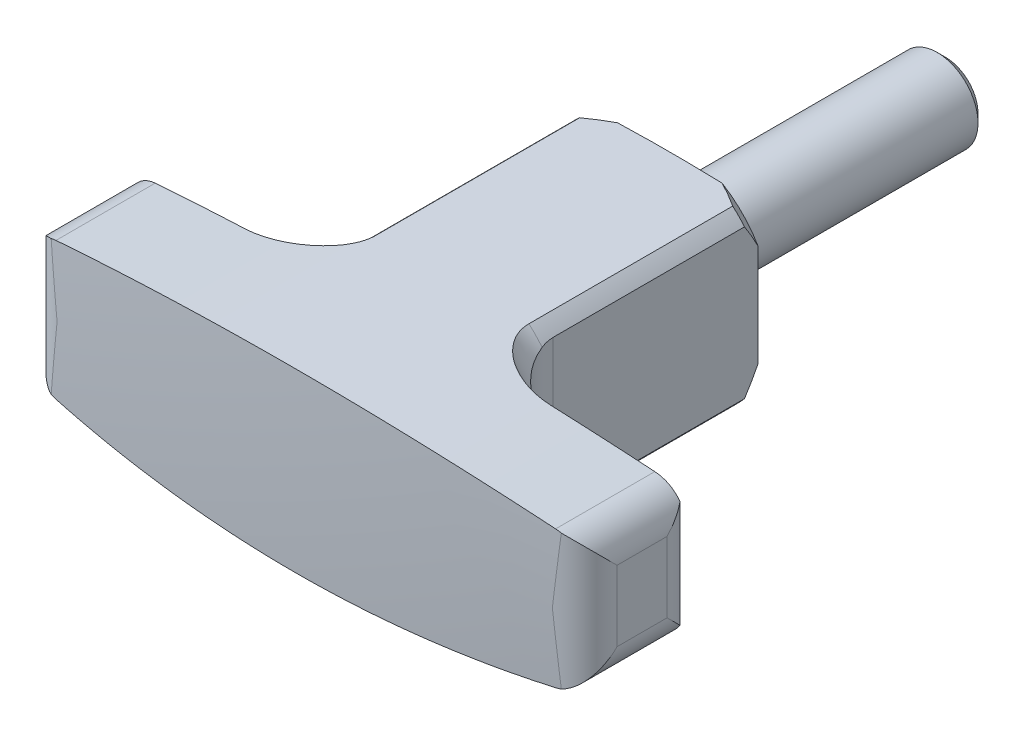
ISO-10303-21;
HEADER;
FILE_DESCRIPTION(('STEP AP214'),'2;1');
FILE_NAME('part.step','',(''),(''),'','','');
FILE_SCHEMA(('AUTOMOTIVE_DESIGN { 1 0 10303 214 1 1 1 1 }'));
ENDSEC;
DATA;
#1=APPLICATION_CONTEXT('core data for automotive mechanical design processes');
#2=APPLICATION_PROTOCOL_DEFINITION('international standard','automotive_design',2000,#1);
#3=PRODUCT_CONTEXT('',#1,'mechanical');
#4=PRODUCT('Part','Part','',(#3));
#5=PRODUCT_RELATED_PRODUCT_CATEGORY('part','',(#4));
#6=PRODUCT_DEFINITION_FORMATION('','',#4);
#7=PRODUCT_DEFINITION_CONTEXT('part definition',#1,'design');
#8=PRODUCT_DEFINITION('design','',#6,#7);
#9=PRODUCT_DEFINITION_SHAPE('','',#8);
#10=(LENGTH_UNIT() NAMED_UNIT(*) SI_UNIT(.MILLI.,.METRE.));
#11=(NAMED_UNIT(*) PLANE_ANGLE_UNIT() SI_UNIT($,.RADIAN.));
#12=(NAMED_UNIT(*) SI_UNIT($,.STERADIAN.) SOLID_ANGLE_UNIT());
#13=UNCERTAINTY_MEASURE_WITH_UNIT(LENGTH_MEASURE(1.E-05),#10,'distance_accuracy_value','');
#14=(GEOMETRIC_REPRESENTATION_CONTEXT(3) GLOBAL_UNCERTAINTY_ASSIGNED_CONTEXT((#13)) GLOBAL_UNIT_ASSIGNED_CONTEXT((#10,
#11,#12)) REPRESENTATION_CONTEXT('',''));
#15=CARTESIAN_POINT('',(0.,0.,0.));
#16=DIRECTION('',(0.,0.,1.));
#17=DIRECTION('',(1.,0.,0.));
#18=AXIS2_PLACEMENT_3D('',#15,#16,#17);
#19=CARTESIAN_POINT('',(8.32667268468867E-13,0.,-179.79999999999));
#20=DIRECTION('',(0.,0.,-1.));
#21=DIRECTION('',(1.,0.,0.));
#22=AXIS2_PLACEMENT_3D('',#19,#20,#21);
#23=SPHERICAL_SURFACE('',#22,200.49999999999);
#24=CARTESIAN_POINT('',(-17.9865474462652,-23.5335878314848,18.5000361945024));
#25=CARTESIAN_POINT('',(-18.0116966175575,-23.5153899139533,18.4999147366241));
#26=CARTESIAN_POINT('',(-18.0352712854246,-23.4953050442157,18.5001527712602));
#27=CARTESIAN_POINT('',(-18.0796896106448,-23.4525506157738,18.5011690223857));
#28=CARTESIAN_POINT('',(-18.1005491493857,-23.4298976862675,18.501943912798));
#29=CARTESIAN_POINT('',(-18.1594928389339,-23.3601907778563,18.5047855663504));
#30=CARTESIAN_POINT('',(-18.1946729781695,-23.3107694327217,18.5073764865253));
#31=CARTESIAN_POINT('',(-18.2762265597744,-23.1833964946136,18.514820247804));
#32=CARTESIAN_POINT('',(-18.3194155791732,-23.1035229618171,18.5201565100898));
#33=CARTESIAN_POINT('',(-18.3989527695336,-22.9404988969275,18.5317179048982));
#34=CARTESIAN_POINT('',(-18.4352904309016,-22.8573435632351,18.5379443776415));
#35=CARTESIAN_POINT('',(-18.5039310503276,-22.6874317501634,18.5510614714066));
#36=CARTESIAN_POINT('',(-18.5361342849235,-22.6006363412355,18.55796321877));
#37=CARTESIAN_POINT('',(-18.5968984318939,-22.4259220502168,18.5721048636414));
#38=CARTESIAN_POINT('',(-18.6254628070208,-22.3380043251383,18.5793444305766));
#39=CARTESIAN_POINT('',(-18.7062140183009,-22.075677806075,18.6011727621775));
#40=CARTESIAN_POINT('',(-18.7544429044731,-21.9000826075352,18.6160794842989));
#41=CARTESIAN_POINT('',(-18.8438372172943,-21.5471150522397,18.6462522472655));
#42=CARTESIAN_POINT('',(-18.8849996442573,-21.3697419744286,18.6615184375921));
#43=CARTESIAN_POINT('',(-18.9621500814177,-21.0136001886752,18.692188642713));
#44=CARTESIAN_POINT('',(-18.9981298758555,-20.8348297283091,18.7075928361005));
#45=CARTESIAN_POINT('',(-19.0660109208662,-20.4765553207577,18.7383625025));
#46=CARTESIAN_POINT('',(-19.097912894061,-20.2970515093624,18.7537279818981));
#47=CARTESIAN_POINT('',(-19.1581227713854,-19.9392650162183,18.7841757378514));
#48=CARTESIAN_POINT('',(-19.1864631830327,-19.760987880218,18.7992593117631));
#49=CARTESIAN_POINT('',(-19.2404533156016,-19.4040053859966,18.8292333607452));
#50=CARTESIAN_POINT('',(-19.26610292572,-19.2253000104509,18.8441238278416));
#51=CARTESIAN_POINT('',(-19.3150864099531,-18.8677241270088,18.8736499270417));
#52=CARTESIAN_POINT('',(-19.3384224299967,-18.6888539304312,18.8882857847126));
#53=CARTESIAN_POINT('',(-19.3831087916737,-18.3308476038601,18.9172812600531));
#54=CARTESIAN_POINT('',(-19.4044591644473,-18.1517114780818,18.9316408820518));
#55=CARTESIAN_POINT('',(-19.4673255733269,-17.6015655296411,18.9752458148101));
#56=CARTESIAN_POINT('',(-19.5059953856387,-17.2301895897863,19.0039912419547));
#57=CARTESIAN_POINT('',(-19.577481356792,-16.486757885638,19.0599992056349));
#58=CARTESIAN_POINT('',(-19.6102972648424,-16.114702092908,19.0872616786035));
#59=CARTESIAN_POINT('',(-19.6711449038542,-15.3700359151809,19.1401878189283));
#60=CARTESIAN_POINT('',(-19.6991759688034,-14.9974254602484,19.1658512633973));
#61=CARTESIAN_POINT('',(-19.7512305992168,-14.251810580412,19.2154895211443));
#62=CARTESIAN_POINT('',(-19.7752541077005,-13.8788061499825,19.2394643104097));
#63=CARTESIAN_POINT('',(-19.8422804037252,-12.7586819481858,19.3087944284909));
#64=CARTESIAN_POINT('',(-19.8801889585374,-12.0110912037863,19.3515097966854));
#65=CARTESIAN_POINT('',(-19.9458183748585,-10.5151536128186,19.4295357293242));
#66=CARTESIAN_POINT('',(-19.9735400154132,-9.76680682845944,19.4648468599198));
#67=CARTESIAN_POINT('',(-20.0210375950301,-8.26723128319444,19.527936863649));
#68=CARTESIAN_POINT('',(-20.0407887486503,-7.51600075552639,19.5556921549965));
#69=CARTESIAN_POINT('',(-20.0737067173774,-6.01313428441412,19.6033701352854));
#70=CARTESIAN_POINT('',(-20.0868733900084,-5.26149833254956,19.6232926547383));
#71=CARTESIAN_POINT('',(-20.1075736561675,-3.75827140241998,19.6551978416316));
#72=CARTESIAN_POINT('',(-20.1151094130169,-3.00668051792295,19.6671835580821));
#73=CARTESIAN_POINT('',(-20.1250999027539,-1.50339190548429,19.6831702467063));
#74=CARTESIAN_POINT('',(-20.1275547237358,-0.751694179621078,19.6871713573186));
#75=CARTESIAN_POINT('',(-20.1275519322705,0.416835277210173,19.6871716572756));
#76=CARTESIAN_POINT('',(-20.1267955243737,0.833669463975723,19.6859414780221));
#77=CARTESIAN_POINT('',(-20.1237484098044,1.66733016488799,19.6810229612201));
#78=CARTESIAN_POINT('',(-20.1214576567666,2.08415667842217,19.6773345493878));
#79=CARTESIAN_POINT('',(-20.1122250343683,3.33408259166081,19.6625942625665));
#80=CARTESIAN_POINT('',(-20.1029228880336,4.16712573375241,19.6478673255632));
#81=CARTESIAN_POINT('',(-20.0772012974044,5.83370047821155,19.6086746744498));
#82=CARTESIAN_POINT('',(-20.0607748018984,6.66723174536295,19.5841993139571));
#83=CARTESIAN_POINT('',(-20.0193141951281,8.33373872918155,19.5256668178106));
#84=CARTESIAN_POINT('',(-19.9942801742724,9.16671445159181,19.4916097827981));
#85=CARTESIAN_POINT('',(-19.9332835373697,10.831757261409,19.4141628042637));
#86=CARTESIAN_POINT('',(-19.8973221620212,11.6638244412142,19.370773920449));
#87=CARTESIAN_POINT('',(-19.8323732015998,12.9109305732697,19.2989921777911));
#88=CARTESIAN_POINT('',(-19.8088900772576,13.3264523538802,19.2739495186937));
#89=CARTESIAN_POINT('',(-19.75756050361,14.1570890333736,19.2217059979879));
#90=CARTESIAN_POINT('',(-19.7297141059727,14.572203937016,19.1945051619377));
#91=CARTESIAN_POINT('',(-19.6687905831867,15.4018000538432,19.1380480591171));
#92=CARTESIAN_POINT('',(-19.635714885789,15.816281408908,19.1087923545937));
#93=CARTESIAN_POINT('',(-19.5631053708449,16.644580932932,19.0483507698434));
#94=CARTESIAN_POINT('',(-19.5235709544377,17.0583990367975,19.0171647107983));
#95=CARTESIAN_POINT('',(-19.4362575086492,17.8855620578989,18.9530194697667));
#96=CARTESIAN_POINT('',(-19.3884685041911,18.2989057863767,18.9200581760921));
#97=CARTESIAN_POINT('',(-19.3085142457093,18.9177247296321,18.8695610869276));
#98=CARTESIAN_POINT('',(-19.280487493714,19.1237782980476,18.8525545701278));
#99=CARTESIAN_POINT('',(-19.2211308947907,19.5353820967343,18.8182531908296));
#100=CARTESIAN_POINT('',(-19.1898011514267,19.7409323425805,18.8009583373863));
#101=CARTESIAN_POINT('',(-19.1230436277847,20.1518457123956,18.7661251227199));
#102=CARTESIAN_POINT('',(-19.0876065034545,20.3572072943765,18.7485862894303));
#103=CARTESIAN_POINT('',(-19.0116088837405,20.7670542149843,18.7134301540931));
#104=CARTESIAN_POINT('',(-18.9710466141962,20.971539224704,18.6958128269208));
#105=CARTESIAN_POINT('',(-18.8832782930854,21.3786056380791,18.6607532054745));
#106=CARTESIAN_POINT('',(-18.8360888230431,21.5811904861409,18.6433105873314));
#107=CARTESIAN_POINT('',(-18.7580588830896,21.8831713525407,18.6175468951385));
#108=CARTESIAN_POINT('',(-18.7308500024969,21.9834874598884,18.6090280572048));
#109=CARTESIAN_POINT('',(-18.6733851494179,22.1832566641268,18.5922092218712));
#110=CARTESIAN_POINT('',(-18.6431296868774,22.28270990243,18.5839091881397));
#111=CARTESIAN_POINT('',(-18.5905549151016,22.4438389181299,18.5706623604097));
#112=CARTESIAN_POINT('',(-18.5694335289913,22.5058962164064,18.5656096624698));
#113=CARTESIAN_POINT('',(-18.5252490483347,22.6293572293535,18.5556948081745));
#114=CARTESIAN_POINT('',(-18.5021854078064,22.6907607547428,18.5508327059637));
#115=CARTESIAN_POINT('',(-18.4535584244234,22.8128185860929,18.5413619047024));
#116=CARTESIAN_POINT('',(-18.4279875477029,22.873469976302,18.5367540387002));
#117=CARTESIAN_POINT('',(-18.3736757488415,22.9933524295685,18.5279307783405));
#118=CARTESIAN_POINT('',(-18.3449367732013,23.0525843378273,18.5237151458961));
#119=CARTESIAN_POINT('',(-18.2828770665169,23.1692015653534,18.5158564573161));
#120=CARTESIAN_POINT('',(-18.2495247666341,23.2265704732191,18.512217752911));
#121=CARTESIAN_POINT('',(-18.176563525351,23.3368577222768,18.5059704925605));
#122=CARTESIAN_POINT('',(-18.1370119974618,23.3898106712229,18.5033531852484));
#123=CARTESIAN_POINT('',(-18.07630404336,23.4556122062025,18.5011146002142));
#124=CARTESIAN_POINT('',(-18.0595719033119,23.472440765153,18.5006478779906));
#125=CARTESIAN_POINT('',(-18.0243983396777,23.5044446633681,18.5000572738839));
#126=CARTESIAN_POINT('',(-18.0059462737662,23.5196082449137,18.4999356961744));
#127=CARTESIAN_POINT('',(-17.9865474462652,23.5335878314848,18.5000361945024));
#128=B_SPLINE_CURVE_WITH_KNOTS('',3,(#24,#25,#26,#27,#28,#29,#30,#31,#32,#33,#34,#35,#36,#37,
#38,#39,#40,#41,#42,#43,#44,#45,#46,#47,#48,#49,#50,#51,#52,#53,#54,#55,#56,#57,#58,#59,#60,#61,
#62,#63,#64,#65,#66,#67,#68,#69,#70,#71,#72,#73,#74,#75,#76,#77,#78,#79,#80,#81,#82,#83,#84,#85,
#86,#87,#88,#89,#90,#91,#92,#93,#94,#95,#96,#97,#98,#99,#100,#101,#102,#103,#104,#105,#106,#107,
#108,#109,#110,#111,#112,#113,#114,#115,#116,#117,#118,#119,#120,#121,#122,#123,#124,#125,#126,
#127),.UNSPECIFIED.,.F.,.F.,(4,2,2,2,2,2,2,2,2,2,2,2,2,2,2,2,2,2,2,2,2,2,2,2,2,2,2,2,2,2,2,2,2,
2,2,2,2,2,2,2,2,2,2,2,2,2,2,2,2,2,2,4),(0.,0.0927834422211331,0.184997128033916,
0.366599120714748,0.638896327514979,0.911607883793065,1.18999579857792,1.46811678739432,
2.01597590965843,2.56406702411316,3.11301765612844,3.66187087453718,4.20528063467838,
4.74871276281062,5.29163602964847,5.83455078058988,6.95794673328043,8.08139080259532,
9.2049911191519,10.3286074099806,12.5777701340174,14.8267608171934,17.0826921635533,
19.3386723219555,21.5937853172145,23.84885921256,25.0993602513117,26.3498990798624,
28.8494847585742,31.3515500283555,33.8535890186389,36.355344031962,37.6061341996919,
38.8569095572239,40.107344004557,41.3578944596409,42.6099668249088,43.2358813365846,
43.8617762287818,44.4891240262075,45.1166895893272,45.7427120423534,46.0555463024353,
46.3683282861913,46.565547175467,46.762821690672,46.96070829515,47.1584739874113,
47.3576669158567,47.5551135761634,47.6262137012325,47.6977873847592),.UNSPECIFIED.);
#129=CARTESIAN_POINT('',(-20.1044827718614,-3.94437824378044,19.6504992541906));
#130=VERTEX_POINT('',#129);
#131=CARTESIAN_POINT('',(-20.1044827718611,3.9443782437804,19.6504992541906));
#132=VERTEX_POINT('',#131);
#133=EDGE_CURVE('E325',#130,#132,#128,.T.);
#134=ORIENTED_EDGE('',*,*,#133,.T.);
#135=CARTESIAN_POINT('',(-20.499999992,2.59467749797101,19.6323635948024));
#136=CARTESIAN_POINT('',(-20.5000124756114,2.6647281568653,19.6314510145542));
#137=CARTESIAN_POINT('',(-20.4970669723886,2.73477940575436,19.630805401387));
#138=CARTESIAN_POINT('',(-20.4853113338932,2.87438757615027,19.6300499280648));
#139=CARTESIAN_POINT('',(-20.4765014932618,2.94394452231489,19.6299400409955));
#140=CARTESIAN_POINT('',(-20.453077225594,3.08202435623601,19.6302576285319));
#141=CARTESIAN_POINT('',(-20.4384671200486,3.15054797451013,19.6306847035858));
#142=CARTESIAN_POINT('',(-20.4035618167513,3.28610548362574,19.6320713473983));
#143=CARTESIAN_POINT('',(-20.3832666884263,3.35313939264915,19.6330309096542));
#144=CARTESIAN_POINT('',(-20.3140202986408,3.55135991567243,19.6367016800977));
#145=CARTESIAN_POINT('',(-20.2566984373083,3.67972157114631,19.6402051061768));
#146=CARTESIAN_POINT('',(-20.1214812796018,3.92489208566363,19.6492187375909));
#147=CARTESIAN_POINT('',(-20.0435916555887,4.04170411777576,19.6547283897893));
#148=CARTESIAN_POINT('',(-19.8693613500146,4.26073441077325,19.6676020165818));
#149=CARTESIAN_POINT('',(-19.7730029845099,4.36293851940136,19.6749677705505));
#150=CARTESIAN_POINT('',(-19.5645718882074,4.5497983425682,19.6913444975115));
#151=CARTESIAN_POINT('',(-19.4524898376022,4.63444357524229,19.7003564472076));
#152=CARTESIAN_POINT('',(-19.2153797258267,4.78407867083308,19.7198025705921));
#153=CARTESIAN_POINT('',(-19.0902996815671,4.84898518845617,19.7302425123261));
#154=CARTESIAN_POINT('',(-18.8312497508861,4.95679060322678,19.7522086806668));
#155=CARTESIAN_POINT('',(-18.6972976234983,4.99973204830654,19.7637327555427));
#156=CARTESIAN_POINT('',(-18.5322608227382,5.03773870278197,19.7781234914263));
#157=CARTESIAN_POINT('',(-18.5034702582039,5.0438337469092,19.7806408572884));
#158=CARTESIAN_POINT('',(-18.4457316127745,5.05499609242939,19.7857030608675));
#159=CARTESIAN_POINT('',(-18.4167837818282,5.06006470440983,19.7882478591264));
#160=CARTESIAN_POINT('',(-18.3877477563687,5.06462478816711,19.790807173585));
#161=B_SPLINE_CURVE_WITH_KNOTS('',3,(#135,#136,#137,#138,#139,#140,#141,#142,#143,#144,#145,
#146,#147,#148,#149,#150,#151,#152,#153,#154,#155,#156,#157,#158,#159,#160),.UNSPECIFIED.,.F.,
.F.,(4,2,2,2,2,2,2,2,2,2,2,2,4),(0.,0.210101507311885,0.420192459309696,0.630127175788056,
0.840059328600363,1.25975461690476,1.67933427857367,2.09931771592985,2.51955114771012,
2.94153510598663,3.36269852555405,3.45129827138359,3.53978416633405),.UNSPECIFIED.);
#162=CARTESIAN_POINT('',(-18.3879477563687,5.06459338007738,19.7907895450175));
#163=VERTEX_POINT('',#162);
#164=EDGE_CURVE('E369',#132,#163,#161,.T.);
#165=ORIENTED_EDGE('',*,*,#164,.T.);
#166=CARTESIAN_POINT('',(-18.3881477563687,5.06456196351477,19.7907719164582));
#167=CARTESIAN_POINT('',(-17.7981880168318,5.15723578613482,19.8427731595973));
#168=CARTESIAN_POINT('',(-17.2073117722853,5.24548204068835,19.8922700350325));
#169=CARTESIAN_POINT('',(-16.0240773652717,5.41305274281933,19.9862280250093));
#170=CARTESIAN_POINT('',(-15.4317196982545,5.49237984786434,20.0306906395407));
#171=CARTESIAN_POINT('',(-14.2455207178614,5.6421010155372,20.1145841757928));
#172=CARTESIAN_POINT('',(-13.6516794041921,5.71249507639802,20.154015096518));
#173=CARTESIAN_POINT('',(-12.4625118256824,5.84433490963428,20.2278453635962));
#174=CARTESIAN_POINT('',(-11.8671851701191,5.90577800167,20.2622432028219));
#175=CARTESIAN_POINT('',(-11.2712926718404,5.96271694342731,20.2941127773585));
#176=B_SPLINE_CURVE_WITH_KNOTS('',3,(#166,#167,#168,#169,#170,#171,#172,#173,#174,#175),
.UNSPECIFIED.,.F.,.F.,(4,2,2,2,4),(0.,1.79833999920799,3.59614275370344,5.39394586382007,
7.19228621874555),.UNSPECIFIED.);
#177=CARTESIAN_POINT('',(-11.2750315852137,5.96235961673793,20.2939127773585));
#178=VERTEX_POINT('',#177);
#179=EDGE_CURVE('E624',#163,#178,#176,.T.);
#180=ORIENTED_EDGE('',*,*,#179,.T.);
#181=CARTESIAN_POINT('',(0.,0.,20.2939127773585));
#182=DIRECTION('',(0.,0.,-1.));
#183=DIRECTION('',(0.,1.,0.));
#184=AXIS2_PLACEMENT_3D('',#181,#182,#183);
#185=CIRCLE('',#184,12.7544529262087);
#186=CARTESIAN_POINT('',(-11.2750315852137,-5.96235961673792,20.2939127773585));
#187=VERTEX_POINT('',#186);
#188=EDGE_CURVE('E522',#187,#178,#185,.T.);
#189=ORIENTED_EDGE('',*,*,#188,.F.);
#190=CARTESIAN_POINT('',(-11.2712926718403,-5.96271694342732,20.2941127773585));
#191=CARTESIAN_POINT('',(-11.867185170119,-5.90577800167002,20.262243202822));
#192=CARTESIAN_POINT('',(-12.4625118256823,-5.8443349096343,20.2278453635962));
#193=CARTESIAN_POINT('',(-13.651679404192,-5.71249507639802,20.154015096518));
#194=CARTESIAN_POINT('',(-14.2455207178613,-5.64210101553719,20.1145841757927));
#195=CARTESIAN_POINT('',(-15.4317196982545,-5.49237984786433,20.0306906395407));
#196=CARTESIAN_POINT('',(-16.0240773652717,-5.41305274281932,19.9862280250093));
#197=CARTESIAN_POINT('',(-17.2073117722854,-5.24548204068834,19.8922700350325));
#198=CARTESIAN_POINT('',(-17.7981880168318,-5.15723578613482,19.8427731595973));
#199=CARTESIAN_POINT('',(-18.3881477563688,-5.06456196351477,19.7907719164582));
#200=B_SPLINE_CURVE_WITH_KNOTS('',3,(#190,#191,#192,#193,#194,#195,#196,#197,#198,#199),
.UNSPECIFIED.,.F.,.F.,(4,2,2,2,4),(0.,1.79834035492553,3.5961434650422,5.3939462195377,
7.19228621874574),.UNSPECIFIED.);
#201=CARTESIAN_POINT('',(-18.3879477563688,-5.06459338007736,19.7907895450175));
#202=VERTEX_POINT('',#201);
#203=EDGE_CURVE('E232',#187,#202,#200,.T.);
#204=ORIENTED_EDGE('',*,*,#203,.T.);
#205=CARTESIAN_POINT('',(-18.3877477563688,-5.0646247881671,19.790807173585));
#206=CARTESIAN_POINT('',(-18.4572668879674,-5.05371703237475,19.7846794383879));
#207=CARTESIAN_POINT('',(-18.5263271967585,-5.0398604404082,19.7786311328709));
#208=CARTESIAN_POINT('',(-18.6630489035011,-5.00637316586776,19.7667352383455));
#209=CARTESIAN_POINT('',(-18.7307103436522,-4.98674265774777,19.7608876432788));
#210=CARTESIAN_POINT('',(-18.8641240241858,-4.9418416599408,19.7494375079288));
#211=CARTESIAN_POINT('',(-18.9298772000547,-4.91657398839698,19.7438348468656));
#212=CARTESIAN_POINT('',(-19.0590214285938,-4.86058574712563,19.7329130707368));
#213=CARTESIAN_POINT('',(-19.1224125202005,-4.82986526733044,19.7275939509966));
#214=CARTESIAN_POINT('',(-19.3084354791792,-4.72977438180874,19.7121135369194));
#215=CARTESIAN_POINT('',(-19.4269577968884,-4.65246077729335,19.7024256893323));
#216=CARTESIAN_POINT('',(-19.6492599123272,-4.47897971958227,19.6846242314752));
#217=CARTESIAN_POINT('',(-19.7530448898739,-4.38281891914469,19.676510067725));
#218=CARTESIAN_POINT('',(-19.9427277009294,-4.17461557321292,19.662101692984));
#219=CARTESIAN_POINT('',(-20.0286774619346,-4.0626207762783,19.6558021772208));
#220=CARTESIAN_POINT('',(-20.1806091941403,-3.82563488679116,19.6451738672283));
#221=CARTESIAN_POINT('',(-20.2465793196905,-3.7006361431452,19.6408462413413));
#222=CARTESIAN_POINT('',(-20.3563981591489,-3.44170647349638,19.6343036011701));
#223=CARTESIAN_POINT('',(-20.4003142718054,-3.30780419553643,19.632082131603));
#224=CARTESIAN_POINT('',(-20.464994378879,-3.0346745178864,19.6297981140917));
#225=CARTESIAN_POINT('',(-20.4858060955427,-2.89545871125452,19.6297311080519));
#226=CARTESIAN_POINT('',(-20.4965512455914,-2.72889181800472,19.6309285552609));
#227=CARTESIAN_POINT('',(-20.4978470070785,-2.70204730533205,19.6311608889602));
#228=CARTESIAN_POINT('',(-20.4995712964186,-2.64836355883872,19.631703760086));
#229=CARTESIAN_POINT('',(-20.5000008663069,-2.62152435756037,19.6320142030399));
#230=CARTESIAN_POINT('',(-20.499999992,-2.594677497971,19.6323635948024));
#231=B_SPLINE_CURVE_WITH_KNOTS('',3,(#205,#206,#207,#208,#209,#210,#211,#212,#213,#214,#215,
#216,#217,#218,#219,#220,#221,#222,#223,#224,#225,#226,#227,#228,#229,#230),.UNSPECIFIED.,.F.,
.F.,(4,2,2,2,2,2,2,2,2,2,2,2,4),(0.,0.21183986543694,0.423673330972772,0.635401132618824,
0.847125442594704,1.27044619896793,1.69361779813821,2.11553948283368,2.53771083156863,
2.95858401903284,3.37858626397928,3.45921080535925,3.53973829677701),.UNSPECIFIED.);
#232=EDGE_CURVE('E361',#202,#130,#231,.T.);
#233=ORIENTED_EDGE('',*,*,#232,.T.);
#234=EDGE_LOOP('',(#134,#165,#180,#189,#204,#233));
#235=FACE_BOUND('',#234,.T.);
#236=ADVANCED_FACE('F14',(#235),#23,.F.);
#237=CARTESIAN_POINT('',(0.,0.,16.3020142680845));
#238=DIRECTION('',(0.,0.,-1.));
#239=DIRECTION('',(0.,1.,0.));
#240=AXIS2_PLACEMENT_3D('',#237,#238,#239);
#241=TOROIDAL_SURFACE('',#240,12.5,4.);
#242=ORIENTED_EDGE('',*,*,#188,.T.);
#243=CARTESIAN_POINT('',(-12.7546529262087,5.81155267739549,20.0034978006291));
#244=CARTESIAN_POINT('',(-12.5937210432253,5.82898143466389,20.0605404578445));
#245=CARTESIAN_POINT('',(-12.4299017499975,5.84637934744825,20.1091684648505));
#246=CARTESIAN_POINT('',(-12.0983814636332,5.88087378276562,20.189952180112));
#247=CARTESIAN_POINT('',(-11.930684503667,5.89797058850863,20.222124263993));
#248=CARTESIAN_POINT('',(-11.594129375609,5.93154351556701,20.2702999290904));
#249=CARTESIAN_POINT('',(-11.4252870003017,5.94802308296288,20.2864126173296));
#250=CARTESIAN_POINT('',(-11.086795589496,5.98032346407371,20.3033806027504));
#251=CARTESIAN_POINT('',(-10.9171464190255,5.99614416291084,20.3042332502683));
#252=CARTESIAN_POINT('',(-10.4456661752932,6.03908273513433,20.2861115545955));
#253=CARTESIAN_POINT('',(-10.1442456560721,6.0653570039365,20.2511059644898));
#254=CARTESIAN_POINT('',(-9.54917347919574,6.11498267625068,20.1374556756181));
#255=CARTESIAN_POINT('',(-9.25553902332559,6.13832797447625,20.0587216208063));
#256=CARTESIAN_POINT('',(-8.64048567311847,6.18501063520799,19.8459329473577));
#257=CARTESIAN_POINT('',(-8.32117226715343,6.20786067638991,19.7055346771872));
#258=CARTESIAN_POINT('',(-7.86310224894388,6.23892209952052,19.4569657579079));
#259=CARTESIAN_POINT('',(-7.71386910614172,6.2487418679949,19.3677602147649));
#260=CARTESIAN_POINT('',(-7.42365110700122,6.26731636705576,19.1766875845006));
#261=CARTESIAN_POINT('',(-7.28266278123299,6.27607154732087,19.074825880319));
#262=CARTESIAN_POINT('',(-7.05459005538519,6.28985247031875,18.8932509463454));
#263=CARTESIAN_POINT('',(-6.96477486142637,6.29517090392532,18.8169767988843));
#264=CARTESIAN_POINT('',(-6.79050920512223,6.30530282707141,18.6585018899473));
#265=CARTESIAN_POINT('',(-6.70605975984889,6.31011622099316,18.576300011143));
#266=CARTESIAN_POINT('',(-6.46225558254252,6.32376671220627,18.3208231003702));
#267=CARTESIAN_POINT('',(-6.31204661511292,6.33183787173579,18.1383662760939));
#268=CARTESIAN_POINT('',(-6.08298902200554,6.34380055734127,17.8021378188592));
#269=CARTESIAN_POINT('',(-5.99584100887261,6.34823185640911,17.6540460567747));
#270=CARTESIAN_POINT('',(-5.846134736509,6.35572182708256,17.3461812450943));
#271=CARTESIAN_POINT('',(-5.78348732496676,6.35878548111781,17.1864531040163));
#272=CARTESIAN_POINT('',(-5.7023842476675,6.36271621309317,16.9057105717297));
#273=CARTESIAN_POINT('',(-5.6763834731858,6.36396254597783,16.7868896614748));
#274=CARTESIAN_POINT('',(-5.65009245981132,6.36521946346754,16.6064658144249));
#275=CARTESIAN_POINT('',(-5.64344646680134,6.36553636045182,16.5457543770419));
#276=CARTESIAN_POINT('',(-5.6345593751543,6.36595967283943,16.423973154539));
#277=CARTESIAN_POINT('',(-5.6323209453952,6.36606596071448,16.3629031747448));
#278=CARTESIAN_POINT('',(-5.63233617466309,6.36606544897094,16.3018142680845));
#279=B_SPLINE_CURVE_WITH_KNOTS('',3,(#243,#244,#245,#246,#247,#248,#249,#250,#251,#252,#253,
#254,#255,#256,#257,#258,#259,#260,#261,#262,#263,#264,#265,#266,#267,#268,#269,#270,#271,#272,
#273,#274,#275,#276,#277,#278),.UNSPECIFIED.,.F.,.F.,(4,2,2,2,2,2,2,2,2,2,2,2,2,2,2,2,2,4),(0.,
0.514524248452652,1.02853548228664,1.53903023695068,2.04961363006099,2.95959691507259,
3.87144656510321,4.91488544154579,5.43680413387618,5.9585015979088,6.31209892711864,
6.66576308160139,7.3715866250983,7.88559272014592,8.39771065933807,8.7614347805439,
8.9445135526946,9.12770314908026),.UNSPECIFIED.);
#280=CARTESIAN_POINT('',(-5.63233616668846,6.36606544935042,16.3020142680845));
#281=VERTEX_POINT('',#280);
#282=EDGE_CURVE('E616',#178,#281,#279,.T.);
#283=ORIENTED_EDGE('',*,*,#282,.T.);
#284=CARTESIAN_POINT('',(0.,0.,16.3020142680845));
#285=DIRECTION('',(0.,0.,-1.));
#286=DIRECTION('',(0.,1.,0.));
#287=AXIS2_PLACEMENT_3D('',#284,#285,#286);
#288=CIRCLE('',#287,8.5);
#289=CARTESIAN_POINT('',(-6.60608584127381,5.3487970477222,16.3020142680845));
#290=VERTEX_POINT('',#289);
#291=EDGE_CURVE('E512',#290,#281,#288,.T.);
#292=ORIENTED_EDGE('',*,*,#291,.F.);
#293=CARTESIAN_POINT('',(-6.60603884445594,-5.34885509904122,16.3018142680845));
#294=CARTESIAN_POINT('',(-6.63234425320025,-5.31628981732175,16.4139105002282));
#295=CARTESIAN_POINT('',(-6.66361167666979,-5.28472554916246,16.525119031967));
#296=CARTESIAN_POINT('',(-6.73571903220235,-5.22251718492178,16.7446447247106));
#297=CARTESIAN_POINT('',(-6.77655826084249,-5.19187302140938,16.8529620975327));
#298=CARTESIAN_POINT('',(-6.86776416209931,-5.1302140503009,17.0663138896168));
#299=CARTESIAN_POINT('',(-6.91819243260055,-5.09919813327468,17.1713216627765));
#300=CARTESIAN_POINT('',(-7.02779427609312,-5.03566007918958,17.376191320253));
#301=CARTESIAN_POINT('',(-7.08696755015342,-5.00313799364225,17.4760533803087));
#302=CARTESIAN_POINT('',(-7.2135168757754,-4.93490683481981,17.6699893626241));
#303=CARTESIAN_POINT('',(-7.28092849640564,-4.89918413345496,17.7640353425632));
#304=CARTESIAN_POINT('',(-7.42259519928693,-4.82293215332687,17.9447827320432));
#305=CARTESIAN_POINT('',(-7.49685105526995,-4.7824023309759,18.0314833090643));
#306=CARTESIAN_POINT('',(-7.65017758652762,-4.69494862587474,18.1960077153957));
#307=CARTESIAN_POINT('',(-7.72921789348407,-4.6480631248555,18.2738800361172));
#308=CARTESIAN_POINT('',(-7.89042962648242,-4.54599208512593,18.4203783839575));
#309=CARTESIAN_POINT('',(-7.97259930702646,-4.49081112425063,18.4890094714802));
#310=CARTESIAN_POINT('',(-8.11468444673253,-4.38747411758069,18.5987481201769));
#311=CARTESIAN_POINT('',(-8.17445722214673,-4.341608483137,18.6422126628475));
#312=CARTESIAN_POINT('',(-8.29331248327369,-4.24458306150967,18.723924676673));
#313=CARTESIAN_POINT('',(-8.35239482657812,-4.19342220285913,18.7621710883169));
#314=CARTESIAN_POINT('',(-8.46884974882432,-4.08579585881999,18.8335074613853));
#315=CARTESIAN_POINT('',(-8.52622185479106,-4.02932892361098,18.866596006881));
#316=CARTESIAN_POINT('',(-8.63832610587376,-3.91136989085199,18.9278401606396));
#317=CARTESIAN_POINT('',(-8.69305903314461,-3.84987929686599,18.9559972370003));
#318=CARTESIAN_POINT('',(-8.79895074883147,-3.72261957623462,19.007658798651));
#319=CARTESIAN_POINT('',(-8.85012547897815,-3.65687247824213,19.0311850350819));
#320=CARTESIAN_POINT('',(-8.94873389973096,-3.52140088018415,19.0742399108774));
#321=CARTESIAN_POINT('',(-8.99616760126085,-3.45167639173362,19.0937685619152));
#322=CARTESIAN_POINT('',(-9.08709744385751,-3.30878297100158,19.1293725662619));
#323=CARTESIAN_POINT('',(-9.13059009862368,-3.23561107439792,19.1454448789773));
#324=CARTESIAN_POINT('',(-9.21353751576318,-3.08643437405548,19.1746368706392));
#325=CARTESIAN_POINT('',(-9.25299106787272,-3.01042873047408,19.187755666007));
#326=CARTESIAN_POINT('',(-9.35418167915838,-2.80196740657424,19.2198629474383));
#327=CARTESIAN_POINT('',(-9.41214084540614,-2.66730636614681,19.2365152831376));
#328=CARTESIAN_POINT('',(-9.51719256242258,-2.39328052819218,19.2646624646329));
#329=CARTESIAN_POINT('',(-9.56427791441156,-2.25391268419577,19.2761538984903));
#330=CARTESIAN_POINT('',(-9.64854626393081,-1.97149556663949,19.2954682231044));
#331=CARTESIAN_POINT('',(-9.68569638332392,-1.82843574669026,19.3032789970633));
#332=CARTESIAN_POINT('',(-9.7506587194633,-1.54008196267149,19.3162231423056));
#333=CARTESIAN_POINT('',(-9.77846811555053,-1.39478733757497,19.3213557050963));
#334=CARTESIAN_POINT('',(-9.83680515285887,-1.03138247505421,19.3317030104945));
#335=CARTESIAN_POINT('',(-9.86202367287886,-0.812375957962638,19.3357329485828));
#336=CARTESIAN_POINT('',(-9.894328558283,-0.372915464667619,19.3408113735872));
#337=CARTESIAN_POINT('',(-9.90140388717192,-0.152460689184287,19.3418580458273));
#338=CARTESIAN_POINT('',(-9.89772961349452,0.28806351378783,19.3413001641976));
#339=CARTESIAN_POINT('',(-9.88699891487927,0.508133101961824,19.3396984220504));
#340=CARTESIAN_POINT('',(-9.84724952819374,0.946490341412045,19.3333357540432));
#341=CARTESIAN_POINT('',(-9.81824311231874,1.16477908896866,19.3285769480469));
#342=CARTESIAN_POINT('',(-9.756285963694,1.51003112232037,19.3172209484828));
#343=CARTESIAN_POINT('',(-9.72968224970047,1.63820196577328,19.3121471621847));
#344=CARTESIAN_POINT('',(-9.66904865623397,1.89265725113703,19.2997626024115));
#345=CARTESIAN_POINT('',(-9.63502065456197,2.01894216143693,19.2924523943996));
#346=CARTESIAN_POINT('',(-9.55905178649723,2.26871659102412,19.2748482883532));
#347=CARTESIAN_POINT('',(-9.51712239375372,2.3922098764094,19.264558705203));
#348=CARTESIAN_POINT('',(-9.42472951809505,2.63556207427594,19.2399627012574));
#349=CARTESIAN_POINT('',(-9.37426853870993,2.75542204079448,19.2256574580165));
#350=CARTESIAN_POINT('',(-9.27848200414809,2.95989638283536,19.1960620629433));
#351=CARTESIAN_POINT('',(-9.23518354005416,3.04563447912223,19.1819754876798));
#352=CARTESIAN_POINT('',(-9.14351367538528,3.2136472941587,19.1501839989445));
#353=CARTESIAN_POINT('',(-9.09514392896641,3.29592313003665,19.1324802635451));
#354=CARTESIAN_POINT('',(-8.99348098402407,3.45610198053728,19.092757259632));
#355=CARTESIAN_POINT('',(-8.94019633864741,3.53401222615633,19.0707454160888));
#356=CARTESIAN_POINT('',(-8.82897915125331,3.68476968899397,19.0216472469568));
#357=CARTESIAN_POINT('',(-8.77104682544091,3.75761714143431,18.9945611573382));
#358=CARTESIAN_POINT('',(-8.6506529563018,3.89814123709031,18.9343623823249));
#359=CARTESIAN_POINT('',(-8.58815369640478,3.96576234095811,18.9011950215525));
#360=CARTESIAN_POINT('',(-8.46019927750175,4.09448135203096,18.8285024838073));
#361=CARTESIAN_POINT('',(-8.39474415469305,4.15557933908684,18.7889773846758));
#362=CARTESIAN_POINT('',(-8.26220214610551,4.27107264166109,18.7032977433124));
#363=CARTESIAN_POINT('',(-8.19511431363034,4.32546395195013,18.6571392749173));
#364=CARTESIAN_POINT('',(-8.0608246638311,4.42771023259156,18.5582372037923));
#365=CARTESIAN_POINT('',(-7.99362284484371,4.47556510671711,18.5054935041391));
#366=CARTESIAN_POINT('',(-7.86838774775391,4.56002110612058,18.4002874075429));
#367=CARTESIAN_POINT('',(-7.81020779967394,4.59728384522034,18.3485253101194));
#368=CARTESIAN_POINT('',(-7.6957105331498,4.66775657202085,18.2403488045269));
#369=CARTESIAN_POINT('',(-7.63939391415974,4.7009650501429,18.1839326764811));
#370=CARTESIAN_POINT('',(-7.52935779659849,4.7639721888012,18.0667790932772));
#371=CARTESIAN_POINT('',(-7.4756395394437,4.79376922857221,18.0060396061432));
#372=CARTESIAN_POINT('',(-7.37142714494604,4.85060992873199,17.8806294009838));
#373=CARTESIAN_POINT('',(-7.3209334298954,4.87765322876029,17.8159581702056));
#374=CARTESIAN_POINT('',(-7.21423333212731,4.93468160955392,17.6701874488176));
#375=CARTESIAN_POINT('',(-7.15881721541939,4.9642206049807,17.588333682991));
#376=CARTESIAN_POINT('',(-7.05393562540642,5.02135197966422,17.4202379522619));
#377=CARTESIAN_POINT('',(-7.0044712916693,5.04894398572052,17.3339951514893));
#378=CARTESIAN_POINT('',(-6.91203456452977,5.10309331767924,17.1578854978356));
#379=CARTESIAN_POINT('',(-6.86905690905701,5.12965146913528,17.0680216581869));
#380=CARTESIAN_POINT('',(-6.78992668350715,5.18257878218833,16.8853206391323));
#381=CARTESIAN_POINT('',(-6.75377156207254,5.20894801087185,16.792484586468));
#382=CARTESIAN_POINT('',(-6.69851774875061,5.25407452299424,16.6332954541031));
#383=CARTESIAN_POINT('',(-6.67758546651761,5.27269152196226,16.5675329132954));
#384=CARTESIAN_POINT('',(-6.63920163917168,5.31037661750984,16.4352236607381));
#385=CARTESIAN_POINT('',(-6.62174575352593,5.32944411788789,16.3686780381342));
#386=CARTESIAN_POINT('',(-6.60603884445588,5.3488550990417,16.3018142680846));
#387=B_SPLINE_CURVE_WITH_KNOTS('',3,(#293,#294,#295,#296,#297,#298,#299,#300,#301,#302,#303,
#304,#305,#306,#307,#308,#309,#310,#311,#312,#313,#314,#315,#316,#317,#318,#319,#320,#321,#322,
#323,#324,#325,#326,#327,#328,#329,#330,#331,#332,#333,#334,#335,#336,#337,#338,#339,#340,#341,
#342,#343,#344,#345,#346,#347,#348,#349,#350,#351,#352,#353,#354,#355,#356,#357,#358,#359,#360,
#361,#362,#363,#364,#365,#366,#367,#368,#369,#370,#371,#372,#373,#374,#375,#376,#377,#378,#379,
#380,#381,#382,#383,#384,#385,#386),.UNSPECIFIED.,.F.,.F.,(4,2,2,2,2,2,2,2,2,2,2,2,2,2,2,2,2,2,
2,2,2,2,2,2,2,2,2,2,2,2,2,2,2,2,2,2,2,2,2,2,2,2,2,2,2,2,4),(0.,0.358848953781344,
0.717671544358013,1.0788821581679,1.44008042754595,1.80289725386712,2.16575514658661,
2.52651201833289,2.8870705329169,3.14771862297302,3.40841955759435,3.66919193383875,
3.92988654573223,4.18932581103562,4.44876431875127,4.70843013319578,4.96817352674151,
5.41008442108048,5.85228703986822,6.29593539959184,6.73971760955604,7.40030131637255,
8.06128676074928,8.72157091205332,9.38141215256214,9.77421510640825,10.1669188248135,
10.5590566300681,10.9510795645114,11.2420892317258,11.5330042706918,11.8234222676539,
12.1138267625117,12.4069831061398,12.7001358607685,12.9934628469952,13.2867941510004,
13.5455343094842,13.8043705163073,14.0633291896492,14.3223217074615,14.6315240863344,
14.9407855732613,15.2497948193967,15.558688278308,15.7730447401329,15.9871318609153),.UNSPECIFIED.);
#388=CARTESIAN_POINT('',(-6.60608584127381,-5.3487970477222,16.3020142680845));
#389=VERTEX_POINT('',#388);
#390=EDGE_CURVE('E488',#389,#290,#387,.T.);
#391=ORIENTED_EDGE('',*,*,#390,.F.);
#392=CARTESIAN_POINT('',(-5.63233616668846,-6.36606544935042,16.3020142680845));
#393=VERTEX_POINT('',#392);
#394=EDGE_CURVE('E515',#393,#389,#288,.T.);
#395=ORIENTED_EDGE('',*,*,#394,.F.);
#396=CARTESIAN_POINT('',(-5.6323361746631,-6.36606544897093,16.3018142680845));
#397=CARTESIAN_POINT('',(-5.63227033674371,-6.36606752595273,16.3897208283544));
#398=CARTESIAN_POINT('',(-5.63694168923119,-6.36584628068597,16.4775922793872));
#399=CARTESIAN_POINT('',(-5.65530020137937,-6.36497108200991,16.6522423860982));
#400=CARTESIAN_POINT('',(-5.66897216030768,-6.36431785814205,16.7390226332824));
#401=CARTESIAN_POINT('',(-5.70463551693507,-6.36260411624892,16.909618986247));
#402=CARTESIAN_POINT('',(-5.72651296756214,-6.36154917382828,16.9934592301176));
#403=CARTESIAN_POINT('',(-5.77789095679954,-6.35905217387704,17.1587795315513));
#404=CARTESIAN_POINT('',(-5.80739428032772,-6.35760997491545,17.2402587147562));
#405=CARTESIAN_POINT('',(-5.87300808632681,-6.35437206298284,17.3998460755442));
#406=CARTESIAN_POINT('',(-5.90907267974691,-6.3525787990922,17.4779732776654));
#407=CARTESIAN_POINT('',(-5.98714427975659,-6.34865492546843,17.6311519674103));
#408=CARTESIAN_POINT('',(-6.02915081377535,-6.34652434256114,17.7062036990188));
#409=CARTESIAN_POINT('',(-6.16335144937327,-6.33963620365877,17.9271461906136));
#410=CARTESIAN_POINT('',(-6.2634842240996,-6.33439397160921,18.0682574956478));
#411=CARTESIAN_POINT('',(-6.4593079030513,-6.3238493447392,18.3117731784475));
#412=CARTESIAN_POINT('',(-6.55225852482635,-6.31874575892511,18.416451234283));
#413=CARTESIAN_POINT('',(-6.74690148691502,-6.3078057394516,18.6173948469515));
#414=CARTESIAN_POINT('',(-6.84859841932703,-6.30196892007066,18.7136559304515));
#415=CARTESIAN_POINT('',(-7.05928890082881,-6.28958312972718,18.8979011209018));
#416=CARTESIAN_POINT('',(-7.16828771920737,-6.28303364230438,18.9858791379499));
#417=CARTESIAN_POINT('',(-7.39235930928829,-6.26924092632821,19.1535615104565));
#418=CARTESIAN_POINT('',(-7.50743116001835,-6.26199780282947,19.2332671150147));
#419=CARTESIAN_POINT('',(-7.86908381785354,-6.23867567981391,19.4656177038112));
#420=CARTESIAN_POINT('',(-8.12437944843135,-6.22144970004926,19.6048368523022));
#421=CARTESIAN_POINT('',(-8.65117034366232,-6.18406850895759,19.8472117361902));
#422=CARTESIAN_POINT('',(-8.92266866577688,-6.16391274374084,19.9503606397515));
#423=CARTESIAN_POINT('',(-9.53880079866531,-6.11592859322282,20.137505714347));
#424=CARTESIAN_POINT('',(-9.88628027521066,-6.08739050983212,20.2121528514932));
#425=CARTESIAN_POINT('',(-10.5883834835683,-6.02650239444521,20.2998212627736));
#426=CARTESIAN_POINT('',(-10.9429964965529,-5.99415777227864,20.3129289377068));
#427=CARTESIAN_POINT('',(-11.5437915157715,-5.93662444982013,20.2785882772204));
#428=CARTESIAN_POINT('',(-11.7910371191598,-5.91214703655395,20.2478963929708));
#429=CARTESIAN_POINT('',(-12.27904071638,-5.86233599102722,20.1520044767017));
#430=CARTESIAN_POINT('',(-12.5197869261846,-5.83700096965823,20.0867456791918));
#431=CARTESIAN_POINT('',(-12.7546529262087,-5.81155267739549,20.0034978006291));
#432=B_SPLINE_CURVE_WITH_KNOTS('',3,(#396,#397,#398,#399,#400,#401,#402,#403,#404,#405,#406,
#407,#408,#409,#410,#411,#412,#413,#414,#415,#416,#417,#418,#419,#420,#421,#422,#423,#424,#425,
#426,#427,#428,#429,#430,#431),.UNSPECIFIED.,.F.,.F.,(4,2,2,2,2,2,2,2,2,2,2,2,2,2,2,2,2,4),(0.,
0.263538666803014,0.526633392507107,0.786202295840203,1.04586612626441,1.30377920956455,
1.56167179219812,2.07928860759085,2.4990301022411,2.91899333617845,3.33926296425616,
3.75946904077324,4.63022372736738,5.50114324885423,6.56558835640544,7.62853854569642,
8.37725177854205,9.12724196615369),.UNSPECIFIED.);
#433=EDGE_CURVE('E295',#393,#187,#432,.T.);
#434=ORIENTED_EDGE('',*,*,#433,.T.);
#435=EDGE_LOOP('',(#242,#283,#292,#391,#395,#434));
#436=FACE_BOUND('',#435,.T.);
#437=ADVANCED_FACE('F437',(#436),#241,.F.);
#438=CARTESIAN_POINT('',(0.,0.,0.));
#439=DIRECTION('',(0.,0.,-1.));
#440=DIRECTION('',(0.,1.,0.));
#441=AXIS2_PLACEMENT_3D('',#438,#439,#440);
#442=CYLINDRICAL_SURFACE('',#441,8.5);
#443=ORIENTED_EDGE('',*,*,#291,.T.);
#444=DIRECTION('',(0.,0.,-1.));
#445=VECTOR('',#444,1.);
#446=CARTESIAN_POINT('',(-5.63233616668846,6.36606544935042,0.));
#447=LINE('',#446,#445);
#448=CARTESIAN_POINT('',(-5.63233616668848,6.36606544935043,1.30000000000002));
#449=VERTEX_POINT('',#448);
#450=EDGE_CURVE('E621',#281,#449,#447,.T.);
#451=ORIENTED_EDGE('',*,*,#450,.T.);
#452=CARTESIAN_POINT('',(0.,0.,1.3));
#453=DIRECTION('',(0.,0.,-1.));
#454=DIRECTION('',(0.,1.,0.));
#455=AXIS2_PLACEMENT_3D('',#452,#453,#454);
#456=CIRCLE('',#455,8.5);
#457=CARTESIAN_POINT('',(-6.5,5.47722557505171,1.3));
#458=VERTEX_POINT('',#457);
#459=EDGE_CURVE('E506',#458,#449,#456,.T.);
#460=ORIENTED_EDGE('',*,*,#459,.F.);
#461=DIRECTION('',(0.,0.,-1.));
#462=VECTOR('',#461,1.);
#463=CARTESIAN_POINT('',(-6.5,5.47722557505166,0.));
#464=LINE('',#463,#462);
#465=CARTESIAN_POINT('',(-6.5,5.47722557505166,15.3869008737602));
#466=VERTEX_POINT('',#465);
#467=EDGE_CURVE('E613',#458,#466,#464,.F.);
#468=ORIENTED_EDGE('',*,*,#467,.T.);
#469=CARTESIAN_POINT('',(-6.60608584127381,5.3487970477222,16.3020142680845));
#470=CARTESIAN_POINT('',(-6.58884789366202,5.37007685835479,16.2287323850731));
#471=CARTESIAN_POINT('',(-6.57354050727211,5.38878207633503,16.154239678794));
#472=CARTESIAN_POINT('',(-6.54716325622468,5.42080313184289,16.004008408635));
#473=CARTESIAN_POINT('',(-6.53606068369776,5.43416061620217,15.9282844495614));
#474=CARTESIAN_POINT('',(-6.51818677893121,5.45558792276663,15.7755799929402));
#475=CARTESIAN_POINT('',(-6.51141564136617,5.46365750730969,15.6985994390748));
#476=CARTESIAN_POINT('',(-6.50229572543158,5.47450119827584,15.543384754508));
#477=CARTESIAN_POINT('',(-6.4999828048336,5.47723236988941,15.4651455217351));
#478=CARTESIAN_POINT('',(-6.5,5.47722557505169,15.3869008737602));
#479=B_SPLINE_CURVE_WITH_KNOTS('',3,(#469,#470,#471,#472,#473,#474,#475,#476,#477,#478),
.UNSPECIFIED.,.F.,.F.,(4,2,2,2,4),(0.,0.234633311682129,0.467402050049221,0.700181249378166,
0.934825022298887),.UNSPECIFIED.);
#480=EDGE_CURVE('E452',#290,#466,#479,.T.);
#481=ORIENTED_EDGE('',*,*,#480,.F.);
#482=EDGE_LOOP('',(#443,#451,#460,#468,#481));
#483=FACE_BOUND('',#482,.T.);
#484=ADVANCED_FACE('F441',(#483),#442,.T.);
#485=CARTESIAN_POINT('',(6.60608584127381,-5.3487970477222,16.3020142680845));
#486=VERTEX_POINT('',#485);
#487=CARTESIAN_POINT('',(5.63233616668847,-6.36606544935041,16.3020142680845));
#488=VERTEX_POINT('',#487);
#489=EDGE_CURVE('E517',#486,#488,#288,.T.);
#490=ORIENTED_EDGE('',*,*,#489,.T.);
#491=DIRECTION('',(0.,0.,-1.));
#492=VECTOR('',#491,1.);
#493=CARTESIAN_POINT('',(5.63233616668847,-6.36606544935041,0.));
#494=LINE('',#493,#492);
#495=CARTESIAN_POINT('',(5.6323361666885,-6.36606544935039,1.3));
#496=VERTEX_POINT('',#495);
#497=EDGE_CURVE('E775',#488,#496,#494,.T.);
#498=ORIENTED_EDGE('',*,*,#497,.T.);
#499=CARTESIAN_POINT('',(6.5,-5.47722557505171,1.3));
#500=VERTEX_POINT('',#499);
#501=EDGE_CURVE('E511',#500,#496,#456,.T.);
#502=ORIENTED_EDGE('',*,*,#501,.F.);
#503=DIRECTION('',(0.,0.,-1.));
#504=VECTOR('',#503,1.);
#505=CARTESIAN_POINT('',(6.5,-5.47722557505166,0.));
#506=LINE('',#505,#504);
#507=CARTESIAN_POINT('',(6.5,-5.47722557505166,15.3869008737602));
#508=VERTEX_POINT('',#507);
#509=EDGE_CURVE('E596',#500,#508,#506,.F.);
#510=ORIENTED_EDGE('',*,*,#509,.T.);
#511=CARTESIAN_POINT('',(6.60608584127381,-5.3487970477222,16.3020142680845));
#512=CARTESIAN_POINT('',(6.58884789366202,-5.37007685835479,16.2287323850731));
#513=CARTESIAN_POINT('',(6.57354050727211,-5.38878207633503,16.154239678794));
#514=CARTESIAN_POINT('',(6.54716325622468,-5.42080313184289,16.004008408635));
#515=CARTESIAN_POINT('',(6.53606068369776,-5.43416061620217,15.9282844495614));
#516=CARTESIAN_POINT('',(6.51818677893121,-5.45558792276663,15.7755799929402));
#517=CARTESIAN_POINT('',(6.51141564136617,-5.46365750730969,15.6985994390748));
#518=CARTESIAN_POINT('',(6.50229572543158,-5.47450119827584,15.543384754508));
#519=CARTESIAN_POINT('',(6.4999828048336,-5.47723236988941,15.4651455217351));
#520=CARTESIAN_POINT('',(6.5,-5.47722557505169,15.3869008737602));
#521=B_SPLINE_CURVE_WITH_KNOTS('',3,(#511,#512,#513,#514,#515,#516,#517,#518,#519,#520),
.UNSPECIFIED.,.F.,.F.,(4,2,2,2,4),(0.,0.234633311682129,0.467402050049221,0.700181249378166,
0.934825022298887),.UNSPECIFIED.);
#522=EDGE_CURVE('E447',#486,#508,#521,.T.);
#523=ORIENTED_EDGE('',*,*,#522,.F.);
#524=EDGE_LOOP('',(#490,#498,#502,#510,#523));
#525=FACE_BOUND('',#524,.T.);
#526=ADVANCED_FACE('F773',(#525),#442,.T.);
#527=CARTESIAN_POINT('',(0.,0.,1.3));
#528=DIRECTION('',(0.,0.,1.));
#529=DIRECTION('',(0.,-1.,0.));
#530=AXIS2_PLACEMENT_3D('',#527,#528,#529);
#531=CONICAL_SURFACE('',#530,8.5,0.785398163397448);
#532=ORIENTED_EDGE('',*,*,#501,.T.);
#533=CARTESIAN_POINT('',(5.63265514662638,-6.36605026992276,1.30020000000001));
#534=CARTESIAN_POINT('',(5.48811065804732,-6.37292841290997,1.2095852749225));
#535=CARTESIAN_POINT('',(5.34264113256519,-6.3795862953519,1.1204058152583));
#536=CARTESIAN_POINT('',(5.04975718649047,-6.39244224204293,0.945518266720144));
#537=CARTESIAN_POINT('',(4.90234426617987,-6.39864063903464,0.859807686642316));
#538=CARTESIAN_POINT('',(4.60524580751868,-6.41056930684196,0.692312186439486));
#539=CARTESIAN_POINT('',(4.45555993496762,-6.416299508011,0.610527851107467));
#540=CARTESIAN_POINT('',(4.15362294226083,-6.42727511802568,0.451536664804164));
#541=CARTESIAN_POINT('',(4.00137002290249,-6.43252016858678,0.374333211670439));
#542=CARTESIAN_POINT('',(3.84778602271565,-6.43751060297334,0.29980000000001));
#543=B_SPLINE_CURVE_WITH_KNOTS('',3,(#533,#534,#535,#536,#537,#538,#539,#540,#541,#542),
.UNSPECIFIED.,.F.,.F.,(4,2,2,2,4),(0.,0.512223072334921,1.02407151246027,1.53599595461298,
2.04829548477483),.UNSPECIFIED.);
#544=CARTESIAN_POINT('',(3.84819823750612,-6.43749720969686,0.3));
#545=VERTEX_POINT('',#544);
#546=EDGE_CURVE('E278',#496,#545,#543,.T.);
#547=ORIENTED_EDGE('',*,*,#546,.T.);
#548=CARTESIAN_POINT('',(0.,0.,0.3));
#549=DIRECTION('',(0.,0.,-1.));
#550=DIRECTION('',(0.,1.,0.));
#551=AXIS2_PLACEMENT_3D('',#548,#549,#550);
#552=CIRCLE('',#551,7.5);
#553=CARTESIAN_POINT('',(6.5,-3.74165738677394,0.3));
#554=VERTEX_POINT('',#553);
#555=EDGE_CURVE('E505',#554,#545,#552,.T.);
#556=ORIENTED_EDGE('',*,*,#555,.F.);
#557=CARTESIAN_POINT('',(6.5,17.5529834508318,11.5178318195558));
#558=CARTESIAN_POINT('',(6.5,17.2798867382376,11.2617355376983));
#559=CARTESIAN_POINT('',(6.5,17.0064356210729,11.0060168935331));
#560=CARTESIAN_POINT('',(6.5,16.4587103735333,10.4954593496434));
#561=CARTESIAN_POINT('',(6.5,16.1844362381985,10.2406204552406));
#562=CARTESIAN_POINT('',(6.5,15.3598714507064,9.4772986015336));
#563=CARTESIAN_POINT('',(6.5,14.808177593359,8.97032911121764));
#564=CARTESIAN_POINT('',(6.5,13.6874204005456,7.95057550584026));
#565=CARTESIAN_POINT('',(6.5,13.1182444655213,7.43791473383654));
#566=CARTESIAN_POINT('',(6.5,12.2591921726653,6.67517995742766));
#567=CARTESIAN_POINT('',(6.5,11.9720357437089,6.42204309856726));
#568=CARTESIAN_POINT('',(6.5,11.3955465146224,5.9182616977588));
#569=CARTESIAN_POINT('',(6.5,11.1062137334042,5.66761713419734));
#570=CARTESIAN_POINT('',(6.5,10.5250346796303,5.16947675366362));
#571=CARTESIAN_POINT('',(6.5,10.2331893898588,4.92197979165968));
#572=CARTESIAN_POINT('',(6.5,9.64629744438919,4.43078840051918));
#573=CARTESIAN_POINT('',(6.5,9.35125070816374,4.18709406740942));
#574=CARTESIAN_POINT('',(6.5,8.7567076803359,3.70411847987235));
#575=CARTESIAN_POINT('',(6.5,8.4572045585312,3.46484561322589));
#576=CARTESIAN_POINT('',(6.5,7.8532967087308,2.99258595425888));
#577=CARTESIAN_POINT('',(6.5,7.54889232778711,2.75959871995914));
#578=CARTESIAN_POINT('',(6.5,6.9365432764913,2.30390152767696));
#579=CARTESIAN_POINT('',(6.5,6.62865194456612,2.08112014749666));
#580=CARTESIAN_POINT('',(6.5,6.00501667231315,1.64647160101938));
#581=CARTESIAN_POINT('',(6.5,5.68927006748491,1.43460821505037));
#582=CARTESIAN_POINT('',(6.5,5.20876526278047,1.12863420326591));
#583=CARTESIAN_POINT('',(6.5,5.04768386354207,1.02874697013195));
#584=CARTESIAN_POINT('',(6.5,4.7227826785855,0.833541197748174));
#585=CARTESIAN_POINT('',(6.5,4.55896312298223,0.738222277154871));
#586=CARTESIAN_POINT('',(6.5,4.2283779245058,0.553092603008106));
#587=CARTESIAN_POINT('',(6.5,4.06161437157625,0.463278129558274));
#588=CARTESIAN_POINT('',(6.5,3.7247454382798,0.290183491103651));
#589=CARTESIAN_POINT('',(6.5,3.55464070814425,0.206902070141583));
#590=CARTESIAN_POINT('',(6.5,3.2825396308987,0.0812895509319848));
#591=CARTESIAN_POINT('',(6.5,3.18173659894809,0.0363697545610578));
#592=CARTESIAN_POINT('',(6.5,2.97886393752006,-0.0505086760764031));
#593=CARTESIAN_POINT('',(6.5,2.8767943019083,-0.0924672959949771));
#594=CARTESIAN_POINT('',(6.5,2.56861009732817,-0.213438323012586));
#595=CARTESIAN_POINT('',(6.5,2.36052628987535,-0.287543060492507));
#596=CARTESIAN_POINT('',(6.5,1.94050037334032,-0.419435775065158));
#597=CARTESIAN_POINT('',(6.5,1.72858705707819,-0.477314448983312));
#598=CARTESIAN_POINT('',(6.5,1.3004865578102,-0.574453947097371));
#599=CARTESIAN_POINT('',(6.5,1.08429986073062,-0.613716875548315));
#600=CARTESIAN_POINT('',(6.5,0.64580912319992,-0.671662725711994));
#601=CARTESIAN_POINT('',(6.5,0.423461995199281,-0.690026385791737));
#602=CARTESIAN_POINT('',(6.5,-0.0219296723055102,-0.703774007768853));
#603=CARTESIAN_POINT('',(6.5,-0.244974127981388,-0.699160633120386));
#604=CARTESIAN_POINT('',(6.5,-0.690112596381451,-0.667252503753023));
#605=CARTESIAN_POINT('',(6.5,-0.912201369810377,-0.639886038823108));
#606=CARTESIAN_POINT('',(6.5,-1.35278890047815,-0.564274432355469));
#607=CARTESIAN_POINT('',(6.5,-1.57128648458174,-0.516022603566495));
#608=CARTESIAN_POINT('',(6.5,-2.07174706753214,-0.383335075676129));
#609=CARTESIAN_POINT('',(6.5,-2.35194084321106,-0.292283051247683));
#610=CARTESIAN_POINT('',(6.5,-2.90311684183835,-0.0857473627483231));
#611=CARTESIAN_POINT('',(6.5,-3.17409421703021,0.0297489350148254));
#612=CARTESIAN_POINT('',(6.5,-3.57551511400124,0.217557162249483));
#613=CARTESIAN_POINT('',(6.5,-3.70924232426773,0.283010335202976));
#614=CARTESIAN_POINT('',(6.5,-3.97460818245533,0.418034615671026));
#615=CARTESIAN_POINT('',(6.5,-4.10624680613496,0.487605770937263));
#616=CARTESIAN_POINT('',(6.5,-4.36752518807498,0.630281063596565));
#617=CARTESIAN_POINT('',(6.5,-4.49716565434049,0.703383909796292));
#618=CARTESIAN_POINT('',(6.5,-4.75464155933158,0.852678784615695));
#619=CARTESIAN_POINT('',(6.5,-4.88247708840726,0.928870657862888));
#620=CARTESIAN_POINT('',(6.5,-5.31855100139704,1.19505016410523));
#621=CARTESIAN_POINT('',(6.5,-5.62277157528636,1.39163318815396));
#622=CARTESIAN_POINT('',(6.5,-6.22351553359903,1.79627510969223));
#623=CARTESIAN_POINT('',(6.5,-6.52003661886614,2.0043373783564));
#624=CARTESIAN_POINT('',(6.5,-7.10719220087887,2.42917969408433));
#625=CARTESIAN_POINT('',(6.5,-7.39782055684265,2.64596819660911));
#626=CARTESIAN_POINT('',(6.5,-7.97408834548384,3.08598608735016));
#627=CARTESIAN_POINT('',(6.5,-8.25972831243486,3.30921477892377));
#628=CARTESIAN_POINT('',(6.5,-8.82820784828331,3.76163899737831));
#629=CARTESIAN_POINT('',(6.5,-9.1110304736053,3.9908557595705));
#630=CARTESIAN_POINT('',(6.5,-9.67339557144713,4.45328269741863));
#631=CARTESIAN_POINT('',(6.5,-9.95293796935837,4.68649296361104));
#632=CARTESIAN_POINT('',(6.5,-10.5091619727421,5.15598079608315));
#633=CARTESIAN_POINT('',(6.5,-10.7858450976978,5.39225656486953));
#634=CARTESIAN_POINT('',(6.5,-11.3369653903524,5.8674149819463));
#635=CARTESIAN_POINT('',(6.5,-11.611402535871,6.10629765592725));
#636=CARTESIAN_POINT('',(6.5,-12.3675535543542,6.76970074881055));
#637=CARTESIAN_POINT('',(6.5,-12.8472834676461,7.19648199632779));
#638=CARTESIAN_POINT('',(6.5,-13.8024460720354,8.05496121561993));
#639=CARTESIAN_POINT('',(6.5,-14.277878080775,8.48665994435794));
#640=CARTESIAN_POINT('',(6.5,-15.221414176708,9.35009300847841));
#641=CARTESIAN_POINT('',(6.5,-15.6895462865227,9.78179674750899));
#642=CARTESIAN_POINT('',(6.5,-16.3897521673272,10.4314046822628));
#643=CARTESIAN_POINT('',(6.5,-16.6227994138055,10.6482614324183));
#644=CARTESIAN_POINT('',(6.5,-17.0883114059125,11.0825978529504));
#645=CARTESIAN_POINT('',(6.5,-17.3207761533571,11.3000775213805));
#646=CARTESIAN_POINT('',(6.5,-17.5529834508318,11.5178318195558));
#647=B_SPLINE_CURVE_WITH_KNOTS('',3,(#557,#558,#559,#560,#561,#562,#563,#564,#565,#566,#567,
#568,#569,#570,#571,#572,#573,#574,#575,#576,#577,#578,#579,#580,#581,#582,#583,#584,#585,#586,
#587,#588,#589,#590,#591,#592,#593,#594,#595,#596,#597,#598,#599,#600,#601,#602,#603,#604,#605,
#606,#607,#608,#609,#610,#611,#612,#613,#614,#615,#616,#617,#618,#619,#620,#621,#622,#623,#624,
#625,#626,#627,#628,#629,#630,#631,#632,#633,#634,#635,#636,#637,#638,#639,#640,#641,#642,#643,
#644,#645,#646),.UNSPECIFIED.,.F.,.F.,(4,2,2,2,2,2,2,2,2,2,2,2,2,2,2,2,2,2,2,2,2,2,2,2,2,2,2,2,
2,2,2,2,2,2,2,2,2,2,2,2,2,2,2,2,4),(0.,1.12316673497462,2.24634025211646,4.4940833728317,
6.79207119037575,7.94046502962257,9.08884890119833,10.2368023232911,11.3847846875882,
12.5347582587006,13.6846507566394,14.8246047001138,15.9649507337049,16.5335061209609,
17.1020139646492,17.670133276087,18.2381430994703,18.5691760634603,18.9002106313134,
19.5622998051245,20.220610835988,20.8788474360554,21.5470098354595,22.2150947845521,
22.8852933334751,23.5557066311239,24.4380244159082,25.3207993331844,25.7674015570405,
26.2140089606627,26.6604543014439,27.1068772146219,28.1930871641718,29.2796178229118,
30.3672279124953,31.4547207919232,32.546811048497,33.6389260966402,34.7304273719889,
35.8219394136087,37.7481663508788,39.6746939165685,41.5850819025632,42.5400893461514,
43.4950938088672),.UNSPECIFIED.);
#648=EDGE_CURVE('E585',#554,#500,#647,.T.);
#649=ORIENTED_EDGE('',*,*,#648,.T.);
#650=EDGE_LOOP('',(#532,#547,#556,#649));
#651=FACE_BOUND('',#650,.T.);
#652=ADVANCED_FACE('F570',(#651),#531,.T.);
#653=ORIENTED_EDGE('',*,*,#459,.T.);
#654=CARTESIAN_POINT('',(-5.63265514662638,6.36605026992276,1.30020000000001));
#655=CARTESIAN_POINT('',(-5.48811065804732,6.37292841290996,1.2095852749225));
#656=CARTESIAN_POINT('',(-5.34264113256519,6.3795862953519,1.12040581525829));
#657=CARTESIAN_POINT('',(-5.04975718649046,6.39244224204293,0.945518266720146));
#658=CARTESIAN_POINT('',(-4.90234426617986,6.39864063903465,0.859807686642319));
#659=CARTESIAN_POINT('',(-4.60524580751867,6.41056930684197,0.692312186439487));
#660=CARTESIAN_POINT('',(-4.45555993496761,6.41629950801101,0.610527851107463));
#661=CARTESIAN_POINT('',(-4.15362294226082,6.42727511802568,0.451536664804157));
#662=CARTESIAN_POINT('',(-4.00137002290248,6.43252016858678,0.374333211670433));
#663=CARTESIAN_POINT('',(-3.84778602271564,6.43751060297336,0.299800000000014));
#664=B_SPLINE_CURVE_WITH_KNOTS('',3,(#654,#655,#656,#657,#658,#659,#660,#661,#662,#663),
.UNSPECIFIED.,.F.,.F.,(4,2,2,2,4),(0.,0.512223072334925,1.02407151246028,1.53599595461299,
2.04829548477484),.UNSPECIFIED.);
#665=CARTESIAN_POINT('',(-3.8481982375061,6.43749720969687,0.3));
#666=VERTEX_POINT('',#665);
#667=EDGE_CURVE('E235',#449,#666,#664,.T.);
#668=ORIENTED_EDGE('',*,*,#667,.T.);
#669=CARTESIAN_POINT('',(-6.5,3.74165738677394,0.3));
#670=VERTEX_POINT('',#669);
#671=EDGE_CURVE('E501',#670,#666,#552,.T.);
#672=ORIENTED_EDGE('',*,*,#671,.F.);
#673=CARTESIAN_POINT('',(-6.5,-17.5529834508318,11.5178318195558));
#674=CARTESIAN_POINT('',(-6.5,-17.2798867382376,11.2617355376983));
#675=CARTESIAN_POINT('',(-6.5,-17.0064356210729,11.0060168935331));
#676=CARTESIAN_POINT('',(-6.5,-16.4587103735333,10.4954593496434));
#677=CARTESIAN_POINT('',(-6.5,-16.1844362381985,10.2406204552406));
#678=CARTESIAN_POINT('',(-6.5,-15.3598714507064,9.4772986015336));
#679=CARTESIAN_POINT('',(-6.5,-14.808177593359,8.97032911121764));
#680=CARTESIAN_POINT('',(-6.5,-13.6874204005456,7.95057550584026));
#681=CARTESIAN_POINT('',(-6.5,-13.1182444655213,7.43791473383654));
#682=CARTESIAN_POINT('',(-6.5,-12.2591921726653,6.67517995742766));
#683=CARTESIAN_POINT('',(-6.5,-11.9720357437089,6.42204309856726));
#684=CARTESIAN_POINT('',(-6.5,-11.3955465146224,5.9182616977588));
#685=CARTESIAN_POINT('',(-6.5,-11.1062137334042,5.66761713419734));
#686=CARTESIAN_POINT('',(-6.5,-10.5250346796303,5.16947675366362));
#687=CARTESIAN_POINT('',(-6.5,-10.2331893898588,4.92197979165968));
#688=CARTESIAN_POINT('',(-6.5,-9.64629744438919,4.43078840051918));
#689=CARTESIAN_POINT('',(-6.5,-9.35125070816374,4.18709406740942));
#690=CARTESIAN_POINT('',(-6.5,-8.7567076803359,3.70411847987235));
#691=CARTESIAN_POINT('',(-6.5,-8.4572045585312,3.46484561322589));
#692=CARTESIAN_POINT('',(-6.5,-7.8532967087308,2.99258595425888));
#693=CARTESIAN_POINT('',(-6.5,-7.54889232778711,2.75959871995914));
#694=CARTESIAN_POINT('',(-6.5,-6.9365432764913,2.30390152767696));
#695=CARTESIAN_POINT('',(-6.5,-6.62865194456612,2.08112014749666));
#696=CARTESIAN_POINT('',(-6.5,-6.00501667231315,1.64647160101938));
#697=CARTESIAN_POINT('',(-6.5,-5.68927006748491,1.43460821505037));
#698=CARTESIAN_POINT('',(-6.5,-5.20876526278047,1.12863420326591));
#699=CARTESIAN_POINT('',(-6.5,-5.04768386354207,1.02874697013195));
#700=CARTESIAN_POINT('',(-6.5,-4.7227826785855,0.833541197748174));
#701=CARTESIAN_POINT('',(-6.5,-4.55896312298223,0.738222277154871));
#702=CARTESIAN_POINT('',(-6.5,-4.2283779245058,0.553092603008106));
#703=CARTESIAN_POINT('',(-6.5,-4.06161437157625,0.463278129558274));
#704=CARTESIAN_POINT('',(-6.5,-3.7247454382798,0.290183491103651));
#705=CARTESIAN_POINT('',(-6.5,-3.55464070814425,0.206902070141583));
#706=CARTESIAN_POINT('',(-6.5,-3.2825396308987,0.0812895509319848));
#707=CARTESIAN_POINT('',(-6.5,-3.18173659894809,0.0363697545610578));
#708=CARTESIAN_POINT('',(-6.5,-2.97886393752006,-0.0505086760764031));
#709=CARTESIAN_POINT('',(-6.5,-2.8767943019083,-0.0924672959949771));
#710=CARTESIAN_POINT('',(-6.5,-2.56861009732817,-0.213438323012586));
#711=CARTESIAN_POINT('',(-6.5,-2.36052628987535,-0.287543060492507));
#712=CARTESIAN_POINT('',(-6.5,-1.94050037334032,-0.419435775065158));
#713=CARTESIAN_POINT('',(-6.5,-1.72858705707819,-0.477314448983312));
#714=CARTESIAN_POINT('',(-6.5,-1.3004865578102,-0.574453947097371));
#715=CARTESIAN_POINT('',(-6.5,-1.08429986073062,-0.613716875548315));
#716=CARTESIAN_POINT('',(-6.5,-0.64580912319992,-0.671662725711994));
#717=CARTESIAN_POINT('',(-6.5,-0.423461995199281,-0.690026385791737));
#718=CARTESIAN_POINT('',(-6.5,0.0219296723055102,-0.703774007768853));
#719=CARTESIAN_POINT('',(-6.5,0.244974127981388,-0.699160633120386));
#720=CARTESIAN_POINT('',(-6.5,0.690112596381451,-0.667252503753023));
#721=CARTESIAN_POINT('',(-6.5,0.912201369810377,-0.639886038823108));
#722=CARTESIAN_POINT('',(-6.5,1.35278890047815,-0.564274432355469));
#723=CARTESIAN_POINT('',(-6.5,1.57128648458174,-0.516022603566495));
#724=CARTESIAN_POINT('',(-6.5,2.07174706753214,-0.383335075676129));
#725=CARTESIAN_POINT('',(-6.5,2.35194084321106,-0.292283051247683));
#726=CARTESIAN_POINT('',(-6.5,2.90311684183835,-0.0857473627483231));
#727=CARTESIAN_POINT('',(-6.5,3.17409421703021,0.0297489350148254));
#728=CARTESIAN_POINT('',(-6.5,3.57551511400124,0.217557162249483));
#729=CARTESIAN_POINT('',(-6.5,3.70924232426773,0.283010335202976));
#730=CARTESIAN_POINT('',(-6.5,3.97460818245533,0.418034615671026));
#731=CARTESIAN_POINT('',(-6.5,4.10624680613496,0.487605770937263));
#732=CARTESIAN_POINT('',(-6.5,4.36752518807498,0.630281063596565));
#733=CARTESIAN_POINT('',(-6.5,4.49716565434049,0.703383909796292));
#734=CARTESIAN_POINT('',(-6.5,4.75464155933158,0.852678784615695));
#735=CARTESIAN_POINT('',(-6.5,4.88247708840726,0.928870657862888));
#736=CARTESIAN_POINT('',(-6.5,5.31855100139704,1.19505016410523));
#737=CARTESIAN_POINT('',(-6.5,5.62277157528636,1.39163318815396));
#738=CARTESIAN_POINT('',(-6.5,6.22351553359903,1.79627510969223));
#739=CARTESIAN_POINT('',(-6.5,6.52003661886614,2.0043373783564));
#740=CARTESIAN_POINT('',(-6.5,7.10719220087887,2.42917969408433));
#741=CARTESIAN_POINT('',(-6.5,7.39782055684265,2.64596819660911));
#742=CARTESIAN_POINT('',(-6.5,7.97408834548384,3.08598608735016));
#743=CARTESIAN_POINT('',(-6.5,8.25972831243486,3.30921477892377));
#744=CARTESIAN_POINT('',(-6.5,8.82820784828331,3.76163899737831));
#745=CARTESIAN_POINT('',(-6.5,9.1110304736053,3.9908557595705));
#746=CARTESIAN_POINT('',(-6.5,9.67339557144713,4.45328269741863));
#747=CARTESIAN_POINT('',(-6.5,9.95293796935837,4.68649296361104));
#748=CARTESIAN_POINT('',(-6.5,10.5091619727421,5.15598079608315));
#749=CARTESIAN_POINT('',(-6.5,10.7858450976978,5.39225656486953));
#750=CARTESIAN_POINT('',(-6.5,11.3369653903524,5.8674149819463));
#751=CARTESIAN_POINT('',(-6.5,11.611402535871,6.10629765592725));
#752=CARTESIAN_POINT('',(-6.5,12.3675535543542,6.76970074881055));
#753=CARTESIAN_POINT('',(-6.5,12.8472834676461,7.19648199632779));
#754=CARTESIAN_POINT('',(-6.5,13.8024460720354,8.05496121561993));
#755=CARTESIAN_POINT('',(-6.5,14.277878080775,8.48665994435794));
#756=CARTESIAN_POINT('',(-6.5,15.221414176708,9.35009300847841));
#757=CARTESIAN_POINT('',(-6.5,15.6895462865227,9.78179674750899));
#758=CARTESIAN_POINT('',(-6.5,16.3897521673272,10.4314046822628));
#759=CARTESIAN_POINT('',(-6.5,16.6227994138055,10.6482614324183));
#760=CARTESIAN_POINT('',(-6.5,17.0883114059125,11.0825978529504));
#761=CARTESIAN_POINT('',(-6.5,17.3207761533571,11.3000775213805));
#762=CARTESIAN_POINT('',(-6.5,17.5529834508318,11.5178318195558));
#763=B_SPLINE_CURVE_WITH_KNOTS('',3,(#673,#674,#675,#676,#677,#678,#679,#680,#681,#682,#683,
#684,#685,#686,#687,#688,#689,#690,#691,#692,#693,#694,#695,#696,#697,#698,#699,#700,#701,#702,
#703,#704,#705,#706,#707,#708,#709,#710,#711,#712,#713,#714,#715,#716,#717,#718,#719,#720,#721,
#722,#723,#724,#725,#726,#727,#728,#729,#730,#731,#732,#733,#734,#735,#736,#737,#738,#739,#740,
#741,#742,#743,#744,#745,#746,#747,#748,#749,#750,#751,#752,#753,#754,#755,#756,#757,#758,#759,
#760,#761,#762),.UNSPECIFIED.,.F.,.F.,(4,2,2,2,2,2,2,2,2,2,2,2,2,2,2,2,2,2,2,2,2,2,2,2,2,2,2,2,
2,2,2,2,2,2,2,2,2,2,2,2,2,2,2,2,4),(0.,1.12316673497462,2.24634025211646,4.4940833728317,
6.79207119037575,7.94046502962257,9.08884890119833,10.2368023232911,11.3847846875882,
12.5347582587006,13.6846507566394,14.8246047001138,15.9649507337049,16.5335061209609,
17.1020139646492,17.670133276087,18.2381430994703,18.5691760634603,18.9002106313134,
19.5622998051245,20.220610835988,20.8788474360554,21.5470098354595,22.2150947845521,
22.8852933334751,23.5557066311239,24.4380244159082,25.3207993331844,25.7674015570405,
26.2140089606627,26.6604543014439,27.1068772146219,28.1930871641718,29.2796178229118,
30.3672279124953,31.4547207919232,32.546811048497,33.6389260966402,34.7304273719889,
35.8219394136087,37.7481663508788,39.6746939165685,41.5850819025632,42.5400893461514,
43.4950938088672),.UNSPECIFIED.);
#764=EDGE_CURVE('E575',#670,#458,#763,.T.);
#765=ORIENTED_EDGE('',*,*,#764,.T.);
#766=EDGE_LOOP('',(#653,#668,#672,#765));
#767=FACE_BOUND('',#766,.T.);
#768=ADVANCED_FACE('F565',(#767),#531,.T.);
#769=CARTESIAN_POINT('',(7.5,0.,0.3));
#770=DIRECTION('',(0.,0.,1.));
#771=DIRECTION('',(0.,-1.,0.));
#772=AXIS2_PLACEMENT_3D('',#769,#770,#771);
#773=PLANE('',#772);
#774=CARTESIAN_POINT('',(0.,0.,0.3));
#775=DIRECTION('',(0.,0.,-1.));
#776=DIRECTION('',(0.,1.,0.));
#777=AXIS2_PLACEMENT_3D('',#774,#775,#776);
#778=CIRCLE('',#777,4.);
#779=CARTESIAN_POINT('',(0.,4.,0.3));
#780=VERTEX_POINT('',#779);
#781=EDGE_CURVE('E497',#780,#780,#778,.T.);
#782=ORIENTED_EDGE('',*,*,#781,.F.);
#783=EDGE_LOOP('',(#782));
#784=FACE_BOUND('',#783,.T.);
#785=ORIENTED_EDGE('',*,*,#671,.T.);
#786=CARTESIAN_POINT('',(0.,-111.995,0.299999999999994));
#787=DIRECTION('',(0.,0.,1.));
#788=DIRECTION('',(0.,-1.,0.));
#789=AXIS2_PLACEMENT_3D('',#786,#787,#788);
#790=CIRCLE('',#789,118.495);
#791=CARTESIAN_POINT('',(3.84819823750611,6.43749720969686,0.3));
#792=VERTEX_POINT('',#791);
#793=EDGE_CURVE('E23',#666,#792,#790,.F.);
#794=ORIENTED_EDGE('',*,*,#793,.T.);
#795=CARTESIAN_POINT('',(6.5,3.74165738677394,0.3));
#796=VERTEX_POINT('',#795);
#797=EDGE_CURVE('E500',#792,#796,#552,.T.);
#798=ORIENTED_EDGE('',*,*,#797,.T.);
#799=DIRECTION('',(0.,-1.,0.));
#800=VECTOR('',#799,1.);
#801=CARTESIAN_POINT('',(6.5,0.,0.3));
#802=LINE('',#801,#800);
#803=EDGE_CURVE('E525',#796,#554,#802,.T.);
#804=ORIENTED_EDGE('',*,*,#803,.T.);
#805=ORIENTED_EDGE('',*,*,#555,.T.);
#806=CARTESIAN_POINT('',(0.,111.995,0.299999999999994));
#807=DIRECTION('',(0.,0.,1.));
#808=DIRECTION('',(0.,-1.,0.));
#809=AXIS2_PLACEMENT_3D('',#806,#807,#808);
#810=CIRCLE('',#809,118.495);
#811=CARTESIAN_POINT('',(-3.84819823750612,-6.43749720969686,0.3));
#812=VERTEX_POINT('',#811);
#813=EDGE_CURVE('E733',#545,#812,#810,.F.);
#814=ORIENTED_EDGE('',*,*,#813,.T.);
#815=CARTESIAN_POINT('',(-6.5,-3.74165738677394,0.3));
#816=VERTEX_POINT('',#815);
#817=EDGE_CURVE('E504',#812,#816,#552,.T.);
#818=ORIENTED_EDGE('',*,*,#817,.T.);
#819=DIRECTION('',(0.,1.,0.));
#820=VECTOR('',#819,1.);
#821=CARTESIAN_POINT('',(-6.5,0.,0.3));
#822=LINE('',#821,#820);
#823=EDGE_CURVE('E521',#816,#670,#822,.T.);
#824=ORIENTED_EDGE('',*,*,#823,.T.);
#825=EDGE_LOOP('',(#785,#794,#798,#804,#805,#814,#818,#824));
#826=FACE_BOUND('',#825,.T.);
#827=ADVANCED_FACE('F553',(#784,#826),#773,.F.);
#828=CARTESIAN_POINT('',(-20.5,-41.,24.6801207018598));
#829=DIRECTION('',(1.,0.,0.));
#830=DIRECTION('',(0.,1.,0.));
#831=AXIS2_PLACEMENT_3D('',#828,#829,#830);
#832=PLANE('',#831);
#833=DIRECTION('',(0.,0.,-1.));
#834=VECTOR('',#833,1.);
#835=CARTESIAN_POINT('',(-20.5,2.59487749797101,41.));
#836=LINE('',#835,#834);
#837=CARTESIAN_POINT('',(-20.5,2.59487749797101,24.6801207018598));
#838=VERTEX_POINT('',#837);
#839=CARTESIAN_POINT('',(-20.5,2.59487749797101,21.));
#840=VERTEX_POINT('',#839);
#841=EDGE_CURVE('E666',#838,#840,#836,.T.);
#842=ORIENTED_EDGE('',*,*,#841,.T.);
#843=DIRECTION('',(0.,1.,0.));
#844=VECTOR('',#843,1.);
#845=CARTESIAN_POINT('',(-20.5,-41.,21.));
#846=LINE('',#845,#844);
#847=CARTESIAN_POINT('',(-20.5,-2.594877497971,21.));
#848=VERTEX_POINT('',#847);
#849=EDGE_CURVE('E647',#848,#840,#846,.T.);
#850=ORIENTED_EDGE('',*,*,#849,.F.);
#851=DIRECTION('',(0.,0.,-1.));
#852=VECTOR('',#851,1.);
#853=CARTESIAN_POINT('',(-20.5,-2.594877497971,41.));
#854=LINE('',#853,#852);
#855=CARTESIAN_POINT('',(-20.5,-2.594877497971,24.6801207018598));
#856=VERTEX_POINT('',#855);
#857=EDGE_CURVE('E664',#856,#848,#854,.T.);
#858=ORIENTED_EDGE('',*,*,#857,.F.);
#859=DIRECTION('',(0.,1.,0.));
#860=VECTOR('',#859,1.);
#861=CARTESIAN_POINT('',(-20.5,-41.,24.6801207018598));
#862=LINE('',#861,#860);
#863=EDGE_CURVE('E643',#856,#838,#862,.T.);
#864=ORIENTED_EDGE('',*,*,#863,.T.);
#865=EDGE_LOOP('',(#842,#850,#858,#864));
#866=FACE_BOUND('',#865,.T.);
#867=ADVANCED_FACE('F550',(#866),#832,.F.);
#868=CARTESIAN_POINT('',(20.5,-41.,21.));
#869=DIRECTION('',(-1.,0.,0.));
#870=DIRECTION('',(0.,-1.,0.));
#871=AXIS2_PLACEMENT_3D('',#868,#869,#870);
#872=PLANE('',#871);
#873=DIRECTION('',(0.,1.,0.));
#874=VECTOR('',#873,1.);
#875=CARTESIAN_POINT('',(20.5,-41.,21.));
#876=LINE('',#875,#874);
#877=CARTESIAN_POINT('',(20.5,-2.59487749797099,21.));
#878=VERTEX_POINT('',#877);
#879=CARTESIAN_POINT('',(20.5,2.59487749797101,21.));
#880=VERTEX_POINT('',#879);
#881=EDGE_CURVE('E656',#878,#880,#876,.T.);
#882=ORIENTED_EDGE('',*,*,#881,.T.);
#883=DIRECTION('',(0.,0.,-1.));
#884=VECTOR('',#883,1.);
#885=CARTESIAN_POINT('',(20.5,2.59487749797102,41.));
#886=LINE('',#885,#884);
#887=CARTESIAN_POINT('',(20.5,2.59487749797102,24.6801207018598));
#888=VERTEX_POINT('',#887);
#889=EDGE_CURVE('E690',#880,#888,#886,.F.);
#890=ORIENTED_EDGE('',*,*,#889,.T.);
#891=DIRECTION('',(0.,1.,0.));
#892=VECTOR('',#891,1.);
#893=CARTESIAN_POINT('',(20.5,-41.,24.6801207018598));
#894=LINE('',#893,#892);
#895=CARTESIAN_POINT('',(20.5,-2.59487749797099,24.6801207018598));
#896=VERTEX_POINT('',#895);
#897=EDGE_CURVE('E653',#896,#888,#894,.T.);
#898=ORIENTED_EDGE('',*,*,#897,.F.);
#899=DIRECTION('',(0.,0.,-1.));
#900=VECTOR('',#899,1.);
#901=CARTESIAN_POINT('',(20.5,-2.59487749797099,41.));
#902=LINE('',#901,#900);
#903=EDGE_CURVE('E688',#878,#896,#902,.F.);
#904=ORIENTED_EDGE('',*,*,#903,.F.);
#905=EDGE_LOOP('',(#882,#890,#898,#904));
#906=FACE_BOUND('',#905,.T.);
#907=ADVANCED_FACE('F308',(#906),#872,.F.);
#908=CARTESIAN_POINT('',(11.2750315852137,5.96235961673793,20.2939127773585));
#909=VERTEX_POINT('',#908);
#910=CARTESIAN_POINT('',(11.2750315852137,-5.96235961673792,20.2939127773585));
#911=VERTEX_POINT('',#910);
#912=EDGE_CURVE('E518',#909,#911,#185,.T.);
#913=ORIENTED_EDGE('',*,*,#912,.F.);
#914=CARTESIAN_POINT('',(11.2712926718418,5.96271694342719,20.2941127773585));
#915=CARTESIAN_POINT('',(11.8671851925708,5.90577799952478,20.2622432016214));
#916=CARTESIAN_POINT('',(12.4625118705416,5.84433490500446,20.2278453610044));
#917=CARTESIAN_POINT('',(13.6516794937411,5.7124950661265,20.1540150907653));
#918=CARTESIAN_POINT('',(14.2455208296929,5.64210100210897,20.1145841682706));
#919=CARTESIAN_POINT('',(15.4317198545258,5.49237982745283,20.0306906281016));
#920=CARTESIAN_POINT('',(16.0240775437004,5.41305271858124,19.9862280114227));
#921=CARTESIAN_POINT('',(17.2073119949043,5.24548200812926,19.8922700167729));
#922=CARTESIAN_POINT('',(17.7981882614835,5.15723574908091,19.8427731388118));
#923=CARTESIAN_POINT('',(18.3881480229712,5.06456192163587,19.7907718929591));
#924=B_SPLINE_CURVE_WITH_KNOTS('',3,(#914,#915,#916,#917,#918,#919,#920,#921,#922,#923),
.UNSPECIFIED.,.F.,.F.,(4,2,2,2,4),(0.,1.79834042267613,3.59614360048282,5.39394642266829,
7.19228648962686),.UNSPECIFIED.);
#925=CARTESIAN_POINT('',(18.3879480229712,5.06459333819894,19.7907895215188));
#926=VERTEX_POINT('',#925);
#927=EDGE_CURVE('E315',#909,#926,#924,.T.);
#928=ORIENTED_EDGE('',*,*,#927,.T.);
#929=CARTESIAN_POINT('',(18.3877480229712,5.0646247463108,19.7908071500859));
#930=CARTESIAN_POINT('',(18.4572671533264,5.05371698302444,19.7846794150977));
#931=CARTESIAN_POINT('',(18.5263274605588,5.03986038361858,19.7786311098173));
#932=CARTESIAN_POINT('',(18.6630491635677,5.00637309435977,19.7667352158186));
#933=CARTESIAN_POINT('',(18.7307106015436,4.98674257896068,19.760887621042));
#934=CARTESIAN_POINT('',(18.8641242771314,4.94184156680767,19.7494374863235));
#935=CARTESIAN_POINT('',(18.9298774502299,4.91657388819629,19.7438348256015));
#936=CARTESIAN_POINT('',(19.0590216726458,4.86058563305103,19.7329130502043));
#937=CARTESIAN_POINT('',(19.1224127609,4.8298651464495,19.7275939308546));
#938=CARTESIAN_POINT('',(19.3084357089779,4.72977424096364,19.7121135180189));
#939=CARTESIAN_POINT('',(19.4269580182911,4.65246062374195,19.7024256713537));
#940=CARTESIAN_POINT('',(19.649260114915,4.47897954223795,19.6846242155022));
#941=CARTESIAN_POINT('',(19.753045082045,4.38281873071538,19.6765100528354));
#942=CARTESIAN_POINT('',(19.9427278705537,4.17461536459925,19.6621016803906));
#943=CARTESIAN_POINT('',(20.0286776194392,4.06262055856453,19.6558021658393));
#944=CARTESIAN_POINT('',(20.1806093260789,3.82563465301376,19.6451738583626));
#945=CARTESIAN_POINT('',(20.2465794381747,3.70063590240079,19.6408462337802));
#946=CARTESIAN_POINT('',(20.3563982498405,3.44170622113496,19.6343035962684));
#947=CARTESIAN_POINT('',(20.4003143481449,3.3078039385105,19.6320821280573));
#948=CARTESIAN_POINT('',(20.4649944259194,3.03467425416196,19.6297981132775));
#949=CARTESIAN_POINT('',(20.4858061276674,2.89545844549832,19.6297311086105));
#950=CARTESIAN_POINT('',(20.4965512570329,2.72889159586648,19.6309285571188));
#951=CARTESIAN_POINT('',(20.4978470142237,2.70204712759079,19.6311608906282));
#952=CARTESIAN_POINT('',(20.4995712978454,2.64836346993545,19.6317037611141));
#953=CARTESIAN_POINT('',(20.500000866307,2.62152431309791,19.6320142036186));
#954=CARTESIAN_POINT('',(20.499999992,2.59467749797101,19.6323635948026));
#955=B_SPLINE_CURVE_WITH_KNOTS('',3,(#929,#930,#931,#932,#933,#934,#935,#936,#937,#938,#939,
#940,#941,#942,#943,#944,#945,#946,#947,#948,#949,#950,#951,#952,#953,#954),.UNSPECIFIED.,.F.,
.F.,(4,2,2,2,2,2,2,2,2,2,2,2,4),(0.,0.21183986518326,0.423673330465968,0.635401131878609,
0.847125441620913,1.27044619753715,1.69361779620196,2.11553948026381,2.53771082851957,
2.95858401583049,3.37858626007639,3.45921066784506,3.53973802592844),.UNSPECIFIED.);
#956=CARTESIAN_POINT('',(20.1044827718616,3.94437824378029,19.6504992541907));
#957=VERTEX_POINT('',#956);
#958=EDGE_CURVE('E352',#926,#957,#955,.T.);
#959=ORIENTED_EDGE('',*,*,#958,.T.);
#960=CARTESIAN_POINT('',(17.9865474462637,23.5335878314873,18.5000361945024));
#961=CARTESIAN_POINT('',(18.0116966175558,23.515389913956,18.4999147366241));
#962=CARTESIAN_POINT('',(18.0352712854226,23.4953050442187,18.5001527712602));
#963=CARTESIAN_POINT('',(18.0796896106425,23.4525506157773,18.5011690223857));
#964=CARTESIAN_POINT('',(18.1005491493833,23.4298976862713,18.5019439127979));
#965=CARTESIAN_POINT('',(18.1594928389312,23.360190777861,18.5047855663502));
#966=CARTESIAN_POINT('',(18.1946729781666,23.310769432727,18.5073764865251));
#967=CARTESIAN_POINT('',(18.276226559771,23.1833964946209,18.5148202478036));
#968=CARTESIAN_POINT('',(18.3194155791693,23.1035229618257,18.5201565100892));
#969=CARTESIAN_POINT('',(18.398952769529,22.9404988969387,18.5317179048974));
#970=CARTESIAN_POINT('',(18.4352904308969,22.8573435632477,18.5379443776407));
#971=CARTESIAN_POINT('',(18.5039310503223,22.6874317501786,18.5510614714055));
#972=CARTESIAN_POINT('',(18.5361342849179,22.6006363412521,18.5579632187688));
#973=CARTESIAN_POINT('',(18.5968984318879,22.4259220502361,18.5721048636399));
#974=CARTESIAN_POINT('',(18.6254628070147,22.338004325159,18.579344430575));
#975=CARTESIAN_POINT('',(18.7062140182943,22.0756778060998,18.6011727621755));
#976=CARTESIAN_POINT('',(18.7544429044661,21.9000826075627,18.6160794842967));
#977=CARTESIAN_POINT('',(18.8438372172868,21.5471150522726,18.6462522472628));
#978=CARTESIAN_POINT('',(18.8849996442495,21.3697419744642,18.6615184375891));
#979=CARTESIAN_POINT('',(18.9621500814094,21.0136001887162,18.6921886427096));
#980=CARTESIAN_POINT('',(18.9981298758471,20.8348297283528,18.7075928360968));
#981=CARTESIAN_POINT('',(19.0660109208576,20.4765553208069,18.7383625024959));
#982=CARTESIAN_POINT('',(19.0979128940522,20.2970515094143,18.7537279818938));
#983=CARTESIAN_POINT('',(19.1581227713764,19.9392650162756,18.7841757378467));
#984=CARTESIAN_POINT('',(19.1864631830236,19.760987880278,18.7992593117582));
#985=CARTESIAN_POINT('',(19.2404533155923,19.4040053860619,18.8292333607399));
#986=CARTESIAN_POINT('',(19.2661029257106,19.2253000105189,18.8441238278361));
#987=CARTESIAN_POINT('',(19.3150864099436,18.8677241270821,18.8736499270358));
#988=CARTESIAN_POINT('',(19.3384224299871,18.6888539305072,18.8882857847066));
#989=CARTESIAN_POINT('',(19.3831087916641,18.3308476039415,18.9172812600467));
#990=CARTESIAN_POINT('',(19.4044591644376,18.1517114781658,18.9316408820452));
#991=CARTESIAN_POINT('',(19.467325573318,17.601565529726,18.9752458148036));
#992=CARTESIAN_POINT('',(19.5059953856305,17.2301895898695,19.0039912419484));
#993=CARTESIAN_POINT('',(19.577481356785,16.4867578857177,19.0599992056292));
#994=CARTESIAN_POINT('',(19.6102972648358,16.1147020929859,19.087261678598));
#995=CARTESIAN_POINT('',(19.6711449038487,15.3700359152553,19.1401878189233));
#996=CARTESIAN_POINT('',(19.6991759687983,14.997425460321,19.1658512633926));
#997=CARTESIAN_POINT('',(19.7512305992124,14.2518105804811,19.21548952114));
#998=CARTESIAN_POINT('',(19.7752541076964,13.8788061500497,19.2394643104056));
#999=CARTESIAN_POINT('',(19.842280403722,12.7586819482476,19.3087944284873));
#1000=CARTESIAN_POINT('',(19.8801889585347,12.0110912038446,19.3515097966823));
#1001=CARTESIAN_POINT('',(19.9458183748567,10.5151536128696,19.4295357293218));
#1002=CARTESIAN_POINT('',(19.9735400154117,9.76680682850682,19.4648468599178));
#1003=CARTESIAN_POINT('',(20.0210375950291,8.26723128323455,19.5279368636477));
#1004=CARTESIAN_POINT('',(20.0407887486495,7.51600075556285,19.5556921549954));
#1005=CARTESIAN_POINT('',(20.0737067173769,6.0131342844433,19.6033701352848));
#1006=CARTESIAN_POINT('',(20.0868733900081,5.26149833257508,19.6232926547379));
#1007=CARTESIAN_POINT('',(20.1075736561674,3.7582714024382,19.6551978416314));
#1008=CARTESIAN_POINT('',(20.1151094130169,3.00668051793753,19.6671835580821));
#1009=CARTESIAN_POINT('',(20.125099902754,1.50339190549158,19.6831702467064));
#1010=CARTESIAN_POINT('',(20.1275547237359,0.751694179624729,19.6871713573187));
#1011=CARTESIAN_POINT('',(20.1275519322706,-0.416835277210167,19.6871716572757));
#1012=CARTESIAN_POINT('',(20.1267955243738,-0.833669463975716,19.6859414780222));
#1013=CARTESIAN_POINT('',(20.1237484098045,-1.66733016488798,19.6810229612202));
#1014=CARTESIAN_POINT('',(20.1214576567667,-2.08415667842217,19.6773345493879));
#1015=CARTESIAN_POINT('',(20.1122250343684,-3.33408259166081,19.6625942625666));
#1016=CARTESIAN_POINT('',(20.1029228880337,-4.16712573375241,19.6478673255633));
#1017=CARTESIAN_POINT('',(20.0772012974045,-5.83370047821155,19.60867467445));
#1018=CARTESIAN_POINT('',(20.0607748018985,-6.66723174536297,19.5841993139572));
#1019=CARTESIAN_POINT('',(20.0193141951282,-8.33373872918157,19.5256668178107));
#1020=CARTESIAN_POINT('',(19.9942801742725,-9.16671445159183,19.4916097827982));
#1021=CARTESIAN_POINT('',(19.9332835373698,-10.8317572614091,19.4141628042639));
#1022=CARTESIAN_POINT('',(19.8973221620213,-11.6638244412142,19.3707739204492));
#1023=CARTESIAN_POINT('',(19.8323732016,-12.9109305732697,19.2989921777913));
#1024=CARTESIAN_POINT('',(19.8088900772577,-13.3264523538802,19.2739495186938));
#1025=CARTESIAN_POINT('',(19.7575605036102,-14.1570890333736,19.2217059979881));
#1026=CARTESIAN_POINT('',(19.7297141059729,-14.572203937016,19.1945051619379));
#1027=CARTESIAN_POINT('',(19.6687905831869,-15.4018000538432,19.1380480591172));
#1028=CARTESIAN_POINT('',(19.6357148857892,-15.816281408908,19.1087923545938));
#1029=CARTESIAN_POINT('',(19.563105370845,-16.644580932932,19.0483507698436));
#1030=CARTESIAN_POINT('',(19.5235709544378,-17.0583990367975,19.0171647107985));
#1031=CARTESIAN_POINT('',(19.4362575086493,-17.8855620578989,18.9530194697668));
#1032=CARTESIAN_POINT('',(19.3884685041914,-18.2989057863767,18.9200581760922));
#1033=CARTESIAN_POINT('',(19.3085142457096,-18.9177247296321,18.8695610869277));
#1034=CARTESIAN_POINT('',(19.2804874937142,-19.1237782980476,18.8525545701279));
#1035=CARTESIAN_POINT('',(19.2211308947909,-19.5353820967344,18.8182531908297));
#1036=CARTESIAN_POINT('',(19.189801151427,-19.7409323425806,18.8009583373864));
#1037=CARTESIAN_POINT('',(19.123043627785,-20.1518457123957,18.7661251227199));
#1038=CARTESIAN_POINT('',(19.0876065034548,-20.3572072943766,18.7485862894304));
#1039=CARTESIAN_POINT('',(19.0116088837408,-20.7670542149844,18.7134301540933));
#1040=CARTESIAN_POINT('',(18.9710466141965,-20.9715392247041,18.6958128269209));
#1041=CARTESIAN_POINT('',(18.8832782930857,-21.3786056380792,18.6607532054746));
#1042=CARTESIAN_POINT('',(18.8360888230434,-21.5811904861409,18.6433105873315));
#1043=CARTESIAN_POINT('',(18.75805888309,-21.8831713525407,18.6175468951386));
#1044=CARTESIAN_POINT('',(18.7308500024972,-21.9834874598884,18.6090280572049));
#1045=CARTESIAN_POINT('',(18.6733851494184,-22.1832566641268,18.5922092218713));
#1046=CARTESIAN_POINT('',(18.6431296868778,-22.2827099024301,18.5839091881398));
#1047=CARTESIAN_POINT('',(18.590554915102,-22.4438389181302,18.5706623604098));
#1048=CARTESIAN_POINT('',(18.5694335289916,-22.5058962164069,18.5656096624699));
#1049=CARTESIAN_POINT('',(18.5252490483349,-22.6293572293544,18.5556948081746));
#1050=CARTESIAN_POINT('',(18.5021854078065,-22.690760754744,18.5508327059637));
#1051=CARTESIAN_POINT('',(18.4535584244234,-22.8128185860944,18.5413619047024));
#1052=CARTESIAN_POINT('',(18.4279875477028,-22.8734699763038,18.5367540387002));
#1053=CARTESIAN_POINT('',(18.3736757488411,-22.9933524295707,18.5279307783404));
#1054=CARTESIAN_POINT('',(18.3449367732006,-23.0525843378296,18.523715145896));
#1055=CARTESIAN_POINT('',(18.2828770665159,-23.1692015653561,18.515856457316));
#1056=CARTESIAN_POINT('',(18.2495247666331,-23.226570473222,18.5122177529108));
#1057=CARTESIAN_POINT('',(18.1765635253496,-23.33685772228,18.5059704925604));
#1058=CARTESIAN_POINT('',(18.1370119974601,-23.3898106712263,18.5033531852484));
#1059=CARTESIAN_POINT('',(18.0763040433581,-23.4556122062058,18.5011146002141));
#1060=CARTESIAN_POINT('',(18.0595719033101,-23.4724407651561,18.5006478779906));
#1061=CARTESIAN_POINT('',(18.0243983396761,-23.5044446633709,18.5000572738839));
#1062=CARTESIAN_POINT('',(18.0059462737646,-23.5196082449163,18.4999356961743));
#1063=CARTESIAN_POINT('',(17.9865474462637,-23.5335878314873,18.5000361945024));
#1064=B_SPLINE_CURVE_WITH_KNOTS('',3,(#960,#961,#962,#963,#964,#965,#966,#967,#968,#969,#970,
#971,#972,#973,#974,#975,#976,#977,#978,#979,#980,#981,#982,#983,#984,#985,#986,#987,#988,#989,
#990,#991,#992,#993,#994,#995,#996,#997,#998,#999,#1000,#1001,#1002,#1003,#1004,#1005,#1006,
#1007,#1008,#1009,#1010,#1011,#1012,#1013,#1014,#1015,#1016,#1017,#1018,#1019,#1020,#1021,#1022,
#1023,#1024,#1025,#1026,#1027,#1028,#1029,#1030,#1031,#1032,#1033,#1034,#1035,#1036,#1037,#1038,
#1039,#1040,#1041,#1042,#1043,#1044,#1045,#1046,#1047,#1048,#1049,#1050,#1051,#1052,#1053,#1054,
#1055,#1056,#1057,#1058,#1059,#1060,#1061,#1062,#1063),.UNSPECIFIED.,.F.,.F.,(4,2,2,2,2,2,2,2,2,
2,2,2,2,2,2,2,2,2,2,2,2,2,2,2,2,2,2,2,2,2,2,2,2,2,2,2,2,2,2,2,2,2,2,2,2,2,2,2,2,2,2,4),(0.,
0.0927834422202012,0.184997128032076,0.366599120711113,0.63889632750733,0.911607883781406,
1.18999579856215,1.46811678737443,2.01597590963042,2.56406702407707,3.11301765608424,
3.66187087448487,4.20528063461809,4.74871276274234,5.29163602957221,5.83455078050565,
6.95794673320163,8.08139080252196,9.20499111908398,10.3286074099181,12.5777701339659,
14.8267608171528,17.0826921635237,19.3386723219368,21.5937853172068,23.8488592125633,
25.099360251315,26.3498990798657,28.8494847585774,31.3515500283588,33.8535890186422,
36.3553440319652,37.6061341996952,38.8569095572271,40.1073440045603,41.3578944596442,
42.609966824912,43.2358813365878,43.8617762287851,44.4891240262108,45.1166895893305,
45.7427120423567,46.0555463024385,46.3683282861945,46.5655471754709,46.7628216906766,
46.9607082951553,47.1584739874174,47.3576669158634,47.5551135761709,47.6262137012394,
47.6977873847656),.UNSPECIFIED.);
#1065=CARTESIAN_POINT('',(20.1044827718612,-3.94437824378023,19.6504992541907));
#1066=VERTEX_POINT('',#1065);
#1067=EDGE_CURVE('E334',#957,#1066,#1064,.T.);
#1068=ORIENTED_EDGE('',*,*,#1067,.T.);
#1069=CARTESIAN_POINT('',(20.499999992,-2.59467749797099,19.6323635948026));
#1070=CARTESIAN_POINT('',(20.5000124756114,-2.66472815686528,19.6314510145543));
#1071=CARTESIAN_POINT('',(20.4970669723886,-2.73477940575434,19.6308054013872));
#1072=CARTESIAN_POINT('',(20.4853113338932,-2.87438757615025,19.6300499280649));
#1073=CARTESIAN_POINT('',(20.4765014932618,-2.94394452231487,19.6299400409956));
#1074=CARTESIAN_POINT('',(20.453077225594,-3.08202435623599,19.630257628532));
#1075=CARTESIAN_POINT('',(20.4384671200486,-3.15054797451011,19.630684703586));
#1076=CARTESIAN_POINT('',(20.4035618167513,-3.28610548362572,19.6320713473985));
#1077=CARTESIAN_POINT('',(20.3832666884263,-3.35313939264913,19.6330309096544));
#1078=CARTESIAN_POINT('',(20.3140202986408,-3.55135991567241,19.6367016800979));
#1079=CARTESIAN_POINT('',(20.2566984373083,-3.67972157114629,19.640205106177));
#1080=CARTESIAN_POINT('',(20.1214812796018,-3.92489208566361,19.649218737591));
#1081=CARTESIAN_POINT('',(20.0435916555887,-4.04170411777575,19.6547283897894));
#1082=CARTESIAN_POINT('',(19.8693613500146,-4.26073441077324,19.6676020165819));
#1083=CARTESIAN_POINT('',(19.7730029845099,-4.36293851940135,19.6749677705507));
#1084=CARTESIAN_POINT('',(19.5645718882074,-4.54979834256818,19.6913444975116));
#1085=CARTESIAN_POINT('',(19.4524898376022,-4.63444357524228,19.7003564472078));
#1086=CARTESIAN_POINT('',(19.2153797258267,-4.78407867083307,19.7198025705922));
#1087=CARTESIAN_POINT('',(19.0902996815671,-4.84898518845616,19.7302425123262));
#1088=CARTESIAN_POINT('',(18.8312497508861,-4.95679060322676,19.7522086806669));
#1089=CARTESIAN_POINT('',(18.6972976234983,-4.99973204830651,19.7637327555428));
#1090=CARTESIAN_POINT('',(18.5322608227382,-5.03773870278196,19.7781234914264));
#1091=CARTESIAN_POINT('',(18.5034702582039,-5.04383374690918,19.7806408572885));
#1092=CARTESIAN_POINT('',(18.4457316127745,-5.05499609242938,19.7857030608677));
#1093=CARTESIAN_POINT('',(18.4167837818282,-5.06006470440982,19.7882478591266));
#1094=CARTESIAN_POINT('',(18.3877477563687,-5.06462478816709,19.7908071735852));
#1095=B_SPLINE_CURVE_WITH_KNOTS('',3,(#1069,#1070,#1071,#1072,#1073,#1074,#1075,#1076,#1077,
#1078,#1079,#1080,#1081,#1082,#1083,#1084,#1085,#1086,#1087,#1088,#1089,#1090,#1091,#1092,#1093,
#1094),.UNSPECIFIED.,.F.,.F.,(4,2,2,2,2,2,2,2,2,2,2,2,4),(0.,0.210101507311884,
0.420192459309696,0.630127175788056,0.840059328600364,1.25975461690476,1.67933427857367,
2.09931771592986,2.51955114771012,2.94153510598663,3.36269852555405,3.45129827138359,
3.53978416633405),.UNSPECIFIED.);
#1096=CARTESIAN_POINT('',(18.3879477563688,-5.06459338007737,19.7907895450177));
#1097=VERTEX_POINT('',#1096);
#1098=EDGE_CURVE('E343',#1066,#1097,#1095,.T.);
#1099=ORIENTED_EDGE('',*,*,#1098,.T.);
#1100=CARTESIAN_POINT('',(18.3881477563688,-5.06456196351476,19.7907719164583));
#1101=CARTESIAN_POINT('',(17.7981880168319,-5.15723578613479,19.8427731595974));
#1102=CARTESIAN_POINT('',(17.2073117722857,-5.24548204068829,19.8922700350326));
#1103=CARTESIAN_POINT('',(16.0240773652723,-5.41305274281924,19.9862280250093));
#1104=CARTESIAN_POINT('',(15.4317196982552,-5.49237984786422,20.0306906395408));
#1105=CARTESIAN_POINT('',(14.2455207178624,-5.64210101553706,20.1145841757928));
#1106=CARTESIAN_POINT('',(13.6516794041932,-5.71249507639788,20.1540150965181));
#1107=CARTESIAN_POINT('',(12.4625118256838,-5.84433490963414,20.2278453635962));
#1108=CARTESIAN_POINT('',(11.8671851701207,-5.90577800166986,20.262243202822));
#1109=CARTESIAN_POINT('',(11.2712926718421,-5.96271694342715,20.2941127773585));
#1110=B_SPLINE_CURVE_WITH_KNOTS('',3,(#1100,#1101,#1102,#1103,#1104,#1105,#1106,#1107,#1108,
#1109),.UNSPECIFIED.,.F.,.F.,(4,2,2,2,4),(0.,1.79833999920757,3.59614275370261,5.39394586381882,
7.19228621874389),.UNSPECIFIED.);
#1111=EDGE_CURVE('E223',#1097,#911,#1110,.T.);
#1112=ORIENTED_EDGE('',*,*,#1111,.T.);
#1113=EDGE_LOOP('',(#913,#928,#959,#1068,#1099,#1112));
#1114=FACE_BOUND('',#1113,.T.);
#1115=ADVANCED_FACE('F304',(#1114),#23,.F.);
#1116=ORIENTED_EDGE('',*,*,#912,.T.);
#1117=CARTESIAN_POINT('',(12.7546529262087,-5.81155267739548,20.0034978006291));
#1118=CARTESIAN_POINT('',(12.5937210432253,-5.82898143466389,20.0605404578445));
#1119=CARTESIAN_POINT('',(12.4299017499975,-5.84637934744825,20.1091684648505));
#1120=CARTESIAN_POINT('',(12.0983814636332,-5.88087378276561,20.189952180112));
#1121=CARTESIAN_POINT('',(11.930684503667,-5.89797058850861,20.222124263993));
#1122=CARTESIAN_POINT('',(11.594129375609,-5.931543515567,20.2702999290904));
#1123=CARTESIAN_POINT('',(11.4252870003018,-5.94802308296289,20.2864126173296));
#1124=CARTESIAN_POINT('',(11.086795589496,-5.98032346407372,20.3033806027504));
#1125=CARTESIAN_POINT('',(10.9171464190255,-5.99614416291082,20.3042332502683));
#1126=CARTESIAN_POINT('',(10.4456661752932,-6.0390827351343,20.2861115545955));
#1127=CARTESIAN_POINT('',(10.1442456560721,-6.0653570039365,20.2511059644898));
#1128=CARTESIAN_POINT('',(9.54917347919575,-6.11498267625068,20.1374556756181));
#1129=CARTESIAN_POINT('',(9.25553902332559,-6.13832797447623,20.0587216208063));
#1130=CARTESIAN_POINT('',(8.64048567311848,-6.18501063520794,19.8459329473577));
#1131=CARTESIAN_POINT('',(8.32117226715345,-6.20786067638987,19.7055346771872));
#1132=CARTESIAN_POINT('',(7.86310224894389,-6.23892209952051,19.456965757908));
#1133=CARTESIAN_POINT('',(7.71386910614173,-6.24874186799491,19.3677602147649));
#1134=CARTESIAN_POINT('',(7.42365110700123,-6.26731636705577,19.1766875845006));
#1135=CARTESIAN_POINT('',(7.28266278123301,-6.27607154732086,19.074825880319));
#1136=CARTESIAN_POINT('',(7.05459005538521,-6.28985247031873,18.8932509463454));
#1137=CARTESIAN_POINT('',(6.96477486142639,-6.2951709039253,18.8169767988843));
#1138=CARTESIAN_POINT('',(6.79050920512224,-6.30530282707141,18.6585018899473));
#1139=CARTESIAN_POINT('',(6.7060597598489,-6.31011622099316,18.576300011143));
#1140=CARTESIAN_POINT('',(6.46225558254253,-6.32376671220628,18.3208231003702));
#1141=CARTESIAN_POINT('',(6.31204661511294,-6.33183787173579,18.1383662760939));
#1142=CARTESIAN_POINT('',(6.08298902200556,-6.34380055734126,17.8021378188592));
#1143=CARTESIAN_POINT('',(5.99584100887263,-6.3482318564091,17.6540460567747));
#1144=CARTESIAN_POINT('',(5.84613473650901,-6.35572182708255,17.3461812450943));
#1145=CARTESIAN_POINT('',(5.78348732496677,-6.35878548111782,17.1864531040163));
#1146=CARTESIAN_POINT('',(5.70238424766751,-6.36271621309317,16.9057105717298));
#1147=CARTESIAN_POINT('',(5.67638347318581,-6.36396254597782,16.7868896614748));
#1148=CARTESIAN_POINT('',(5.65009245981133,-6.36521946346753,16.606465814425));
#1149=CARTESIAN_POINT('',(5.64344646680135,-6.36553636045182,16.5457543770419));
#1150=CARTESIAN_POINT('',(5.6345593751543,-6.36595967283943,16.423973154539));
#1151=CARTESIAN_POINT('',(5.63232094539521,-6.36606596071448,16.3629031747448));
#1152=CARTESIAN_POINT('',(5.6323361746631,-6.36606544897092,16.3018142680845));
#1153=B_SPLINE_CURVE_WITH_KNOTS('',3,(#1117,#1118,#1119,#1120,#1121,#1122,#1123,#1124,#1125,
#1126,#1127,#1128,#1129,#1130,#1131,#1132,#1133,#1134,#1135,#1136,#1137,#1138,#1139,#1140,#1141,
#1142,#1143,#1144,#1145,#1146,#1147,#1148,#1149,#1150,#1151,#1152),.UNSPECIFIED.,.F.,.F.,(4,2,2,
2,2,2,2,2,2,2,2,2,2,2,2,2,2,4),(0.,0.514524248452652,1.02853548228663,1.53903023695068,
2.04961363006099,2.95959691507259,3.8714465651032,4.91488544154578,5.43680413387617,
5.95850159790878,6.31209892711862,6.66576308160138,7.37158662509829,7.88559272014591,
8.39771065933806,8.76143478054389,8.94451355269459,9.12770314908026),.UNSPECIFIED.);
#1154=EDGE_CURVE('E286',#911,#488,#1153,.T.);
#1155=ORIENTED_EDGE('',*,*,#1154,.T.);
#1156=ORIENTED_EDGE('',*,*,#489,.F.);
#1157=CARTESIAN_POINT('',(6.60603884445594,5.34885509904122,16.3018142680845));
#1158=CARTESIAN_POINT('',(6.63234425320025,5.31628981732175,16.4139105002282));
#1159=CARTESIAN_POINT('',(6.66361167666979,5.28472554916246,16.525119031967));
#1160=CARTESIAN_POINT('',(6.73571903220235,5.22251718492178,16.7446447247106));
#1161=CARTESIAN_POINT('',(6.77655826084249,5.19187302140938,16.8529620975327));
#1162=CARTESIAN_POINT('',(6.86776416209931,5.1302140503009,17.0663138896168));
#1163=CARTESIAN_POINT('',(6.91819243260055,5.09919813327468,17.1713216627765));
#1164=CARTESIAN_POINT('',(7.02779427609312,5.03566007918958,17.376191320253));
#1165=CARTESIAN_POINT('',(7.08696755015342,5.00313799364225,17.4760533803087));
#1166=CARTESIAN_POINT('',(7.2135168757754,4.93490683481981,17.6699893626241));
#1167=CARTESIAN_POINT('',(7.28092849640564,4.89918413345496,17.7640353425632));
#1168=CARTESIAN_POINT('',(7.42259519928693,4.82293215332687,17.9447827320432));
#1169=CARTESIAN_POINT('',(7.49685105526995,4.7824023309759,18.0314833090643));
#1170=CARTESIAN_POINT('',(7.65017758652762,4.69494862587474,18.1960077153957));
#1171=CARTESIAN_POINT('',(7.72921789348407,4.6480631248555,18.2738800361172));
#1172=CARTESIAN_POINT('',(7.89042962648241,4.54599208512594,18.4203783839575));
#1173=CARTESIAN_POINT('',(7.97259930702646,4.49081112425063,18.4890094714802));
#1174=CARTESIAN_POINT('',(8.11468444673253,4.38747411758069,18.5987481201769));
#1175=CARTESIAN_POINT('',(8.17445722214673,4.341608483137,18.6422126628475));
#1176=CARTESIAN_POINT('',(8.29331248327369,4.24458306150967,18.723924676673));
#1177=CARTESIAN_POINT('',(8.35239482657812,4.19342220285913,18.7621710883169));
#1178=CARTESIAN_POINT('',(8.46884974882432,4.08579585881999,18.8335074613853));
#1179=CARTESIAN_POINT('',(8.52622185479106,4.02932892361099,18.866596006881));
#1180=CARTESIAN_POINT('',(8.63832610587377,3.91136989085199,18.9278401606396));
#1181=CARTESIAN_POINT('',(8.69305903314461,3.84987929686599,18.9559972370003));
#1182=CARTESIAN_POINT('',(8.79895074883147,3.72261957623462,19.007658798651));
#1183=CARTESIAN_POINT('',(8.85012547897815,3.65687247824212,19.0311850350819));
#1184=CARTESIAN_POINT('',(8.94873389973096,3.52140088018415,19.0742399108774));
#1185=CARTESIAN_POINT('',(8.99616760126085,3.45167639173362,19.0937685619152));
#1186=CARTESIAN_POINT('',(9.08709744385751,3.30878297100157,19.1293725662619));
#1187=CARTESIAN_POINT('',(9.13059009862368,3.23561107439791,19.1454448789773));
#1188=CARTESIAN_POINT('',(9.21353751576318,3.08643437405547,19.1746368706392));
#1189=CARTESIAN_POINT('',(9.25299106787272,3.01042873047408,19.187755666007));
#1190=CARTESIAN_POINT('',(9.35418167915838,2.80196740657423,19.2198629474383));
#1191=CARTESIAN_POINT('',(9.41214084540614,2.6673063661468,19.2365152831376));
#1192=CARTESIAN_POINT('',(9.51719256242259,2.39328052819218,19.2646624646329));
#1193=CARTESIAN_POINT('',(9.56427791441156,2.25391268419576,19.2761538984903));
#1194=CARTESIAN_POINT('',(9.64854626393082,1.97149556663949,19.2954682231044));
#1195=CARTESIAN_POINT('',(9.68569638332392,1.82843574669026,19.3032789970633));
#1196=CARTESIAN_POINT('',(9.7506587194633,1.54008196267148,19.3162231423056));
#1197=CARTESIAN_POINT('',(9.77846811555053,1.39478733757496,19.3213557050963));
#1198=CARTESIAN_POINT('',(9.83680515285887,1.0313824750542,19.3317030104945));
#1199=CARTESIAN_POINT('',(9.86202367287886,0.812375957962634,19.3357329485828));
#1200=CARTESIAN_POINT('',(9.894328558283,0.372915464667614,19.3408113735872));
#1201=CARTESIAN_POINT('',(9.90140388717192,0.152460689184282,19.3418580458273));
#1202=CARTESIAN_POINT('',(9.89772961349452,-0.288063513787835,19.3413001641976));
#1203=CARTESIAN_POINT('',(9.88699891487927,-0.508133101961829,19.3396984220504));
#1204=CARTESIAN_POINT('',(9.84724952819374,-0.94649034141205,19.3333357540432));
#1205=CARTESIAN_POINT('',(9.81824311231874,-1.16477908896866,19.3285769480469));
#1206=CARTESIAN_POINT('',(9.756285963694,-1.51003112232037,19.3172209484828));
#1207=CARTESIAN_POINT('',(9.72968224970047,-1.63820196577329,19.3121471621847));
#1208=CARTESIAN_POINT('',(9.66904865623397,-1.89265725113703,19.2997626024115));
#1209=CARTESIAN_POINT('',(9.63502065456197,-2.01894216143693,19.2924523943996));
#1210=CARTESIAN_POINT('',(9.55905178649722,-2.26871659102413,19.2748482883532));
#1211=CARTESIAN_POINT('',(9.51712239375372,-2.3922098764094,19.264558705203));
#1212=CARTESIAN_POINT('',(9.42472951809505,-2.63556207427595,19.2399627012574));
#1213=CARTESIAN_POINT('',(9.37426853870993,-2.75542204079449,19.2256574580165));
#1214=CARTESIAN_POINT('',(9.27848200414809,-2.95989638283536,19.1960620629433));
#1215=CARTESIAN_POINT('',(9.23518354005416,-3.04563447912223,19.1819754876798));
#1216=CARTESIAN_POINT('',(9.14351367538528,-3.2136472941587,19.1501839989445));
#1217=CARTESIAN_POINT('',(9.0951439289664,-3.29592313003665,19.1324802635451));
#1218=CARTESIAN_POINT('',(8.99348098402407,-3.45610198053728,19.092757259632));
#1219=CARTESIAN_POINT('',(8.9401963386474,-3.53401222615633,19.0707454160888));
#1220=CARTESIAN_POINT('',(8.82897915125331,-3.68476968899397,19.0216472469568));
#1221=CARTESIAN_POINT('',(8.77104682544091,-3.75761714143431,18.9945611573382));
#1222=CARTESIAN_POINT('',(8.65065295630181,-3.89814123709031,18.9343623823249));
#1223=CARTESIAN_POINT('',(8.58815369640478,-3.96576234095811,18.9011950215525));
#1224=CARTESIAN_POINT('',(8.46019927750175,-4.09448135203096,18.8285024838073));
#1225=CARTESIAN_POINT('',(8.39474415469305,-4.15557933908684,18.7889773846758));
#1226=CARTESIAN_POINT('',(8.26220214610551,-4.27107264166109,18.7032977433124));
#1227=CARTESIAN_POINT('',(8.19511431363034,-4.32546395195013,18.6571392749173));
#1228=CARTESIAN_POINT('',(8.0608246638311,-4.42771023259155,18.5582372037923));
#1229=CARTESIAN_POINT('',(7.99362284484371,-4.47556510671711,18.5054935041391));
#1230=CARTESIAN_POINT('',(7.86838774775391,-4.56002110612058,18.4002874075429));
#1231=CARTESIAN_POINT('',(7.81020779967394,-4.59728384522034,18.3485253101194));
#1232=CARTESIAN_POINT('',(7.6957105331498,-4.66775657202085,18.2403488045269));
#1233=CARTESIAN_POINT('',(7.63939391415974,-4.70096505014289,18.1839326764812));
#1234=CARTESIAN_POINT('',(7.52935779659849,-4.7639721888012,18.0667790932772));
#1235=CARTESIAN_POINT('',(7.4756395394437,-4.79376922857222,18.0060396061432));
#1236=CARTESIAN_POINT('',(7.37142714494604,-4.850609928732,17.8806294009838));
#1237=CARTESIAN_POINT('',(7.32093342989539,-4.87765322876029,17.8159581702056));
#1238=CARTESIAN_POINT('',(7.21423333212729,-4.93468160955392,17.6701874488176));
#1239=CARTESIAN_POINT('',(7.15881721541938,-4.9642206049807,17.588333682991));
#1240=CARTESIAN_POINT('',(7.05393562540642,-5.02135197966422,17.4202379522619));
#1241=CARTESIAN_POINT('',(7.0044712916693,-5.04894398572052,17.3339951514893));
#1242=CARTESIAN_POINT('',(6.91203456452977,-5.10309331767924,17.1578854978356));
#1243=CARTESIAN_POINT('',(6.86905690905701,-5.12965146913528,17.0680216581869));
#1244=CARTESIAN_POINT('',(6.78992668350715,-5.18257878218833,16.8853206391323));
#1245=CARTESIAN_POINT('',(6.75377156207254,-5.20894801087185,16.792484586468));
#1246=CARTESIAN_POINT('',(6.69851774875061,-5.25407452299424,16.6332954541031));
#1247=CARTESIAN_POINT('',(6.67758546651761,-5.27269152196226,16.5675329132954));
#1248=CARTESIAN_POINT('',(6.63920163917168,-5.31037661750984,16.4352236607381));
#1249=CARTESIAN_POINT('',(6.62174575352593,-5.32944411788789,16.3686780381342));
#1250=CARTESIAN_POINT('',(6.60603884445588,-5.3488550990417,16.3018142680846));
#1251=B_SPLINE_CURVE_WITH_KNOTS('',3,(#1157,#1158,#1159,#1160,#1161,#1162,#1163,#1164,#1165,
#1166,#1167,#1168,#1169,#1170,#1171,#1172,#1173,#1174,#1175,#1176,#1177,#1178,#1179,#1180,#1181,
#1182,#1183,#1184,#1185,#1186,#1187,#1188,#1189,#1190,#1191,#1192,#1193,#1194,#1195,#1196,#1197,
#1198,#1199,#1200,#1201,#1202,#1203,#1204,#1205,#1206,#1207,#1208,#1209,#1210,#1211,#1212,#1213,
#1214,#1215,#1216,#1217,#1218,#1219,#1220,#1221,#1222,#1223,#1224,#1225,#1226,#1227,#1228,#1229,
#1230,#1231,#1232,#1233,#1234,#1235,#1236,#1237,#1238,#1239,#1240,#1241,#1242,#1243,#1244,#1245,
#1246,#1247,#1248,#1249,#1250),.UNSPECIFIED.,.F.,.F.,(4,2,2,2,2,2,2,2,2,2,2,2,2,2,2,2,2,2,2,2,2,
2,2,2,2,2,2,2,2,2,2,2,2,2,2,2,2,2,2,2,2,2,2,2,2,2,4),(0.,0.358848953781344,0.717671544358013,
1.07888215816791,1.44008042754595,1.80289725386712,2.16575514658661,2.52651201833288,
2.88707053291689,3.14771862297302,3.40841955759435,3.66919193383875,3.92988654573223,
4.18932581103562,4.44876431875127,4.70843013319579,4.96817352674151,5.41008442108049,
5.85228703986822,6.29593539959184,6.73971760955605,7.40030131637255,8.06128676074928,
8.72157091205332,9.38141215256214,9.77421510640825,10.1669188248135,10.5590566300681,
10.9510795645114,11.2420892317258,11.5330042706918,11.8234222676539,12.1138267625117,
12.4069831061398,12.7001358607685,12.9934628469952,13.2867941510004,13.5455343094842,
13.8043705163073,14.0633291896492,14.3223217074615,14.6315240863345,14.9407855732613,
15.2497948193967,15.558688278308,15.7730447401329,15.9871318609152),.UNSPECIFIED.);
#1252=CARTESIAN_POINT('',(6.60608584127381,5.3487970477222,16.3020142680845));
#1253=VERTEX_POINT('',#1252);
#1254=EDGE_CURVE('E480',#1253,#486,#1251,.T.);
#1255=ORIENTED_EDGE('',*,*,#1254,.F.);
#1256=CARTESIAN_POINT('',(5.63233616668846,6.36606544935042,16.3020142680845));
#1257=VERTEX_POINT('',#1256);
#1258=EDGE_CURVE('E516',#1257,#1253,#288,.T.);
#1259=ORIENTED_EDGE('',*,*,#1258,.F.);
#1260=CARTESIAN_POINT('',(5.63233617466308,6.36606544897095,16.3018142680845));
#1261=CARTESIAN_POINT('',(5.63227033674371,6.36606752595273,16.3897208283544));
#1262=CARTESIAN_POINT('',(5.6369416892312,6.36584628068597,16.4775922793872));
#1263=CARTESIAN_POINT('',(5.65530020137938,6.3649710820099,16.6522423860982));
#1264=CARTESIAN_POINT('',(5.66897216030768,6.36431785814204,16.7390226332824));
#1265=CARTESIAN_POINT('',(5.70463551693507,6.36260411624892,16.909618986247));
#1266=CARTESIAN_POINT('',(5.72651296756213,6.36154917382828,16.9934592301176));
#1267=CARTESIAN_POINT('',(5.77789095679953,6.35905217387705,17.1587795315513));
#1268=CARTESIAN_POINT('',(5.80739428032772,6.35760997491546,17.2402587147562));
#1269=CARTESIAN_POINT('',(5.8730080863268,6.35437206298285,17.3998460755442));
#1270=CARTESIAN_POINT('',(5.9090726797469,6.35257879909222,17.4779732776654));
#1271=CARTESIAN_POINT('',(5.98714427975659,6.34865492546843,17.6311519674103));
#1272=CARTESIAN_POINT('',(6.02915081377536,6.34652434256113,17.7062036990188));
#1273=CARTESIAN_POINT('',(6.16335144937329,6.33963620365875,17.9271461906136));
#1274=CARTESIAN_POINT('',(6.26348422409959,6.33439397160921,18.0682574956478));
#1275=CARTESIAN_POINT('',(6.45930790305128,6.32384934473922,18.3117731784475));
#1276=CARTESIAN_POINT('',(6.55225852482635,6.31874575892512,18.416451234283));
#1277=CARTESIAN_POINT('',(6.74690148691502,6.3078057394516,18.6173948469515));
#1278=CARTESIAN_POINT('',(6.84859841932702,6.30196892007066,18.7136559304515));
#1279=CARTESIAN_POINT('',(7.0592889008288,6.28958312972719,18.8979011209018));
#1280=CARTESIAN_POINT('',(7.16828771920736,6.28303364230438,18.9858791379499));
#1281=CARTESIAN_POINT('',(7.39235930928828,6.2692409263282,19.1535615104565));
#1282=CARTESIAN_POINT('',(7.50743116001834,6.26199780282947,19.2332671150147));
#1283=CARTESIAN_POINT('',(7.86908381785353,6.23867567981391,19.4656177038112));
#1284=CARTESIAN_POINT('',(8.12437944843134,6.22144970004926,19.6048368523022));
#1285=CARTESIAN_POINT('',(8.65117034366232,6.18406850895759,19.8472117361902));
#1286=CARTESIAN_POINT('',(8.92266866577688,6.16391274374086,19.9503606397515));
#1287=CARTESIAN_POINT('',(9.5388007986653,6.11592859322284,20.137505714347));
#1288=CARTESIAN_POINT('',(9.88628027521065,6.08739050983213,20.2121528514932));
#1289=CARTESIAN_POINT('',(10.5883834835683,6.02650239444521,20.2998212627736));
#1290=CARTESIAN_POINT('',(10.9429964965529,5.99415777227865,20.3129289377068));
#1291=CARTESIAN_POINT('',(11.5437915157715,5.93662444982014,20.2785882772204));
#1292=CARTESIAN_POINT('',(11.7910371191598,5.91214703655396,20.2478963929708));
#1293=CARTESIAN_POINT('',(12.27904071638,5.86233599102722,20.1520044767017));
#1294=CARTESIAN_POINT('',(12.5197869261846,5.83700096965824,20.0867456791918));
#1295=CARTESIAN_POINT('',(12.7546529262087,5.8115526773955,20.0034978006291));
#1296=B_SPLINE_CURVE_WITH_KNOTS('',3,(#1260,#1261,#1262,#1263,#1264,#1265,#1266,#1267,#1268,
#1269,#1270,#1271,#1272,#1273,#1274,#1275,#1276,#1277,#1278,#1279,#1280,#1281,#1282,#1283,#1284,
#1285,#1286,#1287,#1288,#1289,#1290,#1291,#1292,#1293,#1294,#1295),.UNSPECIFIED.,.F.,.F.,(4,2,2,
2,2,2,2,2,2,2,2,2,2,2,2,2,2,4),(0.,0.263538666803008,0.526633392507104,0.786202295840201,
1.04586612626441,1.30377920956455,1.56167179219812,2.07928860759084,2.49903010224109,
2.91899333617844,3.33926296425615,3.75946904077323,4.63022372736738,5.50114324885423,
6.56558835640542,7.62853854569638,8.37725177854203,9.12724196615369),.UNSPECIFIED.);
#1297=EDGE_CURVE('E620',#1257,#909,#1296,.T.);
#1298=ORIENTED_EDGE('',*,*,#1297,.T.);
#1299=EDGE_LOOP('',(#1116,#1155,#1156,#1255,#1259,#1298));
#1300=FACE_BOUND('',#1299,.T.);
#1301=ADVANCED_FACE('F307',(#1300),#241,.F.);
#1302=CARTESIAN_POINT('',(5.63233616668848,6.36606544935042,1.30000000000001));
#1303=VERTEX_POINT('',#1302);
#1304=CARTESIAN_POINT('',(6.5,5.47722557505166,1.3));
#1305=VERTEX_POINT('',#1304);
#1306=EDGE_CURVE('E510',#1303,#1305,#456,.T.);
#1307=ORIENTED_EDGE('',*,*,#1306,.F.);
#1308=DIRECTION('',(0.,0.,-1.));
#1309=VECTOR('',#1308,1.);
#1310=CARTESIAN_POINT('',(5.63233616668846,6.36606544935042,0.));
#1311=LINE('',#1310,#1309);
#1312=EDGE_CURVE('E626',#1303,#1257,#1311,.F.);
#1313=ORIENTED_EDGE('',*,*,#1312,.T.);
#1314=ORIENTED_EDGE('',*,*,#1258,.T.);
#1315=CARTESIAN_POINT('',(6.5,5.47722557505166,15.3869008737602));
#1316=CARTESIAN_POINT('',(6.4999828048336,5.4772323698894,15.4651455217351));
#1317=CARTESIAN_POINT('',(6.50229572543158,5.47450119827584,15.543384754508));
#1318=CARTESIAN_POINT('',(6.51141564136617,5.46365750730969,15.6985994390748));
#1319=CARTESIAN_POINT('',(6.51818677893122,5.45558792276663,15.7755799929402));
#1320=CARTESIAN_POINT('',(6.53606068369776,5.43416061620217,15.9282844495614));
#1321=CARTESIAN_POINT('',(6.54716325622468,5.42080313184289,16.004008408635));
#1322=CARTESIAN_POINT('',(6.57354050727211,5.38878207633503,16.154239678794));
#1323=CARTESIAN_POINT('',(6.58884789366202,5.37007685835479,16.2287323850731));
#1324=CARTESIAN_POINT('',(6.60608584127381,5.34879704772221,16.3020142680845));
#1325=B_SPLINE_CURVE_WITH_KNOTS('',3,(#1315,#1316,#1317,#1318,#1319,#1320,#1321,#1322,#1323,
#1324),.UNSPECIFIED.,.F.,.F.,(4,2,2,2,4),(0.,0.234643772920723,0.467422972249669,
0.700191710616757,0.934825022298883),.UNSPECIFIED.);
#1326=CARTESIAN_POINT('',(6.5,5.47722557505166,15.3869008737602));
#1327=VERTEX_POINT('',#1326);
#1328=EDGE_CURVE('E444',#1327,#1253,#1325,.T.);
#1329=ORIENTED_EDGE('',*,*,#1328,.F.);
#1330=DIRECTION('',(0.,0.,-1.));
#1331=VECTOR('',#1330,1.);
#1332=CARTESIAN_POINT('',(6.5,5.47722557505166,0.));
#1333=LINE('',#1332,#1331);
#1334=EDGE_CURVE('E598',#1327,#1305,#1333,.T.);
#1335=ORIENTED_EDGE('',*,*,#1334,.T.);
#1336=EDGE_LOOP('',(#1307,#1313,#1314,#1329,#1335));
#1337=FACE_BOUND('',#1336,.T.);
#1338=ADVANCED_FACE('F464',(#1337),#442,.T.);
#1339=CARTESIAN_POINT('',(-5.63233616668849,-6.36606544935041,1.30000000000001));
#1340=VERTEX_POINT('',#1339);
#1341=CARTESIAN_POINT('',(-6.5,-5.47722557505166,1.3));
#1342=VERTEX_POINT('',#1341);
#1343=EDGE_CURVE('E509',#1340,#1342,#456,.T.);
#1344=ORIENTED_EDGE('',*,*,#1343,.F.);
#1345=DIRECTION('',(0.,0.,-1.));
#1346=VECTOR('',#1345,1.);
#1347=CARTESIAN_POINT('',(-5.63233616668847,-6.36606544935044,0.));
#1348=LINE('',#1347,#1346);
#1349=EDGE_CURVE('E777',#1340,#393,#1348,.F.);
#1350=ORIENTED_EDGE('',*,*,#1349,.T.);
#1351=ORIENTED_EDGE('',*,*,#394,.T.);
#1352=CARTESIAN_POINT('',(-6.5,-5.47722557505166,15.3869008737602));
#1353=CARTESIAN_POINT('',(-6.4999828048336,-5.4772323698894,15.4651455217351));
#1354=CARTESIAN_POINT('',(-6.50229572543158,-5.47450119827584,15.543384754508));
#1355=CARTESIAN_POINT('',(-6.51141564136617,-5.46365750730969,15.6985994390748));
#1356=CARTESIAN_POINT('',(-6.51818677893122,-5.45558792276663,15.7755799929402));
#1357=CARTESIAN_POINT('',(-6.53606068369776,-5.43416061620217,15.9282844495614));
#1358=CARTESIAN_POINT('',(-6.54716325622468,-5.42080313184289,16.004008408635));
#1359=CARTESIAN_POINT('',(-6.57354050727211,-5.38878207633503,16.154239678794));
#1360=CARTESIAN_POINT('',(-6.58884789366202,-5.37007685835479,16.2287323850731));
#1361=CARTESIAN_POINT('',(-6.60608584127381,-5.34879704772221,16.3020142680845));
#1362=B_SPLINE_CURVE_WITH_KNOTS('',3,(#1352,#1353,#1354,#1355,#1356,#1357,#1358,#1359,#1360,
#1361),.UNSPECIFIED.,.F.,.F.,(4,2,2,2,4),(0.,0.234643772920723,0.467422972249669,
0.700191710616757,0.934825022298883),.UNSPECIFIED.);
#1363=CARTESIAN_POINT('',(-6.5,-5.47722557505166,15.3869008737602));
#1364=VERTEX_POINT('',#1363);
#1365=EDGE_CURVE('E528',#1364,#389,#1362,.T.);
#1366=ORIENTED_EDGE('',*,*,#1365,.F.);
#1367=DIRECTION('',(0.,0.,-1.));
#1368=VECTOR('',#1367,1.);
#1369=CARTESIAN_POINT('',(-6.5,-5.47722557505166,0.));
#1370=LINE('',#1369,#1368);
#1371=EDGE_CURVE('E595',#1364,#1342,#1370,.T.);
#1372=ORIENTED_EDGE('',*,*,#1371,.T.);
#1373=EDGE_LOOP('',(#1344,#1350,#1351,#1366,#1372));
#1374=FACE_BOUND('',#1373,.T.);
#1375=ADVANCED_FACE('F781',(#1374),#442,.T.);
#1376=ORIENTED_EDGE('',*,*,#817,.F.);
#1377=CARTESIAN_POINT('',(-3.84778602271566,-6.43751060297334,0.299800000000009));
#1378=CARTESIAN_POINT('',(-4.0013700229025,-6.43252016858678,0.374333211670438));
#1379=CARTESIAN_POINT('',(-4.15362294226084,-6.42727511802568,0.451536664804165));
#1380=CARTESIAN_POINT('',(-4.45555993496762,-6.416299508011,0.610527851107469));
#1381=CARTESIAN_POINT('',(-4.60524580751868,-6.41056930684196,0.692312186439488));
#1382=CARTESIAN_POINT('',(-4.90234426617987,-6.39864063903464,0.859807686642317));
#1383=CARTESIAN_POINT('',(-5.04975718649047,-6.39244224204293,0.945518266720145));
#1384=CARTESIAN_POINT('',(-5.34264113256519,-6.3795862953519,1.1204058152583));
#1385=CARTESIAN_POINT('',(-5.48811065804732,-6.37292841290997,1.2095852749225));
#1386=CARTESIAN_POINT('',(-5.63265514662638,-6.36605026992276,1.30020000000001));
#1387=B_SPLINE_CURVE_WITH_KNOTS('',3,(#1377,#1378,#1379,#1380,#1381,#1382,#1383,#1384,#1385,
#1386),.UNSPECIFIED.,.F.,.F.,(4,2,2,2,4),(0.,0.512299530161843,1.02422397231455,1.5360724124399,
2.04829548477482),.UNSPECIFIED.);
#1388=EDGE_CURVE('E269',#812,#1340,#1387,.T.);
#1389=ORIENTED_EDGE('',*,*,#1388,.T.);
#1390=ORIENTED_EDGE('',*,*,#1343,.T.);
#1391=EDGE_CURVE('E753',#1342,#816,#763,.T.);
#1392=ORIENTED_EDGE('',*,*,#1391,.T.);
#1393=EDGE_LOOP('',(#1376,#1389,#1390,#1392));
#1394=FACE_BOUND('',#1393,.T.);
#1395=ADVANCED_FACE('F571',(#1394),#531,.T.);
#1396=CARTESIAN_POINT('',(-1.21430643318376E-13,0.,-172.5));
#1397=DIRECTION('',(0.,0.,-1.));
#1398=DIRECTION('',(1.,0.,0.));
#1399=AXIS2_PLACEMENT_3D('',#1396,#1397,#1398);
#1400=SPHERICAL_SURFACE('',#1399,200.5);
#1401=CARTESIAN_POINT('',(-20.499999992,2.59467749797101,26.9323635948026));
#1402=CARTESIAN_POINT('',(-20.5000124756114,2.6647281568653,26.9314510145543));
#1403=CARTESIAN_POINT('',(-20.4970669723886,2.73477940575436,26.9308054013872));
#1404=CARTESIAN_POINT('',(-20.4853113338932,2.87438757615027,26.930049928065));
#1405=CARTESIAN_POINT('',(-20.4765014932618,2.94394452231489,26.9299400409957));
#1406=CARTESIAN_POINT('',(-20.453077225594,3.08202435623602,26.9302576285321));
#1407=CARTESIAN_POINT('',(-20.4384671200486,3.15054797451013,26.930684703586));
#1408=CARTESIAN_POINT('',(-20.4035618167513,3.28610548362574,26.9320713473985));
#1409=CARTESIAN_POINT('',(-20.3832666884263,3.35313939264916,26.9330309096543));
#1410=CARTESIAN_POINT('',(-20.3140202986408,3.55135991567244,26.9367016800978));
#1411=CARTESIAN_POINT('',(-20.2566984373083,3.67972157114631,26.940205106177));
#1412=CARTESIAN_POINT('',(-20.1214812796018,3.92489208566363,26.949218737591));
#1413=CARTESIAN_POINT('',(-20.0435916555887,4.04170411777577,26.9547283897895));
#1414=CARTESIAN_POINT('',(-19.8693613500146,4.26073441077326,26.967602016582));
#1415=CARTESIAN_POINT('',(-19.7730029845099,4.36293851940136,26.9749677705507));
#1416=CARTESIAN_POINT('',(-19.5645718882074,4.5497983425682,26.9913444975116));
#1417=CARTESIAN_POINT('',(-19.4524898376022,4.63444357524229,27.0003564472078));
#1418=CARTESIAN_POINT('',(-19.2153797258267,4.78407867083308,27.0198025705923));
#1419=CARTESIAN_POINT('',(-19.0902996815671,4.84898518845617,27.0302425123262));
#1420=CARTESIAN_POINT('',(-18.8312497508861,4.95679060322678,27.052208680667));
#1421=CARTESIAN_POINT('',(-18.6972976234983,4.99973204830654,27.0637327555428));
#1422=CARTESIAN_POINT('',(-18.5322608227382,5.03773870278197,27.0781234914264));
#1423=CARTESIAN_POINT('',(-18.5034702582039,5.0438337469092,27.0806408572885));
#1424=CARTESIAN_POINT('',(-18.4457316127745,5.05499609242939,27.0857030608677));
#1425=CARTESIAN_POINT('',(-18.4167837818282,5.06006470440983,27.0882478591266));
#1426=CARTESIAN_POINT('',(-18.3877477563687,5.06462478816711,27.0908071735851));
#1427=B_SPLINE_CURVE_WITH_KNOTS('',3,(#1401,#1402,#1403,#1404,#1405,#1406,#1407,#1408,#1409,
#1410,#1411,#1412,#1413,#1414,#1415,#1416,#1417,#1418,#1419,#1420,#1421,#1422,#1423,#1424,#1425,
#1426),.UNSPECIFIED.,.F.,.F.,(4,2,2,2,2,2,2,2,2,2,2,2,4),(0.,0.210101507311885,
0.420192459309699,0.63012717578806,0.840059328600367,1.25975461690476,1.67933427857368,
2.09931771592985,2.51955114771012,2.94153510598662,3.36269852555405,3.45129827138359,
3.53978416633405),.UNSPECIFIED.);
#1428=CARTESIAN_POINT('',(-18.7744751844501,4.97188994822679,27.0571331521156));
#1429=VERTEX_POINT('',#1428);
#1430=CARTESIAN_POINT('',(-18.3879477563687,5.06459338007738,27.0907895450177));
#1431=VERTEX_POINT('',#1430);
#1432=EDGE_CURVE('E388',#1429,#1431,#1427,.T.);
#1433=ORIENTED_EDGE('',*,*,#1432,.F.);
#1434=CARTESIAN_POINT('',(-18.2272727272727,0.,27.1697686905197));
#1435=CARTESIAN_POINT('',(-18.2305922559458,0.0296647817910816,27.1694656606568));
#1436=CARTESIAN_POINT('',(-18.2339111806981,0.0593295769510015,27.1691559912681));
#1437=CARTESIAN_POINT('',(-18.3298654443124,0.917137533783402,27.1600094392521));
#1438=CARTESIAN_POINT('',(-18.4220150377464,1.74528999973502,27.146006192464));
#1439=CARTESIAN_POINT('',(-18.6044775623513,3.40167144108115,27.1077322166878));
#1440=CARTESIAN_POINT('',(-18.6947902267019,4.22990041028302,27.0834600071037));
#1441=CARTESIAN_POINT('',(-18.9620022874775,6.71790712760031,26.9952437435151));
#1442=CARTESIAN_POINT('',(-19.134789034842,8.37761179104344,26.9159368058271));
#1443=CARTESIAN_POINT('',(-19.4619263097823,11.6964655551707,26.7171338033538));
#1444=CARTESIAN_POINT('',(-19.6162768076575,13.3556146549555,26.5976376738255));
#1445=CARTESIAN_POINT('',(-19.8274923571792,15.8432563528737,26.3889361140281));
#1446=CARTESIAN_POINT('',(-19.8945027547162,16.672147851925,26.3144746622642));
#1447=CARTESIAN_POINT('',(-20.0205072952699,18.3296086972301,26.155862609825));
#1448=CARTESIAN_POINT('',(-20.0795015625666,19.1581780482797,26.0717121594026));
#1449=CARTESIAN_POINT('',(-20.1880699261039,20.814865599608,25.8938763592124));
#1450=CARTESIAN_POINT('',(-20.2376445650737,21.6429838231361,25.8001915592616));
#1451=CARTESIAN_POINT('',(-20.3257379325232,23.2986905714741,25.6034637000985));
#1452=CARTESIAN_POINT('',(-20.3642568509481,24.1262791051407,25.5004208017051));
#1453=CARTESIAN_POINT('',(-20.4282469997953,25.7802169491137,25.2852703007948));
#1454=CARTESIAN_POINT('',(-20.4537270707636,26.6065667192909,25.1731688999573));
#1455=CARTESIAN_POINT('',(-20.489237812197,28.2582973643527,24.9401317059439));
#1456=CARTESIAN_POINT('',(-20.4992700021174,29.0836783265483,24.81919678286));
#1457=CARTESIAN_POINT('',(-20.5003071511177,30.3210853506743,24.6314115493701));
#1458=CARTESIAN_POINT('',(-20.4983144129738,30.7335930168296,24.5677284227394));
#1459=CARTESIAN_POINT('',(-20.4891239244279,31.5582247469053,24.4383113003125));
#1460=CARTESIAN_POINT('',(-20.4819262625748,31.9703488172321,24.3725773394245));
#1461=CARTESIAN_POINT('',(-20.4617236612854,32.7942483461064,24.239115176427));
#1462=CARTESIAN_POINT('',(-20.4487171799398,33.2060236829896,24.1713864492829));
#1463=CARTESIAN_POINT('',(-20.4160979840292,34.029021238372,24.0340504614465));
#1464=CARTESIAN_POINT('',(-20.3964848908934,34.4402434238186,23.9644430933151));
#1465=CARTESIAN_POINT('',(-20.3731698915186,34.8511179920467,23.8939498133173));
#1466=B_SPLINE_CURVE_WITH_KNOTS('',3,(#1434,#1435,#1436,#1437,#1438,#1439,#1440,#1441,#1442,
#1443,#1444,#1445,#1446,#1447,#1448,#1449,#1450,#1451,#1452,#1453,#1454,#1455,#1456,#1457,#1458,
#1459,#1460,#1461,#1462,#1463,#1464,#1465),.UNSPECIFIED.,.F.,.F.,(4,2,2,2,2,2,2,2,2,2,2,2,2,2,2,
4),(0.,0.0895544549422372,2.58961818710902,5.09004250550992,10.1011333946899,15.1122323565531,
17.6169227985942,20.1215744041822,22.6260816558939,25.1305458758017,27.6333097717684,
30.1358274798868,31.3879943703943,32.6401399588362,33.8926181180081,35.145168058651),.UNSPECIFIED.);
#1467=CARTESIAN_POINT('',(-18.2272727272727,0.,27.1697686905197));
#1468=VERTEX_POINT('',#1467);
#1469=EDGE_CURVE('E445',#1468,#1429,#1466,.T.);
#1470=ORIENTED_EDGE('',*,*,#1469,.F.);
#1471=CARTESIAN_POINT('',(-18.2272727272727,0.,27.1697686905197));
#1472=CARTESIAN_POINT('',(-18.2305922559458,-0.0296647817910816,27.1694656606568));
#1473=CARTESIAN_POINT('',(-18.2339111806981,-0.0593295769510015,27.1691559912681));
#1474=CARTESIAN_POINT('',(-18.3298654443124,-0.917137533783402,27.1600094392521));
#1475=CARTESIAN_POINT('',(-18.4220150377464,-1.74528999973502,27.146006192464));
#1476=CARTESIAN_POINT('',(-18.6044775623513,-3.40167144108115,27.1077322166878));
#1477=CARTESIAN_POINT('',(-18.6947902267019,-4.22990041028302,27.0834600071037));
#1478=CARTESIAN_POINT('',(-18.9620022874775,-6.71790712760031,26.9952437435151));
#1479=CARTESIAN_POINT('',(-19.134789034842,-8.37761179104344,26.9159368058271));
#1480=CARTESIAN_POINT('',(-19.4619263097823,-11.6964655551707,26.7171338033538));
#1481=CARTESIAN_POINT('',(-19.6162768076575,-13.3556146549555,26.5976376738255));
#1482=CARTESIAN_POINT('',(-19.8274923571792,-15.8432563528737,26.3889361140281));
#1483=CARTESIAN_POINT('',(-19.8945027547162,-16.672147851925,26.3144746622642));
#1484=CARTESIAN_POINT('',(-20.0205072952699,-18.3296086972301,26.155862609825));
#1485=CARTESIAN_POINT('',(-20.0795015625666,-19.1581780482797,26.0717121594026));
#1486=CARTESIAN_POINT('',(-20.1880699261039,-20.814865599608,25.8938763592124));
#1487=CARTESIAN_POINT('',(-20.2376445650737,-21.6429838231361,25.8001915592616));
#1488=CARTESIAN_POINT('',(-20.3257379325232,-23.2986905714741,25.6034637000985));
#1489=CARTESIAN_POINT('',(-20.3642568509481,-24.1262791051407,25.5004208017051));
#1490=CARTESIAN_POINT('',(-20.4282469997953,-25.7802169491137,25.2852703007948));
#1491=CARTESIAN_POINT('',(-20.4537270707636,-26.6065667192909,25.1731688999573));
#1492=CARTESIAN_POINT('',(-20.489237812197,-28.2582973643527,24.9401317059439));
#1493=CARTESIAN_POINT('',(-20.4992700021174,-29.0836783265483,24.81919678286));
#1494=CARTESIAN_POINT('',(-20.5003071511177,-30.3210853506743,24.6314115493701));
#1495=CARTESIAN_POINT('',(-20.4983144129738,-30.7335930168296,24.5677284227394));
#1496=CARTESIAN_POINT('',(-20.4891239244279,-31.5582247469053,24.4383113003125));
#1497=CARTESIAN_POINT('',(-20.4819262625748,-31.9703488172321,24.3725773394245));
#1498=CARTESIAN_POINT('',(-20.4617236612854,-32.7942483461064,24.239115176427));
#1499=CARTESIAN_POINT('',(-20.4487171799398,-33.2060236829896,24.1713864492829));
#1500=CARTESIAN_POINT('',(-20.4160979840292,-34.029021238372,24.0340504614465));
#1501=CARTESIAN_POINT('',(-20.3964848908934,-34.4402434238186,23.9644430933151));
#1502=CARTESIAN_POINT('',(-20.3731698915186,-34.8511179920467,23.8939498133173));
#1503=B_SPLINE_CURVE_WITH_KNOTS('',3,(#1471,#1472,#1473,#1474,#1475,#1476,#1477,#1478,#1479,
#1480,#1481,#1482,#1483,#1484,#1485,#1486,#1487,#1488,#1489,#1490,#1491,#1492,#1493,#1494,#1495,
#1496,#1497,#1498,#1499,#1500,#1501,#1502),.UNSPECIFIED.,.F.,.F.,(4,2,2,2,2,2,2,2,2,2,2,2,2,2,2,
4),(0.,0.0895544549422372,2.58961818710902,5.09004250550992,10.1011333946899,15.1122323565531,
17.6169227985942,20.1215744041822,22.6260816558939,25.1305458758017,27.6333097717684,
30.1358274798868,31.3879943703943,32.6401399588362,33.8926181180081,35.145168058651),.UNSPECIFIED.);
#1504=CARTESIAN_POINT('',(-18.7744751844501,-4.97188994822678,27.0571331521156));
#1505=VERTEX_POINT('',#1504);
#1506=EDGE_CURVE('E692',#1505,#1468,#1503,.F.);
#1507=ORIENTED_EDGE('',*,*,#1506,.F.);
#1508=CARTESIAN_POINT('',(-18.3877477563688,-5.0646247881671,27.0908071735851));
#1509=CARTESIAN_POINT('',(-18.4572668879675,-5.05371703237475,27.0846794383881));
#1510=CARTESIAN_POINT('',(-18.5263271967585,-5.0398604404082,27.078631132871));
#1511=CARTESIAN_POINT('',(-18.6630489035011,-5.00637316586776,27.0667352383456));
#1512=CARTESIAN_POINT('',(-18.7307103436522,-4.98674265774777,27.0608876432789));
#1513=CARTESIAN_POINT('',(-18.8641240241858,-4.9418416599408,27.0494375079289));
#1514=CARTESIAN_POINT('',(-18.9298772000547,-4.91657398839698,27.0438348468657));
#1515=CARTESIAN_POINT('',(-19.0590214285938,-4.86058574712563,27.032913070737));
#1516=CARTESIAN_POINT('',(-19.1224125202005,-4.82986526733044,27.0275939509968));
#1517=CARTESIAN_POINT('',(-19.3084354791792,-4.72977438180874,27.0121135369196));
#1518=CARTESIAN_POINT('',(-19.4269577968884,-4.65246077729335,27.0024256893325));
#1519=CARTESIAN_POINT('',(-19.6492599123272,-4.47897971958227,26.9846242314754));
#1520=CARTESIAN_POINT('',(-19.7530448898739,-4.38281891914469,26.9765100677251));
#1521=CARTESIAN_POINT('',(-19.9427277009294,-4.17461557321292,26.9621016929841));
#1522=CARTESIAN_POINT('',(-20.0286774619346,-4.0626207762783,26.955802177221));
#1523=CARTESIAN_POINT('',(-20.1806091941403,-3.82563488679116,26.9451738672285));
#1524=CARTESIAN_POINT('',(-20.2465793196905,-3.7006361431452,26.9408462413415));
#1525=CARTESIAN_POINT('',(-20.3563981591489,-3.44170647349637,26.9343036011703));
#1526=CARTESIAN_POINT('',(-20.4003142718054,-3.30780419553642,26.9320821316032));
#1527=CARTESIAN_POINT('',(-20.464994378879,-3.03467451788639,26.9297981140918));
#1528=CARTESIAN_POINT('',(-20.4858060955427,-2.89545871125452,26.929731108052));
#1529=CARTESIAN_POINT('',(-20.4965512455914,-2.72889181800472,26.9309285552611));
#1530=CARTESIAN_POINT('',(-20.4978470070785,-2.70204730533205,26.9311608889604));
#1531=CARTESIAN_POINT('',(-20.4995712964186,-2.64836355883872,26.9317037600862));
#1532=CARTESIAN_POINT('',(-20.5000008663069,-2.62152435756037,26.9320142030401));
#1533=CARTESIAN_POINT('',(-20.499999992,-2.594677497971,26.9323635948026));
#1534=B_SPLINE_CURVE_WITH_KNOTS('',3,(#1508,#1509,#1510,#1511,#1512,#1513,#1514,#1515,#1516,
#1517,#1518,#1519,#1520,#1521,#1522,#1523,#1524,#1525,#1526,#1527,#1528,#1529,#1530,#1531,#1532,
#1533),.UNSPECIFIED.,.F.,.F.,(4,2,2,2,2,2,2,2,2,2,2,2,4),(0.,0.211839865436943,
0.423673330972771,0.635401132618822,0.8471254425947,1.27044619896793,1.69361779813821,
2.11553948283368,2.53771083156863,2.95858401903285,3.37858626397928,3.45921080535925,
3.53973829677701),.UNSPECIFIED.);
#1535=CARTESIAN_POINT('',(-18.3879477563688,-5.06459338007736,27.0907895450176));
#1536=VERTEX_POINT('',#1535);
#1537=EDGE_CURVE('E230',#1536,#1505,#1534,.T.);
#1538=ORIENTED_EDGE('',*,*,#1537,.F.);
#1539=CARTESIAN_POINT('',(18.3881477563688,-5.06456196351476,27.0907719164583));
#1540=CARTESIAN_POINT('',(16.8660473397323,-5.30369655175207,27.2249469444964));
#1541=CARTESIAN_POINT('',(15.3378266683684,-5.51329886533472,27.3424329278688));
#1542=CARTESIAN_POINT('',(12.2721803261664,-5.87288432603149,27.5438538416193));
#1543=CARTESIAN_POINT('',(10.7347546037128,-6.02286713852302,27.6277885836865));
#1544=CARTESIAN_POINT('',(7.66591273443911,-6.26170974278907,27.761403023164));
#1545=CARTESIAN_POINT('',(6.134544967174,-6.35104273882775,27.8113479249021));
#1546=CARTESIAN_POINT('',(3.06878478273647,-6.47018761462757,27.8779516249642));
#1547=CARTESIAN_POINT('',(1.53439239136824,-6.50000000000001,27.8946107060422));
#1548=CARTESIAN_POINT('',(-1.53439239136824,-6.50000000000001,27.8946107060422));
#1549=CARTESIAN_POINT('',(-3.06878478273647,-6.47018761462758,27.8779516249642));
#1550=CARTESIAN_POINT('',(-6.13454496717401,-6.35104273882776,27.8113479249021));
#1551=CARTESIAN_POINT('',(-7.66591273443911,-6.26170974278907,27.761403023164));
#1552=CARTESIAN_POINT('',(-10.7347546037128,-6.02286713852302,27.6277885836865));
#1553=CARTESIAN_POINT('',(-12.2721803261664,-5.8728843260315,27.5438538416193));
#1554=CARTESIAN_POINT('',(-15.3378266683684,-5.51329886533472,27.3424329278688));
#1555=CARTESIAN_POINT('',(-16.8660473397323,-5.30369655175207,27.2249469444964));
#1556=CARTESIAN_POINT('',(-18.3881477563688,-5.06456196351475,27.0907719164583));
#1557=B_SPLINE_CURVE_WITH_KNOTS('',3,(#1539,#1540,#1541,#1542,#1543,#1544,#1545,#1546,#1547,
#1548,#1549,#1550,#1551,#1552,#1553,#1554,#1555,#1556),.UNSPECIFIED.,.F.,.F.,(4,2,2,2,2,2,2,2,
4),(0.,4.63943813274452,9.27890230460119,13.8817389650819,18.4845365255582,23.0873340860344,
27.6901707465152,32.3296349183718,36.9690730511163),.UNSPECIFIED.);
#1558=CARTESIAN_POINT('',(18.3879477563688,-5.06459338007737,27.0907895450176));
#1559=VERTEX_POINT('',#1558);
#1560=EDGE_CURVE('E220',#1559,#1536,#1557,.T.);
#1561=ORIENTED_EDGE('',*,*,#1560,.F.);
#1562=CARTESIAN_POINT('',(20.499999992,-2.59467749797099,26.9323635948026));
#1563=CARTESIAN_POINT('',(20.5000124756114,-2.66472815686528,26.9314510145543));
#1564=CARTESIAN_POINT('',(20.4970669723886,-2.73477940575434,26.9308054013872));
#1565=CARTESIAN_POINT('',(20.4853113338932,-2.87438757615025,26.9300499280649));
#1566=CARTESIAN_POINT('',(20.4765014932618,-2.94394452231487,26.9299400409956));
#1567=CARTESIAN_POINT('',(20.453077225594,-3.082024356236,26.930257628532));
#1568=CARTESIAN_POINT('',(20.4384671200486,-3.15054797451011,26.930684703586));
#1569=CARTESIAN_POINT('',(20.4035618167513,-3.28610548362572,26.9320713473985));
#1570=CARTESIAN_POINT('',(20.3832666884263,-3.35313939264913,26.9330309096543));
#1571=CARTESIAN_POINT('',(20.3140202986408,-3.55135991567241,26.9367016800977));
#1572=CARTESIAN_POINT('',(20.2566984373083,-3.67972157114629,26.940205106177));
#1573=CARTESIAN_POINT('',(20.1214812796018,-3.92489208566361,26.949218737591));
#1574=CARTESIAN_POINT('',(20.0435916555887,-4.04170411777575,26.9547283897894));
#1575=CARTESIAN_POINT('',(19.8693613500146,-4.26073441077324,26.9676020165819));
#1576=CARTESIAN_POINT('',(19.7730029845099,-4.36293851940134,26.9749677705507));
#1577=CARTESIAN_POINT('',(19.5645718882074,-4.54979834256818,26.9913444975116));
#1578=CARTESIAN_POINT('',(19.4524898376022,-4.63444357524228,27.0003564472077));
#1579=CARTESIAN_POINT('',(19.2153797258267,-4.78407867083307,27.0198025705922));
#1580=CARTESIAN_POINT('',(19.0902996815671,-4.84898518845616,27.0302425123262));
#1581=CARTESIAN_POINT('',(18.8312497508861,-4.95679060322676,27.0522086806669));
#1582=CARTESIAN_POINT('',(18.6972976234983,-4.99973204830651,27.0637327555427));
#1583=CARTESIAN_POINT('',(18.5322608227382,-5.03773870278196,27.0781234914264));
#1584=CARTESIAN_POINT('',(18.5034702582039,-5.04383374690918,27.0806408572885));
#1585=CARTESIAN_POINT('',(18.4457316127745,-5.05499609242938,27.0857030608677));
#1586=CARTESIAN_POINT('',(18.4167837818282,-5.06006470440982,27.0882478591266));
#1587=CARTESIAN_POINT('',(18.3877477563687,-5.06462478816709,27.0908071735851));
#1588=B_SPLINE_CURVE_WITH_KNOTS('',3,(#1562,#1563,#1564,#1565,#1566,#1567,#1568,#1569,#1570,
#1571,#1572,#1573,#1574,#1575,#1576,#1577,#1578,#1579,#1580,#1581,#1582,#1583,#1584,#1585,#1586,
#1587),.UNSPECIFIED.,.F.,.F.,(4,2,2,2,2,2,2,2,2,2,2,2,4),(0.,0.210101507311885,
0.420192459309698,0.630127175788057,0.840059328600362,1.25975461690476,1.67933427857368,
2.09931771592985,2.51955114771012,2.94153510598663,3.36269852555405,3.45129827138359,
3.53978416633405),.UNSPECIFIED.);
#1589=CARTESIAN_POINT('',(18.7744751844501,-4.97188994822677,27.0571331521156));
#1590=VERTEX_POINT('',#1589);
#1591=EDGE_CURVE('E205',#1590,#1559,#1588,.T.);
#1592=ORIENTED_EDGE('',*,*,#1591,.F.);
#1593=CARTESIAN_POINT('',(18.2272727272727,0.,27.1697686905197));
#1594=CARTESIAN_POINT('',(18.2305922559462,-0.0296647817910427,27.1694656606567));
#1595=CARTESIAN_POINT('',(18.2339111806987,-0.0593295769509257,27.169155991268));
#1596=CARTESIAN_POINT('',(18.3298654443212,-0.917137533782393,27.1600094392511));
#1597=CARTESIAN_POINT('',(18.422015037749,-1.74528999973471,27.1460061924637));
#1598=CARTESIAN_POINT('',(18.6044775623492,-3.40167144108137,27.107732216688));
#1599=CARTESIAN_POINT('',(18.6947902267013,-4.22990041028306,27.0834600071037));
#1600=CARTESIAN_POINT('',(18.9620022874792,-6.71790712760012,26.9952437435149));
#1601=CARTESIAN_POINT('',(19.1347890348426,-8.37761179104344,26.915936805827));
#1602=CARTESIAN_POINT('',(19.4619263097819,-11.6964655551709,26.7171338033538));
#1603=CARTESIAN_POINT('',(19.6162768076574,-13.3556146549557,26.5976376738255));
#1604=CARTESIAN_POINT('',(19.8274923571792,-15.843256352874,26.388936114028));
#1605=CARTESIAN_POINT('',(19.8945027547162,-16.6721478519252,26.3144746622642));
#1606=CARTESIAN_POINT('',(20.0205072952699,-18.3296086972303,26.155862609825));
#1607=CARTESIAN_POINT('',(20.0795015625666,-19.1581780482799,26.0717121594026));
#1608=CARTESIAN_POINT('',(20.1880699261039,-20.8148655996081,25.8938763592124));
#1609=CARTESIAN_POINT('',(20.2376445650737,-21.6429838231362,25.8001915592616));
#1610=CARTESIAN_POINT('',(20.3257379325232,-23.2986905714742,25.6034637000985));
#1611=CARTESIAN_POINT('',(20.3642568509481,-24.1262791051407,25.500420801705));
#1612=CARTESIAN_POINT('',(20.4282469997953,-25.7802169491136,25.2852703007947));
#1613=CARTESIAN_POINT('',(20.4537270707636,-26.6065667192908,25.1731688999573));
#1614=CARTESIAN_POINT('',(20.489237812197,-28.2582973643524,24.9401317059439));
#1615=CARTESIAN_POINT('',(20.4992700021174,-29.0836783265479,24.81919678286));
#1616=CARTESIAN_POINT('',(20.5003071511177,-30.3210853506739,24.6314115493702));
#1617=CARTESIAN_POINT('',(20.4983144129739,-30.7335930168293,24.5677284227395));
#1618=CARTESIAN_POINT('',(20.4891239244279,-31.558224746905,24.4383113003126));
#1619=CARTESIAN_POINT('',(20.4819262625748,-31.9703488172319,24.3725773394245));
#1620=CARTESIAN_POINT('',(20.4617236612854,-32.7942483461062,24.239115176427));
#1621=CARTESIAN_POINT('',(20.4487171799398,-33.2060236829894,24.1713864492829));
#1622=CARTESIAN_POINT('',(20.4160979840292,-34.0290212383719,24.0340504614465));
#1623=CARTESIAN_POINT('',(20.3964848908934,-34.4402434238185,23.9644430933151));
#1624=CARTESIAN_POINT('',(20.3731698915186,-34.8511179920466,23.8939498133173));
#1625=B_SPLINE_CURVE_WITH_KNOTS('',3,(#1593,#1594,#1595,#1596,#1597,#1598,#1599,#1600,#1601,
#1602,#1603,#1604,#1605,#1606,#1607,#1608,#1609,#1610,#1611,#1612,#1613,#1614,#1615,#1616,#1617,
#1618,#1619,#1620,#1621,#1622,#1623,#1624),.UNSPECIFIED.,.F.,.F.,(4,2,2,2,2,2,2,2,2,2,2,2,2,2,2,
4),(0.,0.0895544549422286,2.58961818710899,5.09004250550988,10.10113339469,15.1122323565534,
17.6169227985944,20.1215744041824,22.626081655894,25.1305458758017,27.6333097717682,
30.1358274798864,31.387994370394,32.6401399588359,33.8926181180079,35.145168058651),.UNSPECIFIED.);
#1626=CARTESIAN_POINT('',(18.2272727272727,0.,27.1697686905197));
#1627=VERTEX_POINT('',#1626);
#1628=EDGE_CURVE('E687',#1627,#1590,#1625,.T.);
#1629=ORIENTED_EDGE('',*,*,#1628,.F.);
#1630=CARTESIAN_POINT('',(18.2272727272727,0.,27.1697686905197));
#1631=CARTESIAN_POINT('',(18.2305922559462,0.0296647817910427,27.1694656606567));
#1632=CARTESIAN_POINT('',(18.2339111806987,0.0593295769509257,27.169155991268));
#1633=CARTESIAN_POINT('',(18.3298654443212,0.917137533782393,27.1600094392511));
#1634=CARTESIAN_POINT('',(18.422015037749,1.74528999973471,27.1460061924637));
#1635=CARTESIAN_POINT('',(18.6044775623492,3.40167144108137,27.107732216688));
#1636=CARTESIAN_POINT('',(18.6947902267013,4.22990041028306,27.0834600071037));
#1637=CARTESIAN_POINT('',(18.9620022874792,6.71790712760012,26.9952437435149));
#1638=CARTESIAN_POINT('',(19.1347890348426,8.37761179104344,26.915936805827));
#1639=CARTESIAN_POINT('',(19.4619263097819,11.6964655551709,26.7171338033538));
#1640=CARTESIAN_POINT('',(19.6162768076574,13.3556146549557,26.5976376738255));
#1641=CARTESIAN_POINT('',(19.8274923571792,15.843256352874,26.388936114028));
#1642=CARTESIAN_POINT('',(19.8945027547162,16.6721478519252,26.3144746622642));
#1643=CARTESIAN_POINT('',(20.0205072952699,18.3296086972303,26.155862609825));
#1644=CARTESIAN_POINT('',(20.0795015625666,19.1581780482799,26.0717121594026));
#1645=CARTESIAN_POINT('',(20.1880699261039,20.8148655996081,25.8938763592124));
#1646=CARTESIAN_POINT('',(20.2376445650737,21.6429838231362,25.8001915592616));
#1647=CARTESIAN_POINT('',(20.3257379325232,23.2986905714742,25.6034637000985));
#1648=CARTESIAN_POINT('',(20.3642568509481,24.1262791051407,25.500420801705));
#1649=CARTESIAN_POINT('',(20.4282469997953,25.7802169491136,25.2852703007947));
#1650=CARTESIAN_POINT('',(20.4537270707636,26.6065667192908,25.1731688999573));
#1651=CARTESIAN_POINT('',(20.489237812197,28.2582973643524,24.9401317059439));
#1652=CARTESIAN_POINT('',(20.4992700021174,29.0836783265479,24.81919678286));
#1653=CARTESIAN_POINT('',(20.5003071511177,30.3210853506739,24.6314115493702));
#1654=CARTESIAN_POINT('',(20.4983144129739,30.7335930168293,24.5677284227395));
#1655=CARTESIAN_POINT('',(20.4891239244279,31.558224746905,24.4383113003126));
#1656=CARTESIAN_POINT('',(20.4819262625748,31.9703488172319,24.3725773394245));
#1657=CARTESIAN_POINT('',(20.4617236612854,32.7942483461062,24.239115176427));
#1658=CARTESIAN_POINT('',(20.4487171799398,33.2060236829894,24.1713864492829));
#1659=CARTESIAN_POINT('',(20.4160979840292,34.0290212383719,24.0340504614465));
#1660=CARTESIAN_POINT('',(20.3964848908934,34.4402434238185,23.9644430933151));
#1661=CARTESIAN_POINT('',(20.3731698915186,34.8511179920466,23.8939498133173));
#1662=B_SPLINE_CURVE_WITH_KNOTS('',3,(#1630,#1631,#1632,#1633,#1634,#1635,#1636,#1637,#1638,
#1639,#1640,#1641,#1642,#1643,#1644,#1645,#1646,#1647,#1648,#1649,#1650,#1651,#1652,#1653,#1654,
#1655,#1656,#1657,#1658,#1659,#1660,#1661),.UNSPECIFIED.,.F.,.F.,(4,2,2,2,2,2,2,2,2,2,2,2,2,2,2,
4),(0.,0.0895544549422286,2.58961818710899,5.09004250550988,10.10113339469,15.1122323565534,
17.6169227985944,20.1215744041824,22.626081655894,25.1305458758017,27.6333097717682,
30.1358274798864,31.387994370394,32.6401399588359,33.8926181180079,35.145168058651),.UNSPECIFIED.);
#1663=CARTESIAN_POINT('',(18.7744751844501,4.9718899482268,27.0571331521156));
#1664=VERTEX_POINT('',#1663);
#1665=EDGE_CURVE('E684',#1664,#1627,#1662,.F.);
#1666=ORIENTED_EDGE('',*,*,#1665,.F.);
#1667=CARTESIAN_POINT('',(18.3877480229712,5.0646247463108,27.0908071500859));
#1668=CARTESIAN_POINT('',(18.4572671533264,5.05371698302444,27.0846794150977));
#1669=CARTESIAN_POINT('',(18.5263274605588,5.03986038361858,27.0786311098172));
#1670=CARTESIAN_POINT('',(18.6630491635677,5.00637309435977,27.0667352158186));
#1671=CARTESIAN_POINT('',(18.7307106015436,4.98674257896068,27.060887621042));
#1672=CARTESIAN_POINT('',(18.8641242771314,4.94184156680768,27.0494374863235));
#1673=CARTESIAN_POINT('',(18.9298774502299,4.91657388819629,27.0438348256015));
#1674=CARTESIAN_POINT('',(19.0590216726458,4.86058563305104,27.0329130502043));
#1675=CARTESIAN_POINT('',(19.1224127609,4.8298651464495,27.0275939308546));
#1676=CARTESIAN_POINT('',(19.3084357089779,4.72977424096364,27.0121135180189));
#1677=CARTESIAN_POINT('',(19.4269580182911,4.65246062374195,27.0024256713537));
#1678=CARTESIAN_POINT('',(19.649260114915,4.47897954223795,26.9846242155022));
#1679=CARTESIAN_POINT('',(19.753045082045,4.38281873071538,26.9765100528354));
#1680=CARTESIAN_POINT('',(19.9427278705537,4.17461536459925,26.9621016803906));
#1681=CARTESIAN_POINT('',(20.0286776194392,4.06262055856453,26.9558021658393));
#1682=CARTESIAN_POINT('',(20.1806093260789,3.82563465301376,26.9451738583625));
#1683=CARTESIAN_POINT('',(20.2465794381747,3.7006359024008,26.9408462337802));
#1684=CARTESIAN_POINT('',(20.3563982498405,3.44170622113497,26.9343035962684));
#1685=CARTESIAN_POINT('',(20.4003143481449,3.3078039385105,26.9320821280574));
#1686=CARTESIAN_POINT('',(20.4649944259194,3.03467425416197,26.9297981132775));
#1687=CARTESIAN_POINT('',(20.4858061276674,2.89545844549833,26.9297311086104));
#1688=CARTESIAN_POINT('',(20.4965512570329,2.72889159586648,26.9309285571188));
#1689=CARTESIAN_POINT('',(20.4978470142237,2.70204712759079,26.9311608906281));
#1690=CARTESIAN_POINT('',(20.4995712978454,2.64836346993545,26.9317037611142));
#1691=CARTESIAN_POINT('',(20.500000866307,2.62152431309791,26.9320142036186));
#1692=CARTESIAN_POINT('',(20.499999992,2.59467749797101,26.9323635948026));
#1693=B_SPLINE_CURVE_WITH_KNOTS('',3,(#1667,#1668,#1669,#1670,#1671,#1672,#1673,#1674,#1675,
#1676,#1677,#1678,#1679,#1680,#1681,#1682,#1683,#1684,#1685,#1686,#1687,#1688,#1689,#1690,#1691,
#1692),.UNSPECIFIED.,.F.,.F.,(4,2,2,2,2,2,2,2,2,2,2,2,4),(0.,0.211839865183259,
0.423673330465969,0.635401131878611,0.847125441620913,1.27044619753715,1.69361779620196,
2.11553948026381,2.53771082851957,2.95858401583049,3.37858626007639,3.45921066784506,
3.53973802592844),.UNSPECIFIED.);
#1694=CARTESIAN_POINT('',(18.3879480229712,5.06459333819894,27.0907895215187));
#1695=VERTEX_POINT('',#1694);
#1696=EDGE_CURVE('E416',#1695,#1664,#1693,.T.);
#1697=ORIENTED_EDGE('',*,*,#1696,.F.);
#1698=CARTESIAN_POINT('',(-18.3881477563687,5.06456196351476,27.0907719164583));
#1699=CARTESIAN_POINT('',(-16.8660473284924,5.30369655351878,27.2249469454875));
#1700=CARTESIAN_POINT('',(-15.337826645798,5.51329886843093,27.3424329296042));
#1701=CARTESIAN_POINT('',(-12.2721802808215,5.87288433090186,27.5438538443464));
#1702=CARTESIAN_POINT('',(-10.7347545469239,6.02286714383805,27.6277885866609));
#1703=CARTESIAN_POINT('',(-7.6659126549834,6.26170974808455,27.7614030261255));
#1704=CARTESIAN_POINT('',(-6.13454487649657,6.35104274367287,27.8113479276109));
#1705=CARTESIAN_POINT('',(-3.06878466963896,6.47018761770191,27.8779516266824));
#1706=CARTESIAN_POINT('',(-1.53439226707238,6.50000000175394,27.8946107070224));
#1707=CARTESIAN_POINT('',(1.53439253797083,6.49999999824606,27.894610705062));
#1708=CARTESIAN_POINT('',(3.06878494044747,6.47018761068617,27.8779516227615));
#1709=CARTESIAN_POINT('',(6.1345451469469,6.35104272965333,27.8113479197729));
#1710=CARTESIAN_POINT('',(7.66591292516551,6.26170973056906,27.7614030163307));
#1711=CARTESIAN_POINT('',(10.73475481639,6.02286711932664,27.6277885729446));
#1712=CARTESIAN_POINT('',(12.2721805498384,5.87288430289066,27.5438538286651));
#1713=CARTESIAN_POINT('',(15.3378269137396,5.51329883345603,27.3424329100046));
#1714=CARTESIAN_POINT('',(16.8660475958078,5.30369651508,27.2249469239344));
#1715=CARTESIAN_POINT('',(18.3881480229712,5.06456192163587,27.0907718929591));
#1716=B_SPLINE_CURVE_WITH_KNOTS('',3,(#1698,#1699,#1700,#1701,#1702,#1703,#1704,#1705,#1706,
#1707,#1708,#1709,#1710,#1711,#1712,#1713,#1714,#1715),.UNSPECIFIED.,.F.,.F.,(4,2,2,2,2,2,2,2,
4),(0.,4.63943816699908,9.27890237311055,13.8817390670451,18.4845366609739,23.0873342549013,
27.6901709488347,32.3296351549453,36.9690733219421),.UNSPECIFIED.);
#1717=EDGE_CURVE('E641',#1431,#1695,#1716,.T.);
#1718=ORIENTED_EDGE('',*,*,#1717,.F.);
#1719=EDGE_LOOP('',(#1433,#1470,#1507,#1538,#1561,#1592,#1629,#1666,#1697,#1718));
#1720=FACE_BOUND('',#1719,.T.);
#1721=ADVANCED_FACE('F16',(#1720),#1400,.T.);
#1722=ORIENTED_EDGE('',*,*,#797,.F.);
#1723=CARTESIAN_POINT('',(3.84778602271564,6.43751060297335,0.299800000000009));
#1724=CARTESIAN_POINT('',(4.00137002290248,6.43252016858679,0.374333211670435));
#1725=CARTESIAN_POINT('',(4.15362294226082,6.42727511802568,0.451536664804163));
#1726=CARTESIAN_POINT('',(4.45555993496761,6.41629950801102,0.610527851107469));
#1727=CARTESIAN_POINT('',(4.60524580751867,6.41056930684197,0.69231218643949));
#1728=CARTESIAN_POINT('',(4.90234426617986,6.39864063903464,0.859807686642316));
#1729=CARTESIAN_POINT('',(5.04975718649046,6.39244224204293,0.945518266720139));
#1730=CARTESIAN_POINT('',(5.34264113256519,6.37958629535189,1.12040581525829));
#1731=CARTESIAN_POINT('',(5.48811065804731,6.37292841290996,1.2095852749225));
#1732=CARTESIAN_POINT('',(5.63265514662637,6.36605026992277,1.30020000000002));
#1733=B_SPLINE_CURVE_WITH_KNOTS('',3,(#1723,#1724,#1725,#1726,#1727,#1728,#1729,#1730,#1731,
#1732),.UNSPECIFIED.,.F.,.F.,(4,2,2,2,4),(0.,0.512299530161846,1.02422397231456,
1.53607241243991,2.04829548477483),.UNSPECIFIED.);
#1734=EDGE_CURVE('E231',#792,#1303,#1733,.T.);
#1735=ORIENTED_EDGE('',*,*,#1734,.T.);
#1736=ORIENTED_EDGE('',*,*,#1306,.T.);
#1737=EDGE_CURVE('E594',#1305,#796,#647,.T.);
#1738=ORIENTED_EDGE('',*,*,#1737,.T.);
#1739=EDGE_LOOP('',(#1722,#1735,#1736,#1738));
#1740=FACE_BOUND('',#1739,.T.);
#1741=ADVANCED_FACE('F562',(#1740),#531,.T.);
#1742=CARTESIAN_POINT('',(0.,0.,0.));
#1743=DIRECTION('',(0.,0.,-1.));
#1744=DIRECTION('',(0.,1.,0.));
#1745=AXIS2_PLACEMENT_3D('',#1742,#1743,#1744);
#1746=CYLINDRICAL_SURFACE('',#1745,4.);
#1747=CARTESIAN_POINT('',(0.,0.,0.));
#1748=DIRECTION('',(0.,0.,-1.));
#1749=DIRECTION('',(0.,1.,0.));
#1750=AXIS2_PLACEMENT_3D('',#1747,#1748,#1749);
#1751=CIRCLE('',#1750,4.);
#1752=CARTESIAN_POINT('',(0.,4.,0.));
#1753=VERTEX_POINT('',#1752);
#1754=EDGE_CURVE('E487',#1753,#1753,#1751,.T.);
#1755=ORIENTED_EDGE('',*,*,#1754,.F.);
#1756=EDGE_LOOP('',(#1755));
#1757=FACE_BOUND('',#1756,.T.);
#1758=ORIENTED_EDGE('',*,*,#781,.T.);
#1759=EDGE_LOOP('',(#1758));
#1760=FACE_BOUND('',#1759,.T.);
#1761=ADVANCED_FACE('F558',(#1757,#1760),#1746,.T.);
#1762=CARTESIAN_POINT('',(4.,0.,0.));
#1763=DIRECTION('',(0.,0.,1.));
#1764=DIRECTION('',(0.,-1.,0.));
#1765=AXIS2_PLACEMENT_3D('',#1762,#1763,#1764);
#1766=PLANE('',#1765);
#1767=CARTESIAN_POINT('',(0.,0.,0.));
#1768=DIRECTION('',(0.,0.,1.));
#1769=DIRECTION('',(0.,-1.,0.));
#1770=AXIS2_PLACEMENT_3D('',#1767,#1768,#1769);
#1771=CIRCLE('',#1770,3.);
#1772=CARTESIAN_POINT('',(0.,-3.,0.));
#1773=VERTEX_POINT('',#1772);
#1774=EDGE_CURVE('E9',#1773,#1773,#1771,.F.);
#1775=ORIENTED_EDGE('',*,*,#1774,.F.);
#1776=EDGE_LOOP('',(#1775));
#1777=FACE_BOUND('',#1776,.T.);
#1778=ORIENTED_EDGE('',*,*,#1754,.T.);
#1779=EDGE_LOOP('',(#1778));
#1780=FACE_BOUND('',#1779,.T.);
#1781=ADVANCED_FACE('F555',(#1777,#1780),#1766,.F.);
#1782=CARTESIAN_POINT('',(-6.5,-41.,15.3869008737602));
#1783=DIRECTION('',(1.,0.,0.));
#1784=DIRECTION('',(0.,1.,0.));
#1785=AXIS2_PLACEMENT_3D('',#1782,#1783,#1784);
#1786=PLANE('',#1785);
#1787=DIRECTION('',(0.,1.,0.));
#1788=VECTOR('',#1787,1.);
#1789=CARTESIAN_POINT('',(-6.5,-41.,15.3869008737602));
#1790=LINE('',#1789,#1788);
#1791=EDGE_CURVE('E660',#1364,#466,#1790,.T.);
#1792=ORIENTED_EDGE('',*,*,#1791,.T.);
#1793=ORIENTED_EDGE('',*,*,#467,.F.);
#1794=ORIENTED_EDGE('',*,*,#764,.F.);
#1795=ORIENTED_EDGE('',*,*,#823,.F.);
#1796=ORIENTED_EDGE('',*,*,#1391,.F.);
#1797=ORIENTED_EDGE('',*,*,#1371,.F.);
#1798=EDGE_LOOP('',(#1792,#1793,#1794,#1795,#1796,#1797));
#1799=FACE_BOUND('',#1798,.T.);
#1800=ADVANCED_FACE('F541',(#1799),#1786,.F.);
#1801=CARTESIAN_POINT('',(-10.5,-41.,15.3869008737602));
#1802=DIRECTION('',(0.,1.,0.));
#1803=DIRECTION('',(-1.,0.,0.));
#1804=AXIS2_PLACEMENT_3D('',#1801,#1802,#1803);
#1805=CYLINDRICAL_SURFACE('',#1804,4.);
#1806=ORIENTED_EDGE('',*,*,#480,.T.);
#1807=ORIENTED_EDGE('',*,*,#1791,.F.);
#1808=ORIENTED_EDGE('',*,*,#1365,.T.);
#1809=ORIENTED_EDGE('',*,*,#390,.T.);
#1810=EDGE_LOOP('',(#1806,#1807,#1808,#1809));
#1811=FACE_BOUND('',#1810,.T.);
#1812=ADVANCED_FACE('F538',(#1811),#1805,.F.);
#1813=CARTESIAN_POINT('',(6.5,-41.,-2.5));
#1814=DIRECTION('',(-1.,0.,0.));
#1815=DIRECTION('',(0.,-1.,0.));
#1816=AXIS2_PLACEMENT_3D('',#1813,#1814,#1815);
#1817=PLANE('',#1816);
#1818=DIRECTION('',(0.,1.,0.));
#1819=VECTOR('',#1818,1.);
#1820=CARTESIAN_POINT('',(6.5,-41.,15.3869008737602));
#1821=LINE('',#1820,#1819);
#1822=EDGE_CURVE('E658',#508,#1327,#1821,.T.);
#1823=ORIENTED_EDGE('',*,*,#1822,.F.);
#1824=ORIENTED_EDGE('',*,*,#509,.F.);
#1825=ORIENTED_EDGE('',*,*,#648,.F.);
#1826=ORIENTED_EDGE('',*,*,#803,.F.);
#1827=ORIENTED_EDGE('',*,*,#1737,.F.);
#1828=ORIENTED_EDGE('',*,*,#1334,.F.);
#1829=EDGE_LOOP('',(#1823,#1824,#1825,#1826,#1827,#1828));
#1830=FACE_BOUND('',#1829,.T.);
#1831=ADVANCED_FACE('F471',(#1830),#1817,.F.);
#1832=CARTESIAN_POINT('',(10.5,-41.,15.3869008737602));
#1833=DIRECTION('',(0.,1.,0.));
#1834=DIRECTION('',(-1.,0.,0.));
#1835=AXIS2_PLACEMENT_3D('',#1832,#1833,#1834);
#1836=CYLINDRICAL_SURFACE('',#1835,4.);
#1837=ORIENTED_EDGE('',*,*,#522,.T.);
#1838=ORIENTED_EDGE('',*,*,#1822,.T.);
#1839=ORIENTED_EDGE('',*,*,#1328,.T.);
#1840=ORIENTED_EDGE('',*,*,#1254,.T.);
#1841=EDGE_LOOP('',(#1837,#1838,#1839,#1840));
#1842=FACE_BOUND('',#1841,.T.);
#1843=ADVANCED_FACE('F466',(#1842),#1836,.F.);
#1844=CARTESIAN_POINT('',(-18.,-41.,21.));
#1845=DIRECTION('',(0.,1.,0.));
#1846=DIRECTION('',(-1.,0.,0.));
#1847=AXIS2_PLACEMENT_3D('',#1844,#1845,#1846);
#1848=CYLINDRICAL_SURFACE('',#1847,2.5);
#1849=ORIENTED_EDGE('',*,*,#849,.T.);
#1850=CARTESIAN_POINT('',(-18.,2.594877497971,21.));
#1851=DIRECTION('',(0.,0.707106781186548,0.707106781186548));
#1852=DIRECTION('',(0.,0.707106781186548,-0.707106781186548));
#1853=AXIS2_PLACEMENT_3D('',#1850,#1851,#1852);
#1854=ELLIPSE('',#1853,3.53553390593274,2.5);
#1855=EDGE_CURVE('E377',#840,#132,#1854,.F.);
#1856=ORIENTED_EDGE('',*,*,#1855,.T.);
#1857=ORIENTED_EDGE('',*,*,#133,.F.);
#1858=CARTESIAN_POINT('',(-18.,-2.59487749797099,21.));
#1859=DIRECTION('',(0.,0.707106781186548,-0.707106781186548));
#1860=DIRECTION('',(0.,0.707106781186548,0.707106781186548));
#1861=AXIS2_PLACEMENT_3D('',#1858,#1859,#1860);
#1862=ELLIPSE('',#1861,3.53553390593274,2.5);
#1863=EDGE_CURVE('E397',#130,#848,#1862,.T.);
#1864=ORIENTED_EDGE('',*,*,#1863,.T.);
#1865=EDGE_LOOP('',(#1849,#1856,#1857,#1864));
#1866=FACE_BOUND('',#1865,.T.);
#1867=ADVANCED_FACE('F470',(#1866),#1848,.T.);
#1868=CARTESIAN_POINT('',(-18.,-41.,24.6801207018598));
#1869=DIRECTION('',(0.,1.,0.));
#1870=DIRECTION('',(-1.,0.,0.));
#1871=AXIS2_PLACEMENT_3D('',#1868,#1869,#1870);
#1872=CYLINDRICAL_SURFACE('',#1871,2.5);
#1873=ORIENTED_EDGE('',*,*,#1469,.T.);
#1874=CARTESIAN_POINT('',(-18.,2.594877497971,24.6801207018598));
#1875=DIRECTION('',(0.,0.707106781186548,-0.707106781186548));
#1876=DIRECTION('',(0.,0.707106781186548,0.707106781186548));
#1877=AXIS2_PLACEMENT_3D('',#1874,#1875,#1876);
#1878=ELLIPSE('',#1877,3.53553390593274,2.5);
#1879=EDGE_CURVE('E722',#1429,#838,#1878,.F.);
#1880=ORIENTED_EDGE('',*,*,#1879,.T.);
#1881=ORIENTED_EDGE('',*,*,#863,.F.);
#1882=CARTESIAN_POINT('',(-18.,-2.59487749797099,24.6801207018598));
#1883=DIRECTION('',(0.,0.707106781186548,0.707106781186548));
#1884=DIRECTION('',(0.,0.707106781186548,-0.707106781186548));
#1885=AXIS2_PLACEMENT_3D('',#1882,#1883,#1884);
#1886=ELLIPSE('',#1885,3.53553390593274,2.5);
#1887=EDGE_CURVE('E731',#856,#1505,#1886,.T.);
#1888=ORIENTED_EDGE('',*,*,#1887,.T.);
#1889=ORIENTED_EDGE('',*,*,#1506,.T.);
#1890=EDGE_LOOP('',(#1873,#1880,#1881,#1888,#1889));
#1891=FACE_BOUND('',#1890,.T.);
#1892=ADVANCED_FACE('F549',(#1891),#1872,.T.);
#1893=CARTESIAN_POINT('',(18.,-41.,21.));
#1894=DIRECTION('',(0.,1.,0.));
#1895=DIRECTION('',(-1.,0.,0.));
#1896=AXIS2_PLACEMENT_3D('',#1893,#1894,#1895);
#1897=CYLINDRICAL_SURFACE('',#1896,2.5);
#1898=ORIENTED_EDGE('',*,*,#1067,.F.);
#1899=CARTESIAN_POINT('',(18.,2.59487749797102,21.));
#1900=DIRECTION('',(0.,0.707106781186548,0.707106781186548));
#1901=DIRECTION('',(0.,0.707106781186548,-0.707106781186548));
#1902=AXIS2_PLACEMENT_3D('',#1899,#1900,#1901);
#1903=ELLIPSE('',#1902,3.53553390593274,2.5);
#1904=EDGE_CURVE('E412',#957,#880,#1903,.F.);
#1905=ORIENTED_EDGE('',*,*,#1904,.T.);
#1906=ORIENTED_EDGE('',*,*,#881,.F.);
#1907=CARTESIAN_POINT('',(18.,-2.59487749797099,21.));
#1908=DIRECTION('',(0.,0.707106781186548,-0.707106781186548));
#1909=DIRECTION('',(0.,0.707106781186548,0.707106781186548));
#1910=AXIS2_PLACEMENT_3D('',#1907,#1908,#1909);
#1911=ELLIPSE('',#1910,3.53553390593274,2.5);
#1912=EDGE_CURVE('E30',#878,#1066,#1911,.T.);
#1913=ORIENTED_EDGE('',*,*,#1912,.T.);
#1914=EDGE_LOOP('',(#1898,#1905,#1906,#1913));
#1915=FACE_BOUND('',#1914,.T.);
#1916=ADVANCED_FACE('F472',(#1915),#1897,.T.);
#1917=CARTESIAN_POINT('',(18.,-41.,24.6801207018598));
#1918=DIRECTION('',(0.,1.,0.));
#1919=DIRECTION('',(-1.,0.,0.));
#1920=AXIS2_PLACEMENT_3D('',#1917,#1918,#1919);
#1921=CYLINDRICAL_SURFACE('',#1920,2.5);
#1922=ORIENTED_EDGE('',*,*,#897,.T.);
#1923=CARTESIAN_POINT('',(18.,2.59487749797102,24.6801207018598));
#1924=DIRECTION('',(0.,0.707106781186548,-0.707106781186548));
#1925=DIRECTION('',(0.,0.707106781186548,0.707106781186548));
#1926=AXIS2_PLACEMENT_3D('',#1923,#1924,#1925);
#1927=ELLIPSE('',#1926,3.53553390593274,2.5);
#1928=EDGE_CURVE('E38',#888,#1664,#1927,.F.);
#1929=ORIENTED_EDGE('',*,*,#1928,.T.);
#1930=ORIENTED_EDGE('',*,*,#1665,.T.);
#1931=ORIENTED_EDGE('',*,*,#1628,.T.);
#1932=CARTESIAN_POINT('',(18.,-2.59487749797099,24.6801207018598));
#1933=DIRECTION('',(0.,0.707106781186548,0.707106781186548));
#1934=DIRECTION('',(0.,0.707106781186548,-0.707106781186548));
#1935=AXIS2_PLACEMENT_3D('',#1932,#1933,#1934);
#1936=ELLIPSE('',#1935,3.53553390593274,2.5);
#1937=EDGE_CURVE('E211',#1590,#896,#1936,.T.);
#1938=ORIENTED_EDGE('',*,*,#1937,.T.);
#1939=EDGE_LOOP('',(#1922,#1929,#1930,#1931,#1938));
#1940=FACE_BOUND('',#1939,.T.);
#1941=ADVANCED_FACE('F683',(#1940),#1921,.T.);
#1942=CARTESIAN_POINT('',(-18.,-2.59487749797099,41.));
#1943=DIRECTION('',(0.,0.,-1.));
#1944=DIRECTION('',(0.,1.,0.));
#1945=AXIS2_PLACEMENT_3D('',#1942,#1943,#1944);
#1946=CYLINDRICAL_SURFACE('',#1945,2.5);
#1947=DIRECTION('',(0.,0.,-1.));
#1948=VECTOR('',#1947,1.);
#1949=CARTESIAN_POINT('',(-18.3879477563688,-5.06459338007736,41.));
#1950=LINE('',#1949,#1948);
#1951=EDGE_CURVE('E225',#1536,#202,#1950,.T.);
#1952=ORIENTED_EDGE('',*,*,#1951,.F.);
#1953=ORIENTED_EDGE('',*,*,#1537,.T.);
#1954=ORIENTED_EDGE('',*,*,#1887,.F.);
#1955=ORIENTED_EDGE('',*,*,#857,.T.);
#1956=ORIENTED_EDGE('',*,*,#1863,.F.);
#1957=ORIENTED_EDGE('',*,*,#232,.F.);
#1958=EDGE_LOOP('',(#1952,#1953,#1954,#1955,#1956,#1957));
#1959=FACE_BOUND('',#1958,.T.);
#1960=ADVANCED_FACE('F263',(#1959),#1946,.T.);
#1961=CARTESIAN_POINT('',(18.,-2.59487749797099,41.));
#1962=DIRECTION('',(0.,0.,-1.));
#1963=DIRECTION('',(0.,1.,0.));
#1964=AXIS2_PLACEMENT_3D('',#1961,#1962,#1963);
#1965=CYLINDRICAL_SURFACE('',#1964,2.5);
#1966=ORIENTED_EDGE('',*,*,#1912,.F.);
#1967=ORIENTED_EDGE('',*,*,#903,.T.);
#1968=ORIENTED_EDGE('',*,*,#1937,.F.);
#1969=ORIENTED_EDGE('',*,*,#1591,.T.);
#1970=DIRECTION('',(0.,0.,-1.));
#1971=VECTOR('',#1970,1.);
#1972=CARTESIAN_POINT('',(18.3879477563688,-5.06459338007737,41.));
#1973=LINE('',#1972,#1971);
#1974=EDGE_CURVE('E208',#1559,#1097,#1973,.T.);
#1975=ORIENTED_EDGE('',*,*,#1974,.T.);
#1976=ORIENTED_EDGE('',*,*,#1098,.F.);
#1977=EDGE_LOOP('',(#1966,#1967,#1968,#1969,#1975,#1976));
#1978=FACE_BOUND('',#1977,.T.);
#1979=ADVANCED_FACE('F207',(#1978),#1965,.T.);
#1980=CARTESIAN_POINT('',(0.,111.995,41.));
#1981=DIRECTION('',(0.,0.,-1.));
#1982=DIRECTION('',(0.,1.,0.));
#1983=AXIS2_PLACEMENT_3D('',#1980,#1981,#1982);
#1984=CYLINDRICAL_SURFACE('',#1983,118.495);
#1985=ORIENTED_EDGE('',*,*,#1560,.T.);
#1986=ORIENTED_EDGE('',*,*,#1951,.T.);
#1987=ORIENTED_EDGE('',*,*,#203,.F.);
#1988=ORIENTED_EDGE('',*,*,#433,.F.);
#1989=ORIENTED_EDGE('',*,*,#1349,.F.);
#1990=ORIENTED_EDGE('',*,*,#1388,.F.);
#1991=ORIENTED_EDGE('',*,*,#813,.F.);
#1992=ORIENTED_EDGE('',*,*,#546,.F.);
#1993=ORIENTED_EDGE('',*,*,#497,.F.);
#1994=ORIENTED_EDGE('',*,*,#1154,.F.);
#1995=ORIENTED_EDGE('',*,*,#1111,.F.);
#1996=ORIENTED_EDGE('',*,*,#1974,.F.);
#1997=EDGE_LOOP('',(#1985,#1986,#1987,#1988,#1989,#1990,#1991,#1992,#1993,#1994,#1995,#1996));
#1998=FACE_BOUND('',#1997,.T.);
#1999=ADVANCED_FACE('F218',(#1998),#1984,.T.);
#2000=CARTESIAN_POINT('',(0.,-111.995,41.));
#2001=DIRECTION('',(0.,0.,-1.));
#2002=DIRECTION('',(0.,1.,0.));
#2003=AXIS2_PLACEMENT_3D('',#2000,#2001,#2002);
#2004=CYLINDRICAL_SURFACE('',#2003,118.495);
#2005=ORIENTED_EDGE('',*,*,#1717,.T.);
#2006=DIRECTION('',(0.,0.,-1.));
#2007=VECTOR('',#2006,1.);
#2008=CARTESIAN_POINT('',(18.3879480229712,5.06459333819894,41.));
#2009=LINE('',#2008,#2007);
#2010=EDGE_CURVE('E224',#1695,#926,#2009,.T.);
#2011=ORIENTED_EDGE('',*,*,#2010,.T.);
#2012=ORIENTED_EDGE('',*,*,#927,.F.);
#2013=ORIENTED_EDGE('',*,*,#1297,.F.);
#2014=ORIENTED_EDGE('',*,*,#1312,.F.);
#2015=ORIENTED_EDGE('',*,*,#1734,.F.);
#2016=ORIENTED_EDGE('',*,*,#793,.F.);
#2017=ORIENTED_EDGE('',*,*,#667,.F.);
#2018=ORIENTED_EDGE('',*,*,#450,.F.);
#2019=ORIENTED_EDGE('',*,*,#282,.F.);
#2020=ORIENTED_EDGE('',*,*,#179,.F.);
#2021=DIRECTION('',(0.,0.,-1.));
#2022=VECTOR('',#2021,1.);
#2023=CARTESIAN_POINT('',(-18.3879477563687,5.06459338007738,41.));
#2024=LINE('',#2023,#2022);
#2025=EDGE_CURVE('E676',#1431,#163,#2024,.T.);
#2026=ORIENTED_EDGE('',*,*,#2025,.F.);
#2027=EDGE_LOOP('',(#2005,#2011,#2012,#2013,#2014,#2015,#2016,#2017,#2018,#2019,#2020,#2026));
#2028=FACE_BOUND('',#2027,.T.);
#2029=ADVANCED_FACE('F260',(#2028),#2004,.T.);
#2030=CARTESIAN_POINT('',(-18.,2.594877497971,41.));
#2031=DIRECTION('',(0.,0.,-1.));
#2032=DIRECTION('',(0.,1.,0.));
#2033=AXIS2_PLACEMENT_3D('',#2030,#2031,#2032);
#2034=CYLINDRICAL_SURFACE('',#2033,2.5);
#2035=ORIENTED_EDGE('',*,*,#1855,.F.);
#2036=ORIENTED_EDGE('',*,*,#841,.F.);
#2037=ORIENTED_EDGE('',*,*,#1879,.F.);
#2038=ORIENTED_EDGE('',*,*,#1432,.T.);
#2039=ORIENTED_EDGE('',*,*,#2025,.T.);
#2040=ORIENTED_EDGE('',*,*,#164,.F.);
#2041=EDGE_LOOP('',(#2035,#2036,#2037,#2038,#2039,#2040));
#2042=FACE_BOUND('',#2041,.T.);
#2043=ADVANCED_FACE('F378',(#2042),#2034,.T.);
#2044=CARTESIAN_POINT('',(18.,2.59487749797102,41.));
#2045=DIRECTION('',(0.,0.,-1.));
#2046=DIRECTION('',(0.,1.,0.));
#2047=AXIS2_PLACEMENT_3D('',#2044,#2045,#2046);
#2048=CYLINDRICAL_SURFACE('',#2047,2.5);
#2049=ORIENTED_EDGE('',*,*,#2010,.F.);
#2050=ORIENTED_EDGE('',*,*,#1696,.T.);
#2051=ORIENTED_EDGE('',*,*,#1928,.F.);
#2052=ORIENTED_EDGE('',*,*,#889,.F.);
#2053=ORIENTED_EDGE('',*,*,#1904,.F.);
#2054=ORIENTED_EDGE('',*,*,#958,.F.);
#2055=EDGE_LOOP('',(#2049,#2050,#2051,#2052,#2053,#2054));
#2056=FACE_BOUND('',#2055,.T.);
#2057=ADVANCED_FACE('F382',(#2056),#2048,.T.);
#2058=CARTESIAN_POINT('',(0.,0.,-20.));
#2059=DIRECTION('',(0.,0.,-1.));
#2060=DIRECTION('',(0.,1.,0.));
#2061=AXIS2_PLACEMENT_3D('',#2058,#2059,#2060);
#2062=CYLINDRICAL_SURFACE('',#2061,3.);
#2063=CARTESIAN_POINT('',(0.,0.,-19.3865));
#2064=DIRECTION('',(0.,0.,-1.));
#2065=DIRECTION('',(0.,1.,0.));
#2066=AXIS2_PLACEMENT_3D('',#2063,#2064,#2065);
#2067=CIRCLE('',#2066,3.);
#2068=CARTESIAN_POINT('',(0.,3.,-19.3865));
#2069=VERTEX_POINT('',#2068);
#2070=EDGE_CURVE('E668',#2069,#2069,#2067,.T.);
#2071=ORIENTED_EDGE('',*,*,#2070,.F.);
#2072=EDGE_LOOP('',(#2071));
#2073=FACE_BOUND('',#2072,.T.);
#2074=ORIENTED_EDGE('',*,*,#1774,.T.);
#2075=EDGE_LOOP('',(#2074));
#2076=FACE_BOUND('',#2075,.T.);
#2077=ADVANCED_FACE('F384',(#2073,#2076),#2062,.T.);
#2078=CARTESIAN_POINT('',(0.,0.,-19.3865));
#2079=DIRECTION('',(0.,0.,1.));
#2080=DIRECTION('',(0.,-1.,0.));
#2081=AXIS2_PLACEMENT_3D('',#2078,#2079,#2080);
#2082=CONICAL_SURFACE('',#2081,3.,0.785398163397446);
#2083=CARTESIAN_POINT('',(0.,0.,-20.));
#2084=DIRECTION('',(0.,0.,-1.));
#2085=DIRECTION('',(0.,1.,0.));
#2086=AXIS2_PLACEMENT_3D('',#2083,#2084,#2085);
#2087=CIRCLE('',#2086,2.3865);
#2088=CARTESIAN_POINT('',(0.,2.3865,-20.));
#2089=VERTEX_POINT('',#2088);
#2090=EDGE_CURVE('E672',#2089,#2089,#2087,.T.);
#2091=ORIENTED_EDGE('',*,*,#2090,.F.);
#2092=EDGE_LOOP('',(#2091));
#2093=FACE_BOUND('',#2092,.T.);
#2094=ORIENTED_EDGE('',*,*,#2070,.T.);
#2095=EDGE_LOOP('',(#2094));
#2096=FACE_BOUND('',#2095,.T.);
#2097=ADVANCED_FACE('F433',(#2093,#2096),#2082,.T.);
#2098=CARTESIAN_POINT('',(2.3865,0.,-20.));
#2099=DIRECTION('',(0.,0.,1.));
#2100=DIRECTION('',(0.,-1.,0.));
#2101=AXIS2_PLACEMENT_3D('',#2098,#2099,#2100);
#2102=PLANE('',#2101);
#2103=ORIENTED_EDGE('',*,*,#2090,.T.);
#2104=EDGE_LOOP('',(#2103));
#2105=FACE_BOUND('',#2104,.T.);
#2106=ADVANCED_FACE('F982',(#2105),#2102,.F.);
#2107=CLOSED_SHELL('',(#236,#437,#484,#526,#652,#768,#827,#867,#907,#1115,#1301,#1338,#1375,
#1395,#1721,#1741,#1761,#1781,#1800,#1812,#1831,#1843,#1867,#1892,#1916,#1941,#1960,#1979,#1999,
#2029,#2043,#2057,#2077,#2097,#2106));
#2108=MANIFOLD_SOLID_BREP('B1',#2107);
#2109=ADVANCED_BREP_SHAPE_REPRESENTATION('',(#18,#2108),#14);
#2110=SHAPE_DEFINITION_REPRESENTATION(#9,#2109);
ENDSEC;
END-ISO-10303-21;
